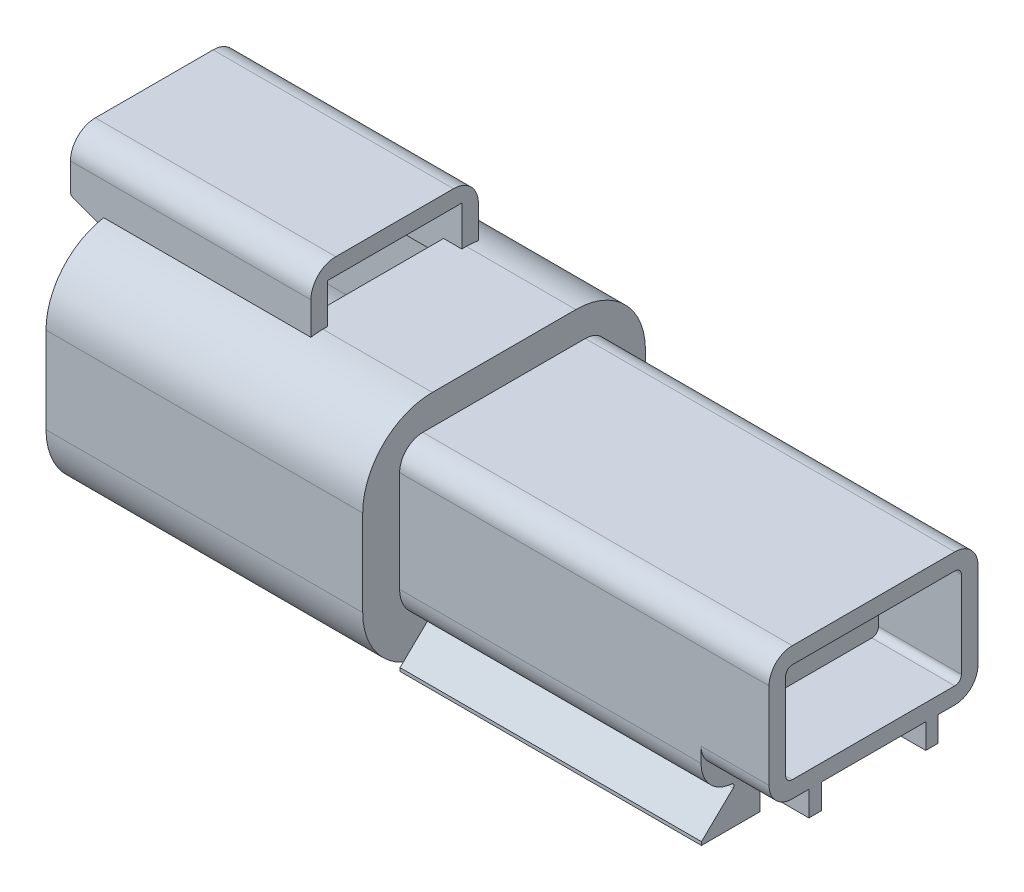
ISO-10303-21;
HEADER;
FILE_DESCRIPTION(('STEP AP214'),'2;1');
FILE_NAME('part.step','',(''),(''),'','','');
FILE_SCHEMA(('AUTOMOTIVE_DESIGN { 1 0 10303 214 1 1 1 1 }'));
ENDSEC;
DATA;
#1=APPLICATION_CONTEXT('core data for automotive mechanical design processes');
#2=APPLICATION_PROTOCOL_DEFINITION('international standard','automotive_design',2000,#1);
#3=PRODUCT_CONTEXT('',#1,'mechanical');
#4=PRODUCT('Part','Part','',(#3));
#5=PRODUCT_RELATED_PRODUCT_CATEGORY('part','',(#4));
#6=PRODUCT_DEFINITION_FORMATION('','',#4);
#7=PRODUCT_DEFINITION_CONTEXT('part definition',#1,'design');
#8=PRODUCT_DEFINITION('design','',#6,#7);
#9=PRODUCT_DEFINITION_SHAPE('','',#8);
#10=(LENGTH_UNIT() NAMED_UNIT(*) SI_UNIT(.MILLI.,.METRE.));
#11=(NAMED_UNIT(*) PLANE_ANGLE_UNIT() SI_UNIT($,.RADIAN.));
#12=(NAMED_UNIT(*) SI_UNIT($,.STERADIAN.) SOLID_ANGLE_UNIT());
#13=UNCERTAINTY_MEASURE_WITH_UNIT(LENGTH_MEASURE(1.E-05),#10,'distance_accuracy_value','');
#14=(GEOMETRIC_REPRESENTATION_CONTEXT(3) GLOBAL_UNCERTAINTY_ASSIGNED_CONTEXT((#13)) GLOBAL_UNIT_ASSIGNED_CONTEXT((#10,
#11,#12)) REPRESENTATION_CONTEXT('',''));
#15=CARTESIAN_POINT('',(0.,0.,0.));
#16=DIRECTION('',(0.,0.,1.));
#17=DIRECTION('',(1.,0.,0.));
#18=AXIS2_PLACEMENT_3D('',#15,#16,#17);
#19=CARTESIAN_POINT('',(50.,1.,-2.7));
#20=DIRECTION('',(-1.,0.,0.));
#21=DIRECTION('',(0.,1.,0.));
#22=AXIS2_PLACEMENT_3D('',#19,#20,#21);
#23=CYLINDRICAL_SURFACE('',#22,0.65);
#24=DIRECTION('',(-1.,0.,0.));
#25=VECTOR('',#24,1.);
#26=CARTESIAN_POINT('',(36.38,1.,-3.35));
#27=LINE('',#26,#25);
#28=CARTESIAN_POINT('',(36.38,1.,-3.35));
#29=VERTEX_POINT('',#28);
#30=CARTESIAN_POINT('',(17.9,1.,-3.35));
#31=VERTEX_POINT('',#30);
#32=EDGE_CURVE('E11',#29,#31,#27,.T.);
#33=ORIENTED_EDGE('',*,*,#32,.T.);
#34=CARTESIAN_POINT('',(17.9,1.,-2.7));
#35=DIRECTION('',(-1.,0.,0.));
#36=DIRECTION('',(0.,0.,-1.));
#37=AXIS2_PLACEMENT_3D('',#34,#35,#36);
#38=CIRCLE('',#37,0.65);
#39=CARTESIAN_POINT('',(17.9,1.,-2.05));
#40=VERTEX_POINT('',#39);
#41=EDGE_CURVE('E24',#31,#40,#38,.T.);
#42=ORIENTED_EDGE('',*,*,#41,.T.);
#43=DIRECTION('',(-1.,0.,0.));
#44=VECTOR('',#43,1.);
#45=CARTESIAN_POINT('',(36.38,1.,-2.05));
#46=LINE('',#45,#44);
#47=CARTESIAN_POINT('',(36.38,1.,-2.05));
#48=VERTEX_POINT('',#47);
#49=EDGE_CURVE('E1510',#48,#40,#46,.T.);
#50=ORIENTED_EDGE('',*,*,#49,.F.);
#51=CARTESIAN_POINT('',(36.38,1.,-2.7));
#52=DIRECTION('',(1.,0.,0.));
#53=DIRECTION('',(0.,0.,-1.));
#54=AXIS2_PLACEMENT_3D('',#51,#52,#53);
#55=CIRCLE('',#54,0.65);
#56=EDGE_CURVE('E1463',#48,#29,#55,.T.);
#57=ORIENTED_EDGE('',*,*,#56,.T.);
#58=EDGE_LOOP('',(#33,#42,#50,#57));
#59=FACE_BOUND('',#58,.T.);
#60=ADVANCED_FACE('F16',(#59),#23,.F.);
#61=CARTESIAN_POINT('',(36.38,3.59999999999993,4.89999999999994));
#62=DIRECTION('',(1.,0.,0.));
#63=DIRECTION('',(0.,0.,-1.));
#64=AXIS2_PLACEMENT_3D('',#61,#62,#63);
#65=PLANE('',#64);
#66=ORIENTED_EDGE('',*,*,#56,.F.);
#67=CARTESIAN_POINT('',(36.38,1.,-2.7));
#68=DIRECTION('',(1.,0.,0.));
#69=DIRECTION('',(0.,0.,-1.));
#70=AXIS2_PLACEMENT_3D('',#67,#68,#69);
#71=CIRCLE('',#70,0.65);
#72=EDGE_CURVE('E1502',#29,#48,#71,.T.);
#73=ORIENTED_EDGE('',*,*,#72,.F.);
#74=EDGE_LOOP('',(#66,#73));
#75=FACE_BOUND('',#74,.T.);
#76=CARTESIAN_POINT('',(36.38,1.,2.7));
#77=DIRECTION('',(1.,0.,0.));
#78=DIRECTION('',(0.,0.,-1.));
#79=AXIS2_PLACEMENT_3D('',#76,#77,#78);
#80=CIRCLE('',#79,0.65);
#81=CARTESIAN_POINT('',(36.38,1.,3.35));
#82=VERTEX_POINT('',#81);
#83=CARTESIAN_POINT('',(36.38,1.,2.05));
#84=VERTEX_POINT('',#83);
#85=EDGE_CURVE('E577',#82,#84,#80,.T.);
#86=ORIENTED_EDGE('',*,*,#85,.F.);
#87=CARTESIAN_POINT('',(36.38,1.,2.7));
#88=DIRECTION('',(1.,0.,0.));
#89=DIRECTION('',(0.,0.,-1.));
#90=AXIS2_PLACEMENT_3D('',#87,#88,#89);
#91=CIRCLE('',#90,0.65);
#92=EDGE_CURVE('E1475',#84,#82,#91,.T.);
#93=ORIENTED_EDGE('',*,*,#92,.F.);
#94=EDGE_LOOP('',(#86,#93));
#95=FACE_BOUND('',#94,.T.);
#96=CARTESIAN_POINT('',(36.38,3.59999999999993,4.89999999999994));
#97=DIRECTION('',(1.,0.,0.));
#98=DIRECTION('',(0.,0.,-1.));
#99=AXIS2_PLACEMENT_3D('',#96,#97,#98);
#100=CIRCLE('',#99,0.400000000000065);
#101=CARTESIAN_POINT('',(36.38,4.,4.9));
#102=VERTEX_POINT('',#101);
#103=CARTESIAN_POINT('',(36.38,3.6,5.3));
#104=VERTEX_POINT('',#103);
#105=EDGE_CURVE('E1466',#102,#104,#100,.T.);
#106=ORIENTED_EDGE('',*,*,#105,.T.);
#107=DIRECTION('',(0.,-1.,0.));
#108=VECTOR('',#107,1.);
#109=CARTESIAN_POINT('',(36.38,3.6,5.3));
#110=LINE('',#109,#108);
#111=CARTESIAN_POINT('',(36.38,-1.6,5.3));
#112=VERTEX_POINT('',#111);
#113=EDGE_CURVE('E1469',#104,#112,#110,.T.);
#114=ORIENTED_EDGE('',*,*,#113,.T.);
#115=CARTESIAN_POINT('',(36.38,-1.59999999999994,4.89999999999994));
#116=DIRECTION('',(1.,0.,0.));
#117=DIRECTION('',(0.,0.,-1.));
#118=AXIS2_PLACEMENT_3D('',#115,#116,#117);
#119=CIRCLE('',#118,0.400000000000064);
#120=CARTESIAN_POINT('',(36.38,-2.,4.9));
#121=VERTEX_POINT('',#120);
#122=EDGE_CURVE('E1487',#112,#121,#119,.T.);
#123=ORIENTED_EDGE('',*,*,#122,.T.);
#124=DIRECTION('',(0.,0.,-1.));
#125=VECTOR('',#124,1.);
#126=CARTESIAN_POINT('',(36.38,-2.,4.9));
#127=LINE('',#126,#125);
#128=CARTESIAN_POINT('',(36.38,-2.,-4.9));
#129=VERTEX_POINT('',#128);
#130=EDGE_CURVE('E1489',#121,#129,#127,.T.);
#131=ORIENTED_EDGE('',*,*,#130,.T.);
#132=CARTESIAN_POINT('',(36.38,-1.59999999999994,-4.89999999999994));
#133=DIRECTION('',(1.,0.,0.));
#134=DIRECTION('',(0.,0.,-1.));
#135=AXIS2_PLACEMENT_3D('',#132,#133,#134);
#136=CIRCLE('',#135,0.400000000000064);
#137=CARTESIAN_POINT('',(36.38,-1.6,-5.3));
#138=VERTEX_POINT('',#137);
#139=EDGE_CURVE('E2121',#129,#138,#136,.T.);
#140=ORIENTED_EDGE('',*,*,#139,.T.);
#141=DIRECTION('',(0.,1.,0.));
#142=VECTOR('',#141,1.);
#143=CARTESIAN_POINT('',(36.38,-1.6,-5.3));
#144=LINE('',#143,#142);
#145=CARTESIAN_POINT('',(36.38,3.6,-5.3));
#146=VERTEX_POINT('',#145);
#147=EDGE_CURVE('E2117',#138,#146,#144,.T.);
#148=ORIENTED_EDGE('',*,*,#147,.T.);
#149=CARTESIAN_POINT('',(36.38,3.59999999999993,-4.89999999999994));
#150=DIRECTION('',(1.,0.,0.));
#151=DIRECTION('',(0.,0.,-1.));
#152=AXIS2_PLACEMENT_3D('',#149,#150,#151);
#153=CIRCLE('',#152,0.400000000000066);
#154=CARTESIAN_POINT('',(36.38,4.,-4.9));
#155=VERTEX_POINT('',#154);
#156=EDGE_CURVE('E2113',#146,#155,#153,.T.);
#157=ORIENTED_EDGE('',*,*,#156,.T.);
#158=DIRECTION('',(0.,0.,1.));
#159=VECTOR('',#158,1.);
#160=CARTESIAN_POINT('',(36.38,4.,-4.9));
#161=LINE('',#160,#159);
#162=EDGE_CURVE('E1472',#155,#102,#161,.T.);
#163=ORIENTED_EDGE('',*,*,#162,.T.);
#164=EDGE_LOOP('',(#106,#114,#123,#131,#140,#148,#157,#163));
#165=FACE_BOUND('',#164,.T.);
#166=ADVANCED_FACE('F1452',(#75,#95,#165),#65,.T.);
#167=CARTESIAN_POINT('',(36.38,4.,-4.9));
#168=DIRECTION('',(0.,1.,0.));
#169=DIRECTION('',(0.,0.,1.));
#170=AXIS2_PLACEMENT_3D('',#167,#168,#169);
#171=PLANE('',#170);
#172=DIRECTION('',(0.,0.,1.));
#173=VECTOR('',#172,1.);
#174=CARTESIAN_POINT('',(41.38,4.,-4.9));
#175=LINE('',#174,#173);
#176=CARTESIAN_POINT('',(41.38,4.,-4.9));
#177=VERTEX_POINT('',#176);
#178=CARTESIAN_POINT('',(41.38,4.,4.9));
#179=VERTEX_POINT('',#178);
#180=EDGE_CURVE('E2106',#177,#179,#175,.T.);
#181=ORIENTED_EDGE('',*,*,#180,.T.);
#182=DIRECTION('',(1.,0.,0.));
#183=VECTOR('',#182,1.);
#184=CARTESIAN_POINT('',(36.38,4.,4.9));
#185=LINE('',#184,#183);
#186=EDGE_CURVE('E2102',#102,#179,#185,.T.);
#187=ORIENTED_EDGE('',*,*,#186,.F.);
#188=ORIENTED_EDGE('',*,*,#162,.F.);
#189=DIRECTION('',(1.,0.,0.));
#190=VECTOR('',#189,1.);
#191=CARTESIAN_POINT('',(36.38,4.,-4.9));
#192=LINE('',#191,#190);
#193=EDGE_CURVE('E2098',#155,#177,#192,.T.);
#194=ORIENTED_EDGE('',*,*,#193,.T.);
#195=EDGE_LOOP('',(#181,#187,#188,#194));
#196=FACE_BOUND('',#195,.T.);
#197=ADVANCED_FACE('F1449',(#196),#171,.F.);
#198=CARTESIAN_POINT('',(36.38,3.59999999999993,-4.89999999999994));
#199=DIRECTION('',(1.,0.,0.));
#200=DIRECTION('',(0.,-0.707106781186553,0.707106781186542));
#201=AXIS2_PLACEMENT_3D('',#198,#199,#200);
#202=CYLINDRICAL_SURFACE('',#201,0.400000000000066);
#203=CARTESIAN_POINT('',(41.38,3.59999999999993,-4.89999999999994));
#204=DIRECTION('',(1.,0.,0.));
#205=DIRECTION('',(0.,0.,-1.));
#206=AXIS2_PLACEMENT_3D('',#203,#204,#205);
#207=CIRCLE('',#206,0.400000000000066);
#208=CARTESIAN_POINT('',(41.38,3.6,-5.3));
#209=VERTEX_POINT('',#208);
#210=EDGE_CURVE('E2093',#209,#177,#207,.T.);
#211=ORIENTED_EDGE('',*,*,#210,.T.);
#212=ORIENTED_EDGE('',*,*,#193,.F.);
#213=ORIENTED_EDGE('',*,*,#156,.F.);
#214=DIRECTION('',(1.,0.,0.));
#215=VECTOR('',#214,1.);
#216=CARTESIAN_POINT('',(36.38,3.6,-5.3));
#217=LINE('',#216,#215);
#218=EDGE_CURVE('E2089',#146,#209,#217,.T.);
#219=ORIENTED_EDGE('',*,*,#218,.T.);
#220=EDGE_LOOP('',(#211,#212,#213,#219));
#221=FACE_BOUND('',#220,.T.);
#222=ADVANCED_FACE('F1445',(#221),#202,.F.);
#223=CARTESIAN_POINT('',(36.38,-1.6,-5.3));
#224=DIRECTION('',(0.,0.,-1.));
#225=DIRECTION('',(-1.,0.,0.));
#226=AXIS2_PLACEMENT_3D('',#223,#224,#225);
#227=PLANE('',#226);
#228=DIRECTION('',(0.,1.,0.));
#229=VECTOR('',#228,1.);
#230=CARTESIAN_POINT('',(41.38,-1.6,-5.3));
#231=LINE('',#230,#229);
#232=CARTESIAN_POINT('',(41.38,-1.6,-5.3));
#233=VERTEX_POINT('',#232);
#234=EDGE_CURVE('E2084',#233,#209,#231,.T.);
#235=ORIENTED_EDGE('',*,*,#234,.T.);
#236=ORIENTED_EDGE('',*,*,#218,.F.);
#237=ORIENTED_EDGE('',*,*,#147,.F.);
#238=DIRECTION('',(1.,0.,0.));
#239=VECTOR('',#238,1.);
#240=CARTESIAN_POINT('',(36.38,-1.6,-5.3));
#241=LINE('',#240,#239);
#242=EDGE_CURVE('E2080',#138,#233,#241,.T.);
#243=ORIENTED_EDGE('',*,*,#242,.T.);
#244=EDGE_LOOP('',(#235,#236,#237,#243));
#245=FACE_BOUND('',#244,.T.);
#246=ADVANCED_FACE('F1441',(#245),#227,.F.);
#247=CARTESIAN_POINT('',(36.38,-1.59999999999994,-4.89999999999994));
#248=DIRECTION('',(1.,0.,0.));
#249=DIRECTION('',(0.,0.707106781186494,0.707106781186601));
#250=AXIS2_PLACEMENT_3D('',#247,#248,#249);
#251=CYLINDRICAL_SURFACE('',#250,0.400000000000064);
#252=CARTESIAN_POINT('',(41.38,-1.59999999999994,-4.89999999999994));
#253=DIRECTION('',(1.,0.,0.));
#254=DIRECTION('',(0.,0.,-1.));
#255=AXIS2_PLACEMENT_3D('',#252,#253,#254);
#256=CIRCLE('',#255,0.400000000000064);
#257=CARTESIAN_POINT('',(41.38,-2.,-4.9));
#258=VERTEX_POINT('',#257);
#259=EDGE_CURVE('E2075',#258,#233,#256,.T.);
#260=ORIENTED_EDGE('',*,*,#259,.T.);
#261=ORIENTED_EDGE('',*,*,#242,.F.);
#262=ORIENTED_EDGE('',*,*,#139,.F.);
#263=DIRECTION('',(1.,0.,0.));
#264=VECTOR('',#263,1.);
#265=CARTESIAN_POINT('',(36.38,-2.,-4.9));
#266=LINE('',#265,#264);
#267=EDGE_CURVE('E2071',#129,#258,#266,.T.);
#268=ORIENTED_EDGE('',*,*,#267,.T.);
#269=EDGE_LOOP('',(#260,#261,#262,#268));
#270=FACE_BOUND('',#269,.T.);
#271=ADVANCED_FACE('F1437',(#270),#251,.F.);
#272=CARTESIAN_POINT('',(36.38,-2.,4.9));
#273=DIRECTION('',(0.,-1.,0.));
#274=DIRECTION('',(0.,0.,-1.));
#275=AXIS2_PLACEMENT_3D('',#272,#273,#274);
#276=PLANE('',#275);
#277=DIRECTION('',(0.,0.,-1.));
#278=VECTOR('',#277,1.);
#279=CARTESIAN_POINT('',(41.38,-2.,4.9));
#280=LINE('',#279,#278);
#281=CARTESIAN_POINT('',(41.38,-2.,4.9));
#282=VERTEX_POINT('',#281);
#283=EDGE_CURVE('E2066',#282,#258,#280,.T.);
#284=ORIENTED_EDGE('',*,*,#283,.T.);
#285=ORIENTED_EDGE('',*,*,#267,.F.);
#286=ORIENTED_EDGE('',*,*,#130,.F.);
#287=DIRECTION('',(1.,0.,0.));
#288=VECTOR('',#287,1.);
#289=CARTESIAN_POINT('',(36.38,-2.,4.9));
#290=LINE('',#289,#288);
#291=EDGE_CURVE('E2062',#121,#282,#290,.T.);
#292=ORIENTED_EDGE('',*,*,#291,.T.);
#293=EDGE_LOOP('',(#284,#285,#286,#292));
#294=FACE_BOUND('',#293,.T.);
#295=ADVANCED_FACE('F1433',(#294),#276,.F.);
#296=CARTESIAN_POINT('',(36.38,-1.59999999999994,4.89999999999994));
#297=DIRECTION('',(1.,0.,0.));
#298=DIRECTION('',(0.,0.707106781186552,-0.707106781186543));
#299=AXIS2_PLACEMENT_3D('',#296,#297,#298);
#300=CYLINDRICAL_SURFACE('',#299,0.400000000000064);
#301=CARTESIAN_POINT('',(41.38,-1.59999999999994,4.89999999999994));
#302=DIRECTION('',(1.,0.,0.));
#303=DIRECTION('',(0.,0.,-1.));
#304=AXIS2_PLACEMENT_3D('',#301,#302,#303);
#305=CIRCLE('',#304,0.400000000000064);
#306=CARTESIAN_POINT('',(41.38,-1.6,5.3));
#307=VERTEX_POINT('',#306);
#308=EDGE_CURVE('E2057',#307,#282,#305,.T.);
#309=ORIENTED_EDGE('',*,*,#308,.T.);
#310=ORIENTED_EDGE('',*,*,#291,.F.);
#311=ORIENTED_EDGE('',*,*,#122,.F.);
#312=DIRECTION('',(1.,0.,0.));
#313=VECTOR('',#312,1.);
#314=CARTESIAN_POINT('',(36.38,-1.6,5.3));
#315=LINE('',#314,#313);
#316=EDGE_CURVE('E1485',#112,#307,#315,.T.);
#317=ORIENTED_EDGE('',*,*,#316,.T.);
#318=EDGE_LOOP('',(#309,#310,#311,#317));
#319=FACE_BOUND('',#318,.T.);
#320=ADVANCED_FACE('F1429',(#319),#300,.F.);
#321=CARTESIAN_POINT('',(36.38,3.6,5.3));
#322=DIRECTION('',(0.,0.,1.));
#323=DIRECTION('',(1.,0.,0.));
#324=AXIS2_PLACEMENT_3D('',#321,#322,#323);
#325=PLANE('',#324);
#326=DIRECTION('',(0.,-1.,0.));
#327=VECTOR('',#326,1.);
#328=CARTESIAN_POINT('',(41.38,3.6,5.3));
#329=LINE('',#328,#327);
#330=CARTESIAN_POINT('',(41.38,3.6,5.3));
#331=VERTEX_POINT('',#330);
#332=EDGE_CURVE('E1483',#331,#307,#329,.T.);
#333=ORIENTED_EDGE('',*,*,#332,.T.);
#334=ORIENTED_EDGE('',*,*,#316,.F.);
#335=ORIENTED_EDGE('',*,*,#113,.F.);
#336=DIRECTION('',(1.,0.,0.));
#337=VECTOR('',#336,1.);
#338=CARTESIAN_POINT('',(36.38,3.6,5.3));
#339=LINE('',#338,#337);
#340=EDGE_CURVE('E1478',#104,#331,#339,.T.);
#341=ORIENTED_EDGE('',*,*,#340,.T.);
#342=EDGE_LOOP('',(#333,#334,#335,#341));
#343=FACE_BOUND('',#342,.T.);
#344=ADVANCED_FACE('F1425',(#343),#325,.F.);
#345=CARTESIAN_POINT('',(36.38,3.59999999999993,4.89999999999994));
#346=DIRECTION('',(1.,0.,0.));
#347=DIRECTION('',(0.,-0.707106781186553,-0.707106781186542));
#348=AXIS2_PLACEMENT_3D('',#345,#346,#347);
#349=CYLINDRICAL_SURFACE('',#348,0.400000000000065);
#350=CARTESIAN_POINT('',(41.38,3.59999999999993,4.89999999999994));
#351=DIRECTION('',(1.,0.,0.));
#352=DIRECTION('',(0.,0.,-1.));
#353=AXIS2_PLACEMENT_3D('',#350,#351,#352);
#354=CIRCLE('',#353,0.400000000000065);
#355=EDGE_CURVE('E1480',#179,#331,#354,.T.);
#356=ORIENTED_EDGE('',*,*,#355,.T.);
#357=ORIENTED_EDGE('',*,*,#340,.F.);
#358=ORIENTED_EDGE('',*,*,#105,.F.);
#359=ORIENTED_EDGE('',*,*,#186,.T.);
#360=EDGE_LOOP('',(#356,#357,#358,#359));
#361=FACE_BOUND('',#360,.T.);
#362=ADVANCED_FACE('F1421',(#361),#349,.F.);
#363=CARTESIAN_POINT('',(41.38,3.60000000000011,4.90000000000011));
#364=DIRECTION('',(1.,0.,0.));
#365=DIRECTION('',(0.,0.,-1.));
#366=AXIS2_PLACEMENT_3D('',#363,#364,#365);
#367=PLANE('',#366);
#368=ORIENTED_EDGE('',*,*,#355,.F.);
#369=ORIENTED_EDGE('',*,*,#180,.F.);
#370=ORIENTED_EDGE('',*,*,#210,.F.);
#371=ORIENTED_EDGE('',*,*,#234,.F.);
#372=ORIENTED_EDGE('',*,*,#259,.F.);
#373=ORIENTED_EDGE('',*,*,#283,.F.);
#374=ORIENTED_EDGE('',*,*,#308,.F.);
#375=ORIENTED_EDGE('',*,*,#332,.F.);
#376=EDGE_LOOP('',(#368,#369,#370,#371,#372,#373,#374,#375));
#377=FACE_BOUND('',#376,.T.);
#378=CARTESIAN_POINT('',(41.38,3.60000000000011,4.90000000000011));
#379=DIRECTION('',(1.,0.,0.));
#380=DIRECTION('',(0.,0.,-1.));
#381=AXIS2_PLACEMENT_3D('',#378,#379,#380);
#382=CIRCLE('',#381,1.39999999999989);
#383=CARTESIAN_POINT('',(41.38,5.,4.9));
#384=VERTEX_POINT('',#383);
#385=CARTESIAN_POINT('',(41.38,3.6,6.3));
#386=VERTEX_POINT('',#385);
#387=EDGE_CURVE('E2042',#384,#386,#382,.T.);
#388=ORIENTED_EDGE('',*,*,#387,.T.);
#389=DIRECTION('',(0.,-1.,0.));
#390=VECTOR('',#389,1.);
#391=CARTESIAN_POINT('',(41.38,3.6,6.3));
#392=LINE('',#391,#390);
#393=CARTESIAN_POINT('',(41.38,-1.6,6.3));
#394=VERTEX_POINT('',#393);
#395=EDGE_CURVE('E2038',#386,#394,#392,.T.);
#396=ORIENTED_EDGE('',*,*,#395,.T.);
#397=CARTESIAN_POINT('',(41.38,-1.60000000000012,4.90000000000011));
#398=DIRECTION('',(1.,0.,0.));
#399=DIRECTION('',(0.,0.,-1.));
#400=AXIS2_PLACEMENT_3D('',#397,#398,#399);
#401=CIRCLE('',#400,1.39999999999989);
#402=CARTESIAN_POINT('',(41.38,-3.,4.9));
#403=VERTEX_POINT('',#402);
#404=EDGE_CURVE('E2034',#394,#403,#401,.T.);
#405=ORIENTED_EDGE('',*,*,#404,.T.);
#406=DIRECTION('',(0.,0.,-1.));
#407=VECTOR('',#406,1.);
#408=CARTESIAN_POINT('',(41.38,-3.,4.9));
#409=LINE('',#408,#407);
#410=CARTESIAN_POINT('',(41.38,-3.,3.9));
#411=VERTEX_POINT('',#410);
#412=EDGE_CURVE('E2030',#403,#411,#409,.T.);
#413=ORIENTED_EDGE('',*,*,#412,.T.);
#414=DIRECTION('',(0.,-1.,0.));
#415=VECTOR('',#414,1.);
#416=CARTESIAN_POINT('',(41.38,-3.,3.9));
#417=LINE('',#416,#415);
#418=CARTESIAN_POINT('',(41.38,-4.5,3.9));
#419=VERTEX_POINT('',#418);
#420=EDGE_CURVE('E2026',#411,#419,#417,.T.);
#421=ORIENTED_EDGE('',*,*,#420,.T.);
#422=DIRECTION('',(0.,0.,-1.));
#423=VECTOR('',#422,1.);
#424=CARTESIAN_POINT('',(41.38,-4.5,3.9));
#425=LINE('',#424,#423);
#426=CARTESIAN_POINT('',(41.38,-4.5,3.15));
#427=VERTEX_POINT('',#426);
#428=EDGE_CURVE('E2022',#419,#427,#425,.T.);
#429=ORIENTED_EDGE('',*,*,#428,.T.);
#430=DIRECTION('',(0.,1.,0.));
#431=VECTOR('',#430,1.);
#432=CARTESIAN_POINT('',(41.38,-4.5,3.15));
#433=LINE('',#432,#431);
#434=CARTESIAN_POINT('',(41.38,-3.,3.15));
#435=VERTEX_POINT('',#434);
#436=EDGE_CURVE('E2018',#427,#435,#433,.T.);
#437=ORIENTED_EDGE('',*,*,#436,.T.);
#438=DIRECTION('',(0.,0.,-1.));
#439=VECTOR('',#438,1.);
#440=CARTESIAN_POINT('',(41.38,-3.,3.15));
#441=LINE('',#440,#439);
#442=CARTESIAN_POINT('',(41.38,-3.,-3.15));
#443=VERTEX_POINT('',#442);
#444=EDGE_CURVE('E2014',#435,#443,#441,.T.);
#445=ORIENTED_EDGE('',*,*,#444,.T.);
#446=DIRECTION('',(0.,-1.,0.));
#447=VECTOR('',#446,1.);
#448=CARTESIAN_POINT('',(41.38,-3.,-3.15));
#449=LINE('',#448,#447);
#450=CARTESIAN_POINT('',(41.38,-4.5,-3.15));
#451=VERTEX_POINT('',#450);
#452=EDGE_CURVE('E2010',#443,#451,#449,.T.);
#453=ORIENTED_EDGE('',*,*,#452,.T.);
#454=DIRECTION('',(0.,0.,-1.));
#455=VECTOR('',#454,1.);
#456=CARTESIAN_POINT('',(41.38,-4.5,-3.15));
#457=LINE('',#456,#455);
#458=CARTESIAN_POINT('',(41.38,-4.5,-3.9));
#459=VERTEX_POINT('',#458);
#460=EDGE_CURVE('E2006',#451,#459,#457,.T.);
#461=ORIENTED_EDGE('',*,*,#460,.T.);
#462=DIRECTION('',(0.,1.,0.));
#463=VECTOR('',#462,1.);
#464=CARTESIAN_POINT('',(41.38,-4.5,-3.9));
#465=LINE('',#464,#463);
#466=CARTESIAN_POINT('',(41.38,-3.,-3.9));
#467=VERTEX_POINT('',#466);
#468=EDGE_CURVE('E2002',#459,#467,#465,.T.);
#469=ORIENTED_EDGE('',*,*,#468,.T.);
#470=DIRECTION('',(0.,0.,-1.));
#471=VECTOR('',#470,1.);
#472=CARTESIAN_POINT('',(41.38,-3.,-3.9));
#473=LINE('',#472,#471);
#474=CARTESIAN_POINT('',(41.38,-3.,-4.9));
#475=VERTEX_POINT('',#474);
#476=EDGE_CURVE('E1998',#467,#475,#473,.T.);
#477=ORIENTED_EDGE('',*,*,#476,.T.);
#478=CARTESIAN_POINT('',(41.38,-1.60000000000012,-4.90000000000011));
#479=DIRECTION('',(1.,0.,0.));
#480=DIRECTION('',(0.,0.,-1.));
#481=AXIS2_PLACEMENT_3D('',#478,#479,#480);
#482=CIRCLE('',#481,1.39999999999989);
#483=CARTESIAN_POINT('',(41.38,-1.6,-6.3));
#484=VERTEX_POINT('',#483);
#485=EDGE_CURVE('E1994',#475,#484,#482,.T.);
#486=ORIENTED_EDGE('',*,*,#485,.T.);
#487=DIRECTION('',(0.,1.,0.));
#488=VECTOR('',#487,1.);
#489=CARTESIAN_POINT('',(41.38,-1.6,-6.3));
#490=LINE('',#489,#488);
#491=CARTESIAN_POINT('',(41.38,3.6,-6.3));
#492=VERTEX_POINT('',#491);
#493=EDGE_CURVE('E1990',#484,#492,#490,.T.);
#494=ORIENTED_EDGE('',*,*,#493,.T.);
#495=CARTESIAN_POINT('',(41.38,3.60000000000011,-4.90000000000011));
#496=DIRECTION('',(1.,0.,0.));
#497=DIRECTION('',(0.,0.,-1.));
#498=AXIS2_PLACEMENT_3D('',#495,#496,#497);
#499=CIRCLE('',#498,1.39999999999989);
#500=CARTESIAN_POINT('',(41.38,5.,-4.9));
#501=VERTEX_POINT('',#500);
#502=EDGE_CURVE('E1986',#492,#501,#499,.T.);
#503=ORIENTED_EDGE('',*,*,#502,.T.);
#504=DIRECTION('',(0.,0.,1.));
#505=VECTOR('',#504,1.);
#506=CARTESIAN_POINT('',(41.38,5.,-4.9));
#507=LINE('',#506,#505);
#508=EDGE_CURVE('E1982',#501,#384,#507,.T.);
#509=ORIENTED_EDGE('',*,*,#508,.T.);
#510=EDGE_LOOP('',(#388,#396,#405,#413,#421,#429,#437,#445,#453,#461,#469,#477,#486,#494,#503,#509));
#511=FACE_BOUND('',#510,.T.);
#512=ADVANCED_FACE('F1417',(#377,#511),#367,.T.);
#513=CARTESIAN_POINT('',(37.28,5.,-4.9));
#514=DIRECTION('',(0.,-1.,0.));
#515=DIRECTION('',(0.,0.,-1.));
#516=AXIS2_PLACEMENT_3D('',#513,#514,#515);
#517=PLANE('',#516);
#518=DIRECTION('',(0.,0.,1.));
#519=VECTOR('',#518,1.);
#520=CARTESIAN_POINT('',(19.1,5.,-4.9));
#521=LINE('',#520,#519);
#522=CARTESIAN_POINT('',(19.1,5.,-4.9));
#523=VERTEX_POINT('',#522);
#524=CARTESIAN_POINT('',(19.1,5.,4.9));
#525=VERTEX_POINT('',#524);
#526=EDGE_CURVE('E1978',#523,#525,#521,.T.);
#527=ORIENTED_EDGE('',*,*,#526,.T.);
#528=DIRECTION('',(-1.,0.,0.));
#529=VECTOR('',#528,1.);
#530=CARTESIAN_POINT('',(37.28,5.,4.9));
#531=LINE('',#530,#529);
#532=EDGE_CURVE('E1973',#384,#525,#531,.T.);
#533=ORIENTED_EDGE('',*,*,#532,.F.);
#534=ORIENTED_EDGE('',*,*,#508,.F.);
#535=DIRECTION('',(-1.,0.,0.));
#536=VECTOR('',#535,1.);
#537=CARTESIAN_POINT('',(37.28,5.,-4.9));
#538=LINE('',#537,#536);
#539=EDGE_CURVE('E1969',#501,#523,#538,.T.);
#540=ORIENTED_EDGE('',*,*,#539,.T.);
#541=EDGE_LOOP('',(#527,#533,#534,#540));
#542=FACE_BOUND('',#541,.T.);
#543=ADVANCED_FACE('F1413',(#542),#517,.F.);
#544=CARTESIAN_POINT('',(37.28,3.60000000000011,-4.90000000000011));
#545=DIRECTION('',(-1.,0.,0.));
#546=DIRECTION('',(0.,-0.707106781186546,0.707106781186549));
#547=AXIS2_PLACEMENT_3D('',#544,#545,#546);
#548=CYLINDRICAL_SURFACE('',#547,1.39999999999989);
#549=CARTESIAN_POINT('',(19.1,3.60000000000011,-4.90000000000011));
#550=DIRECTION('',(1.,0.,0.));
#551=DIRECTION('',(0.,0.,-1.));
#552=AXIS2_PLACEMENT_3D('',#549,#550,#551);
#553=CIRCLE('',#552,1.39999999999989);
#554=CARTESIAN_POINT('',(19.1,3.6,-6.3));
#555=VERTEX_POINT('',#554);
#556=EDGE_CURVE('E1964',#555,#523,#553,.T.);
#557=ORIENTED_EDGE('',*,*,#556,.T.);
#558=ORIENTED_EDGE('',*,*,#539,.F.);
#559=ORIENTED_EDGE('',*,*,#502,.F.);
#560=DIRECTION('',(-1.,0.,0.));
#561=VECTOR('',#560,1.);
#562=CARTESIAN_POINT('',(37.28,3.6,-6.3));
#563=LINE('',#562,#561);
#564=EDGE_CURVE('E1960',#492,#555,#563,.T.);
#565=ORIENTED_EDGE('',*,*,#564,.T.);
#566=EDGE_LOOP('',(#557,#558,#559,#565));
#567=FACE_BOUND('',#566,.T.);
#568=ADVANCED_FACE('F1409',(#567),#548,.T.);
#569=CARTESIAN_POINT('',(37.28,-2.5,-6.3));
#570=DIRECTION('',(0.,0.,1.));
#571=DIRECTION('',(1.,0.,0.));
#572=AXIS2_PLACEMENT_3D('',#569,#570,#571);
#573=PLANE('',#572);
#574=DIRECTION('',(0.,1.,0.));
#575=VECTOR('',#574,1.);
#576=CARTESIAN_POINT('',(19.1,-2.5,-6.3));
#577=LINE('',#576,#575);
#578=CARTESIAN_POINT('',(19.1,-2.5,-6.3));
#579=VERTEX_POINT('',#578);
#580=EDGE_CURVE('E1955',#579,#555,#577,.T.);
#581=ORIENTED_EDGE('',*,*,#580,.T.);
#582=ORIENTED_EDGE('',*,*,#564,.F.);
#583=ORIENTED_EDGE('',*,*,#493,.F.);
#584=DIRECTION('',(-1.,0.,0.));
#585=VECTOR('',#584,1.);
#586=CARTESIAN_POINT('',(41.38,-1.6,-6.3));
#587=LINE('',#586,#585);
#588=CARTESIAN_POINT('',(37.28,-1.60000000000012,-6.3));
#589=VERTEX_POINT('',#588);
#590=EDGE_CURVE('E1951',#484,#589,#587,.T.);
#591=ORIENTED_EDGE('',*,*,#590,.T.);
#592=DIRECTION('',(0.,1.,0.));
#593=VECTOR('',#592,1.);
#594=CARTESIAN_POINT('',(37.28,-2.5,-6.3));
#595=LINE('',#594,#593);
#596=CARTESIAN_POINT('',(37.28,-2.5,-6.3));
#597=VERTEX_POINT('',#596);
#598=EDGE_CURVE('E1946',#597,#589,#595,.T.);
#599=ORIENTED_EDGE('',*,*,#598,.F.);
#600=DIRECTION('',(-1.,0.,0.));
#601=VECTOR('',#600,1.);
#602=CARTESIAN_POINT('',(37.28,-2.5,-6.3));
#603=LINE('',#602,#601);
#604=EDGE_CURVE('E1942',#597,#579,#603,.T.);
#605=ORIENTED_EDGE('',*,*,#604,.T.);
#606=EDGE_LOOP('',(#581,#582,#583,#591,#599,#605));
#607=FACE_BOUND('',#606,.T.);
#608=ADVANCED_FACE('F1405',(#607),#573,.F.);
#609=CARTESIAN_POINT('',(37.28,-2.50000000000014,-4.3000000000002));
#610=DIRECTION('',(-1.,0.,0.));
#611=DIRECTION('',(0.,0.679418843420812,0.73375066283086));
#612=AXIS2_PLACEMENT_3D('',#609,#610,#611);
#613=CYLINDRICAL_SURFACE('',#612,1.9999999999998);
#614=CARTESIAN_POINT('',(19.1,-2.50000000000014,-4.3000000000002));
#615=DIRECTION('',(1.,0.,0.));
#616=DIRECTION('',(0.,0.,-1.));
#617=AXIS2_PLACEMENT_3D('',#614,#615,#616);
#618=CIRCLE('',#617,1.9999999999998);
#619=CARTESIAN_POINT('',(19.1,-4.4940961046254,-4.4535601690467));
#620=VERTEX_POINT('',#619);
#621=EDGE_CURVE('E1937',#620,#579,#618,.T.);
#622=ORIENTED_EDGE('',*,*,#621,.T.);
#623=ORIENTED_EDGE('',*,*,#604,.F.);
#624=CARTESIAN_POINT('',(37.28,-2.50000000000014,-4.3000000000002));
#625=DIRECTION('',(1.,0.,0.));
#626=DIRECTION('',(0.,0.,-1.));
#627=AXIS2_PLACEMENT_3D('',#624,#625,#626);
#628=CIRCLE('',#627,1.9999999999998);
#629=CARTESIAN_POINT('',(37.28,-4.4940961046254,-4.4535601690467));
#630=VERTEX_POINT('',#629);
#631=EDGE_CURVE('E1932',#630,#597,#628,.T.);
#632=ORIENTED_EDGE('',*,*,#631,.F.);
#633=DIRECTION('',(-1.,0.,0.));
#634=VECTOR('',#633,1.);
#635=CARTESIAN_POINT('',(37.28,-4.4940961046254,-4.4535601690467));
#636=LINE('',#635,#634);
#637=EDGE_CURVE('E1928',#630,#620,#636,.T.);
#638=ORIENTED_EDGE('',*,*,#637,.T.);
#639=EDGE_LOOP('',(#622,#623,#632,#638));
#640=FACE_BOUND('',#639,.T.);
#641=ADVANCED_FACE('F1401',(#640),#613,.T.);
#642=CARTESIAN_POINT('',(37.28,-4.64365331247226,-4.46507718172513));
#643=DIRECTION('',(-1.,0.,0.));
#644=DIRECTION('',(0.,-0.338709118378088,-0.9408911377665));
#645=AXIS2_PLACEMENT_3D('',#642,#643,#644);
#646=CYLINDRICAL_SURFACE('',#645,0.149999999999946);
#647=CARTESIAN_POINT('',(19.1,-4.64365331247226,-4.46507718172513));
#648=DIRECTION('',(1.,0.,0.));
#649=DIRECTION('',(0.,0.,-1.));
#650=AXIS2_PLACEMENT_3D('',#647,#648,#649);
#651=CIRCLE('',#650,0.149999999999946);
#652=CARTESIAN_POINT('',(19.1,-4.7515542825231,-4.3608784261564));
#653=VERTEX_POINT('',#652);
#654=EDGE_CURVE('E1904',#620,#653,#651,.T.);
#655=ORIENTED_EDGE('',*,*,#654,.F.);
#656=ORIENTED_EDGE('',*,*,#637,.F.);
#657=CARTESIAN_POINT('',(37.28,-4.64365331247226,-4.46507718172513));
#658=DIRECTION('',(1.,0.,0.));
#659=DIRECTION('',(0.,0.,-1.));
#660=AXIS2_PLACEMENT_3D('',#657,#658,#659);
#661=CIRCLE('',#660,0.149999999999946);
#662=CARTESIAN_POINT('',(37.28,-4.7515542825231,-4.3608784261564));
#663=VERTEX_POINT('',#662);
#664=EDGE_CURVE('E1921',#630,#663,#661,.T.);
#665=ORIENTED_EDGE('',*,*,#664,.T.);
#666=DIRECTION('',(-1.,0.,0.));
#667=VECTOR('',#666,1.);
#668=CARTESIAN_POINT('',(37.28,-4.7515542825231,-4.3608784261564));
#669=LINE('',#668,#667);
#670=EDGE_CURVE('E1908',#663,#653,#669,.T.);
#671=ORIENTED_EDGE('',*,*,#670,.T.);
#672=EDGE_LOOP('',(#655,#656,#665,#671));
#673=FACE_BOUND('',#672,.T.);
#674=ADVANCED_FACE('F1397',(#673),#646,.F.);
#675=CARTESIAN_POINT('',(37.28,-6.6,-6.275));
#676=DIRECTION('',(0.,-0.719339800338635,0.694658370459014));
#677=DIRECTION('',(0.,-0.694658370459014,-0.719339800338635));
#678=AXIS2_PLACEMENT_3D('',#675,#676,#677);
#679=PLANE('',#678);
#680=DIRECTION('',(0.,0.694658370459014,0.719339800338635));
#681=VECTOR('',#680,1.);
#682=CARTESIAN_POINT('',(19.1,-6.6,-6.275));
#683=LINE('',#682,#681);
#684=CARTESIAN_POINT('',(19.1,-6.6,-6.275));
#685=VERTEX_POINT('',#684);
#686=CARTESIAN_POINT('',(19.1,-6.41444190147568,-6.08284896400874));
#687=VERTEX_POINT('',#686);
#688=EDGE_CURVE('E1898',#685,#687,#683,.T.);
#689=ORIENTED_EDGE('',*,*,#688,.T.);
#690=DIRECTION('',(0.,0.694658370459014,0.719339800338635));
#691=VECTOR('',#690,1.);
#692=CARTESIAN_POINT('',(19.1,-6.6,-6.275));
#693=LINE('',#692,#691);
#694=EDGE_CURVE('E1901',#687,#653,#693,.T.);
#695=ORIENTED_EDGE('',*,*,#694,.T.);
#696=ORIENTED_EDGE('',*,*,#670,.F.);
#697=DIRECTION('',(0.,0.694658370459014,0.719339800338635));
#698=VECTOR('',#697,1.);
#699=CARTESIAN_POINT('',(37.28,-6.6,-6.275));
#700=LINE('',#699,#698);
#701=CARTESIAN_POINT('',(37.28,-6.6,-6.275));
#702=VERTEX_POINT('',#701);
#703=EDGE_CURVE('E1906',#702,#663,#700,.T.);
#704=ORIENTED_EDGE('',*,*,#703,.F.);
#705=DIRECTION('',(-1.,0.,0.));
#706=VECTOR('',#705,1.);
#707=CARTESIAN_POINT('',(37.28,-6.6,-6.275));
#708=LINE('',#707,#706);
#709=EDGE_CURVE('E1911',#702,#685,#708,.T.);
#710=ORIENTED_EDGE('',*,*,#709,.T.);
#711=EDGE_LOOP('',(#689,#695,#696,#704,#710));
#712=FACE_BOUND('',#711,.T.);
#713=ADVANCED_FACE('F1393',(#712),#679,.F.);
#714=CARTESIAN_POINT('',(37.28,-6.8,-6.275));
#715=DIRECTION('',(0.,0.,1.));
#716=DIRECTION('',(1.,0.,0.));
#717=AXIS2_PLACEMENT_3D('',#714,#715,#716);
#718=PLANE('',#717);
#719=DIRECTION('',(0.,1.,0.));
#720=VECTOR('',#719,1.);
#721=CARTESIAN_POINT('',(19.1,-6.8,-6.275));
#722=LINE('',#721,#720);
#723=CARTESIAN_POINT('',(19.1,-6.8,-6.275));
#724=VERTEX_POINT('',#723);
#725=EDGE_CURVE('E2216',#724,#685,#722,.T.);
#726=ORIENTED_EDGE('',*,*,#725,.T.);
#727=ORIENTED_EDGE('',*,*,#709,.F.);
#728=DIRECTION('',(0.,1.,0.));
#729=VECTOR('',#728,1.);
#730=CARTESIAN_POINT('',(37.28,-6.8,-6.275));
#731=LINE('',#730,#729);
#732=CARTESIAN_POINT('',(37.28,-6.8,-6.275));
#733=VERTEX_POINT('',#732);
#734=EDGE_CURVE('E2215',#733,#702,#731,.T.);
#735=ORIENTED_EDGE('',*,*,#734,.F.);
#736=DIRECTION('',(-1.,0.,0.));
#737=VECTOR('',#736,1.);
#738=CARTESIAN_POINT('',(37.28,-6.8,-6.275));
#739=LINE('',#738,#737);
#740=EDGE_CURVE('E2217',#733,#724,#739,.T.);
#741=ORIENTED_EDGE('',*,*,#740,.T.);
#742=EDGE_LOOP('',(#726,#727,#735,#741));
#743=FACE_BOUND('',#742,.T.);
#744=ADVANCED_FACE('F1388',(#743),#718,.F.);
#745=CARTESIAN_POINT('',(19.1,-6.8,4.325));
#746=DIRECTION('',(0.,1.,0.));
#747=DIRECTION('',(0.,0.,1.));
#748=AXIS2_PLACEMENT_3D('',#745,#746,#747);
#749=PLANE('',#748);
#750=DIRECTION('',(-1.,0.,0.));
#751=VECTOR('',#750,1.);
#752=CARTESIAN_POINT('',(21.75,-6.8,-2.39791576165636));
#753=LINE('',#752,#751);
#754=CARTESIAN_POINT('',(22.7500000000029,-6.8,-2.39791576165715));
#755=VERTEX_POINT('',#754);
#756=CARTESIAN_POINT('',(21.75,-6.8,-2.39791576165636));
#757=VERTEX_POINT('',#756);
#758=EDGE_CURVE('E2231',#755,#757,#753,.T.);
#759=ORIENTED_EDGE('',*,*,#758,.T.);
#760=DIRECTION('',(0.,0.,1.));
#761=VECTOR('',#760,1.);
#762=CARTESIAN_POINT('',(21.75,-6.8,4.325));
#763=LINE('',#762,#761);
#764=CARTESIAN_POINT('',(21.75,-6.8,2.39791576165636));
#765=VERTEX_POINT('',#764);
#766=EDGE_CURVE('E2235',#757,#765,#763,.T.);
#767=ORIENTED_EDGE('',*,*,#766,.T.);
#768=DIRECTION('',(1.,0.,0.));
#769=VECTOR('',#768,1.);
#770=CARTESIAN_POINT('',(21.75,-6.8,2.39791576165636));
#771=LINE('',#770,#769);
#772=CARTESIAN_POINT('',(22.75,-6.8,2.39791576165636));
#773=VERTEX_POINT('',#772);
#774=EDGE_CURVE('E2239',#765,#773,#771,.T.);
#775=ORIENTED_EDGE('',*,*,#774,.T.);
#776=CARTESIAN_POINT('',(22.75,-6.8,2.39791576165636));
#777=CARTESIAN_POINT('',(23.2692237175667,-6.8,2.2679970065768));
#778=CARTESIAN_POINT('',(23.7890294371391,-6.8,2.1293981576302));
#779=CARTESIAN_POINT('',(24.8155994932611,-6.8,1.82601304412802));
#780=CARTESIAN_POINT('',(25.3282603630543,-6.8,1.66059044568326));
#781=CARTESIAN_POINT('',(26.0775227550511,-6.8,1.36985469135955));
#782=CARTESIAN_POINT('',(26.3268054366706,-6.8,1.26457283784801));
#783=CARTESIAN_POINT('',(26.8089455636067,-6.8,1.02829535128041));
#784=CARTESIAN_POINT('',(27.0476051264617,-6.8,0.896269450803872));
#785=CARTESIAN_POINT('',(27.3861495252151,-6.8,0.640492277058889));
#786=CARTESIAN_POINT('',(27.5049625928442,-6.8,0.534522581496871));
#787=CARTESIAN_POINT('',(27.6488753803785,-6.8,0.340644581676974));
#788=CARTESIAN_POINT('',(27.692459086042,-6.8,0.264421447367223));
#789=CARTESIAN_POINT('',(27.7412386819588,-6.8,0.117890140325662));
#790=CARTESIAN_POINT('',(27.7522322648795,-6.8,0.0476941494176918));
#791=CARTESIAN_POINT('',(27.7465699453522,-6.8,-0.100024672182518));
#792=CARTESIAN_POINT('',(27.7254747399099,-6.8,-0.179273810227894));
#793=CARTESIAN_POINT('',(27.6602412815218,-6.8,-0.322279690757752));
#794=CARTESIAN_POINT('',(27.6162783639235,-6.8,-0.388490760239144));
#795=CARTESIAN_POINT('',(27.4523481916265,-6.8,-0.589907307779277));
#796=CARTESIAN_POINT('',(27.3078284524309,-6.8,-0.706178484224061));
#797=CARTESIAN_POINT('',(26.972083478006,-6.8,-0.936897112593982));
#798=CARTESIAN_POINT('',(26.7720052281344,-6.8,-1.04634389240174));
#799=CARTESIAN_POINT('',(26.3664123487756,-6.8,-1.24521729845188));
#800=CARTESIAN_POINT('',(26.1579533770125,-6.8,-1.33536533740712));
#801=CARTESIAN_POINT('',(25.5299546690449,-6.8,-1.58669866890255));
#802=CARTESIAN_POINT('',(25.1020157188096,-6.8,-1.73175778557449));
#803=CARTESIAN_POINT('',(24.241616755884,-6.8,-1.99959826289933));
#804=CARTESIAN_POINT('',(23.8072691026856,-6.8,-2.12224210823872));
#805=CARTESIAN_POINT('',(23.1652567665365,-6.8,-2.29259517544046));
#806=CARTESIAN_POINT('',(22.957276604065,-6.8,-2.34605157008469));
#807=CARTESIAN_POINT('',(22.7500000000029,-6.8,-2.39791576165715));
#808=B_SPLINE_CURVE_WITH_KNOTS('',3,(#776,#777,#778,#779,#780,#781,#782,#783,#784,#785,#786,
#787,#788,#789,#790,#791,#792,#793,#794,#795,#796,#797,#798,#799,#800,#801,#802,#803,#804,#805,
#806,#807),.UNSPECIFIED.,.F.,.F.,(4,2,2,2,2,2,2,2,2,2,2,2,2,2,2,4),(0.,0.140007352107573,
0.280014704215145,0.350239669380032,0.420464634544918,0.4612305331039,0.483624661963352,
0.501628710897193,0.52229378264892,0.542744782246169,0.590225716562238,0.649307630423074,
0.70838954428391,0.826248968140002,0.944108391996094,1.),.UNSPECIFIED.);
#809=EDGE_CURVE('E1369',#773,#755,#808,.T.);
#810=ORIENTED_EDGE('',*,*,#809,.T.);
#811=EDGE_LOOP('',(#759,#767,#775,#810));
#812=FACE_BOUND('',#811,.T.);
#813=DIRECTION('',(0.,0.,-1.));
#814=VECTOR('',#813,1.);
#815=CARTESIAN_POINT('',(28.63,-6.8,2.74));
#816=LINE('',#815,#814);
#817=CARTESIAN_POINT('',(28.63,-6.8,2.74));
#818=VERTEX_POINT('',#817);
#819=CARTESIAN_POINT('',(28.63,-6.8,-2.74));
#820=VERTEX_POINT('',#819);
#821=EDGE_CURVE('E1364',#818,#820,#816,.T.);
#822=ORIENTED_EDGE('',*,*,#821,.F.);
#823=DIRECTION('',(-1.,0.,0.));
#824=VECTOR('',#823,1.);
#825=CARTESIAN_POINT('',(37.28,-6.8,2.74));
#826=LINE('',#825,#824);
#827=CARTESIAN_POINT('',(37.28,-6.8,2.74));
#828=VERTEX_POINT('',#827);
#829=EDGE_CURVE('E1359',#828,#818,#826,.T.);
#830=ORIENTED_EDGE('',*,*,#829,.F.);
#831=DIRECTION('',(0.,0.,-1.));
#832=VECTOR('',#831,1.);
#833=CARTESIAN_POINT('',(37.28,-6.8,6.275));
#834=LINE('',#833,#832);
#835=CARTESIAN_POINT('',(37.28,-6.8,6.275));
#836=VERTEX_POINT('',#835);
#837=EDGE_CURVE('E1354',#836,#828,#834,.T.);
#838=ORIENTED_EDGE('',*,*,#837,.F.);
#839=DIRECTION('',(-1.,0.,0.));
#840=VECTOR('',#839,1.);
#841=CARTESIAN_POINT('',(37.28,-6.8,6.275));
#842=LINE('',#841,#840);
#843=CARTESIAN_POINT('',(19.1,-6.8,6.275));
#844=VERTEX_POINT('',#843);
#845=EDGE_CURVE('E1350',#836,#844,#842,.T.);
#846=ORIENTED_EDGE('',*,*,#845,.T.);
#847=DIRECTION('',(0.,0.,-1.));
#848=VECTOR('',#847,1.);
#849=CARTESIAN_POINT('',(19.1,-6.8,6.275));
#850=LINE('',#849,#848);
#851=CARTESIAN_POINT('',(19.1,-6.8,4.325));
#852=VERTEX_POINT('',#851);
#853=EDGE_CURVE('E1346',#844,#852,#850,.T.);
#854=ORIENTED_EDGE('',*,*,#853,.T.);
#855=DIRECTION('',(-1.,0.,0.));
#856=VECTOR('',#855,1.);
#857=CARTESIAN_POINT('',(19.1,-6.8,4.325));
#858=LINE('',#857,#856);
#859=CARTESIAN_POINT('',(0.,-6.8,4.325));
#860=VERTEX_POINT('',#859);
#861=EDGE_CURVE('E1342',#852,#860,#858,.T.);
#862=ORIENTED_EDGE('',*,*,#861,.T.);
#863=DIRECTION('',(0.,0.,-1.));
#864=VECTOR('',#863,1.);
#865=CARTESIAN_POINT('',(0.,-6.8,4.325));
#866=LINE('',#865,#864);
#867=CARTESIAN_POINT('',(0.,-6.8,-4.325));
#868=VERTEX_POINT('',#867);
#869=EDGE_CURVE('E1338',#860,#868,#866,.T.);
#870=ORIENTED_EDGE('',*,*,#869,.T.);
#871=DIRECTION('',(-1.,0.,0.));
#872=VECTOR('',#871,1.);
#873=CARTESIAN_POINT('',(19.1,-6.8,-4.325));
#874=LINE('',#873,#872);
#875=CARTESIAN_POINT('',(19.1,-6.8,-4.325));
#876=VERTEX_POINT('',#875);
#877=EDGE_CURVE('E1333',#876,#868,#874,.T.);
#878=ORIENTED_EDGE('',*,*,#877,.F.);
#879=DIRECTION('',(0.,0.,-1.));
#880=VECTOR('',#879,1.);
#881=CARTESIAN_POINT('',(19.1,-6.8,-2.74));
#882=LINE('',#881,#880);
#883=EDGE_CURVE('E1328',#876,#724,#882,.T.);
#884=ORIENTED_EDGE('',*,*,#883,.T.);
#885=ORIENTED_EDGE('',*,*,#740,.F.);
#886=DIRECTION('',(0.,0.,-1.));
#887=VECTOR('',#886,1.);
#888=CARTESIAN_POINT('',(37.28,-6.8,-2.74));
#889=LINE('',#888,#887);
#890=CARTESIAN_POINT('',(37.28,-6.8,-2.74));
#891=VERTEX_POINT('',#890);
#892=EDGE_CURVE('E1323',#891,#733,#889,.T.);
#893=ORIENTED_EDGE('',*,*,#892,.F.);
#894=DIRECTION('',(-1.,0.,0.));
#895=VECTOR('',#894,1.);
#896=CARTESIAN_POINT('',(37.28,-6.8,-2.74));
#897=LINE('',#896,#895);
#898=EDGE_CURVE('E1319',#891,#820,#897,.T.);
#899=ORIENTED_EDGE('',*,*,#898,.T.);
#900=EDGE_LOOP('',(#822,#830,#838,#846,#854,#862,#870,#878,#884,#885,#893,#899));
#901=FACE_BOUND('',#900,.T.);
#902=ADVANCED_FACE('F1377',(#812,#901),#749,.F.);
#903=CARTESIAN_POINT('',(37.28,-4.5,-2.74));
#904=DIRECTION('',(0.,0.,-1.));
#905=DIRECTION('',(-1.,0.,0.));
#906=AXIS2_PLACEMENT_3D('',#903,#904,#905);
#907=PLANE('',#906);
#908=DIRECTION('',(0.,-1.,0.));
#909=VECTOR('',#908,1.);
#910=CARTESIAN_POINT('',(19.1,-4.5,-2.74));
#911=LINE('',#910,#909);
#912=CARTESIAN_POINT('',(19.1,-4.5,-2.74));
#913=VERTEX_POINT('',#912);
#914=CARTESIAN_POINT('',(19.1,-5.8,-2.74));
#915=VERTEX_POINT('',#914);
#916=EDGE_CURVE('E1315',#913,#915,#911,.T.);
#917=ORIENTED_EDGE('',*,*,#916,.T.);
#918=DIRECTION('',(1.,0.,0.));
#919=VECTOR('',#918,1.);
#920=CARTESIAN_POINT('',(37.28,-5.8,-2.74));
#921=LINE('',#920,#919);
#922=CARTESIAN_POINT('',(28.63,-5.8,-2.74));
#923=VERTEX_POINT('',#922);
#924=EDGE_CURVE('E1311',#915,#923,#921,.T.);
#925=ORIENTED_EDGE('',*,*,#924,.T.);
#926=DIRECTION('',(0.,1.,0.));
#927=VECTOR('',#926,1.);
#928=CARTESIAN_POINT('',(28.63,-6.8,-2.74));
#929=LINE('',#928,#927);
#930=EDGE_CURVE('E1306',#820,#923,#929,.T.);
#931=ORIENTED_EDGE('',*,*,#930,.F.);
#932=ORIENTED_EDGE('',*,*,#898,.F.);
#933=DIRECTION('',(0.,-1.,0.));
#934=VECTOR('',#933,1.);
#935=CARTESIAN_POINT('',(37.28,-4.5,-2.74));
#936=LINE('',#935,#934);
#937=CARTESIAN_POINT('',(37.28,-4.5,-2.74));
#938=VERTEX_POINT('',#937);
#939=EDGE_CURVE('E1301',#938,#891,#936,.T.);
#940=ORIENTED_EDGE('',*,*,#939,.F.);
#941=DIRECTION('',(-1.,0.,0.));
#942=VECTOR('',#941,1.);
#943=CARTESIAN_POINT('',(37.28,-4.5,-2.74));
#944=LINE('',#943,#942);
#945=EDGE_CURVE('E1297',#938,#913,#944,.T.);
#946=ORIENTED_EDGE('',*,*,#945,.T.);
#947=EDGE_LOOP('',(#917,#925,#931,#932,#940,#946));
#948=FACE_BOUND('',#947,.T.);
#949=ADVANCED_FACE('F1387',(#948),#907,.F.);
#950=CARTESIAN_POINT('',(37.28,-4.5,2.74));
#951=DIRECTION('',(0.,1.,0.));
#952=DIRECTION('',(0.,0.,1.));
#953=AXIS2_PLACEMENT_3D('',#950,#951,#952);
#954=PLANE('',#953);
#955=DIRECTION('',(0.,0.,-1.));
#956=VECTOR('',#955,1.);
#957=CARTESIAN_POINT('',(19.1,-4.5,2.74));
#958=LINE('',#957,#956);
#959=CARTESIAN_POINT('',(19.1,-4.5,2.74));
#960=VERTEX_POINT('',#959);
#961=EDGE_CURVE('E1292',#960,#913,#958,.T.);
#962=ORIENTED_EDGE('',*,*,#961,.T.);
#963=ORIENTED_EDGE('',*,*,#945,.F.);
#964=DIRECTION('',(0.,0.,-1.));
#965=VECTOR('',#964,1.);
#966=CARTESIAN_POINT('',(37.28,-4.5,2.74));
#967=LINE('',#966,#965);
#968=CARTESIAN_POINT('',(37.28,-4.5,2.74));
#969=VERTEX_POINT('',#968);
#970=EDGE_CURVE('E1287',#969,#938,#967,.T.);
#971=ORIENTED_EDGE('',*,*,#970,.F.);
#972=DIRECTION('',(-1.,0.,0.));
#973=VECTOR('',#972,1.);
#974=CARTESIAN_POINT('',(37.28,-4.5,2.74));
#975=LINE('',#974,#973);
#976=EDGE_CURVE('E1283',#969,#960,#975,.T.);
#977=ORIENTED_EDGE('',*,*,#976,.T.);
#978=EDGE_LOOP('',(#962,#963,#971,#977));
#979=FACE_BOUND('',#978,.T.);
#980=ADVANCED_FACE('F1784',(#979),#954,.F.);
#981=CARTESIAN_POINT('',(37.28,-6.8,2.74));
#982=DIRECTION('',(0.,0.,1.));
#983=DIRECTION('',(1.,0.,0.));
#984=AXIS2_PLACEMENT_3D('',#981,#982,#983);
#985=PLANE('',#984);
#986=DIRECTION('',(0.,-1.,0.));
#987=VECTOR('',#986,1.);
#988=CARTESIAN_POINT('',(28.63,-5.8,2.74));
#989=LINE('',#988,#987);
#990=CARTESIAN_POINT('',(28.63,-5.8,2.74));
#991=VERTEX_POINT('',#990);
#992=EDGE_CURVE('E1278',#991,#818,#989,.T.);
#993=ORIENTED_EDGE('',*,*,#992,.F.);
#994=DIRECTION('',(1.,0.,0.));
#995=VECTOR('',#994,1.);
#996=CARTESIAN_POINT('',(10.63,-5.8,2.74));
#997=LINE('',#996,#995);
#998=CARTESIAN_POINT('',(19.1,-5.8,2.74));
#999=VERTEX_POINT('',#998);
#1000=EDGE_CURVE('E1273',#999,#991,#997,.T.);
#1001=ORIENTED_EDGE('',*,*,#1000,.F.);
#1002=DIRECTION('',(0.,1.,0.));
#1003=VECTOR('',#1002,1.);
#1004=CARTESIAN_POINT('',(19.1,-6.8,2.74));
#1005=LINE('',#1004,#1003);
#1006=EDGE_CURVE('E1268',#999,#960,#1005,.T.);
#1007=ORIENTED_EDGE('',*,*,#1006,.T.);
#1008=ORIENTED_EDGE('',*,*,#976,.F.);
#1009=DIRECTION('',(0.,1.,0.));
#1010=VECTOR('',#1009,1.);
#1011=CARTESIAN_POINT('',(37.28,-6.8,2.74));
#1012=LINE('',#1011,#1010);
#1013=EDGE_CURVE('E1263',#828,#969,#1012,.T.);
#1014=ORIENTED_EDGE('',*,*,#1013,.F.);
#1015=ORIENTED_EDGE('',*,*,#829,.T.);
#1016=EDGE_LOOP('',(#993,#1001,#1007,#1008,#1014,#1015));
#1017=FACE_BOUND('',#1016,.T.);
#1018=ADVANCED_FACE('F1781',(#1017),#985,.F.);
#1019=CARTESIAN_POINT('',(37.28,3.60000000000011,4.90000000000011));
#1020=DIRECTION('',(1.,0.,0.));
#1021=DIRECTION('',(0.,0.,-1.));
#1022=AXIS2_PLACEMENT_3D('',#1019,#1020,#1021);
#1023=PLANE('',#1022);
#1024=CARTESIAN_POINT('',(37.28,-1.60000000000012,-4.90000000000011));
#1025=DIRECTION('',(1.,0.,0.));
#1026=DIRECTION('',(0.,0.,-1.));
#1027=AXIS2_PLACEMENT_3D('',#1024,#1025,#1026);
#1028=CIRCLE('',#1027,1.39999999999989);
#1029=CARTESIAN_POINT('',(37.28,-3.,-4.9));
#1030=VERTEX_POINT('',#1029);
#1031=EDGE_CURVE('E1258',#1030,#589,#1028,.T.);
#1032=ORIENTED_EDGE('',*,*,#1031,.F.);
#1033=DIRECTION('',(0.,0.,-1.));
#1034=VECTOR('',#1033,1.);
#1035=CARTESIAN_POINT('',(37.28,-3.,-3.9));
#1036=LINE('',#1035,#1034);
#1037=CARTESIAN_POINT('',(37.28,-3.,-3.9));
#1038=VERTEX_POINT('',#1037);
#1039=EDGE_CURVE('E1253',#1038,#1030,#1036,.T.);
#1040=ORIENTED_EDGE('',*,*,#1039,.F.);
#1041=DIRECTION('',(0.,1.,0.));
#1042=VECTOR('',#1041,1.);
#1043=CARTESIAN_POINT('',(37.28,-4.5,-3.9));
#1044=LINE('',#1043,#1042);
#1045=CARTESIAN_POINT('',(37.28,-4.5,-3.9));
#1046=VERTEX_POINT('',#1045);
#1047=EDGE_CURVE('E1248',#1046,#1038,#1044,.T.);
#1048=ORIENTED_EDGE('',*,*,#1047,.F.);
#1049=DIRECTION('',(0.,0.,-1.));
#1050=VECTOR('',#1049,1.);
#1051=CARTESIAN_POINT('',(37.28,-4.5,-3.15));
#1052=LINE('',#1051,#1050);
#1053=CARTESIAN_POINT('',(37.28,-4.5,-3.15));
#1054=VERTEX_POINT('',#1053);
#1055=EDGE_CURVE('E1243',#1054,#1046,#1052,.T.);
#1056=ORIENTED_EDGE('',*,*,#1055,.F.);
#1057=DIRECTION('',(0.,-1.,0.));
#1058=VECTOR('',#1057,1.);
#1059=CARTESIAN_POINT('',(37.28,-3.,-3.15));
#1060=LINE('',#1059,#1058);
#1061=CARTESIAN_POINT('',(37.28,-3.,-3.15));
#1062=VERTEX_POINT('',#1061);
#1063=EDGE_CURVE('E1238',#1062,#1054,#1060,.T.);
#1064=ORIENTED_EDGE('',*,*,#1063,.F.);
#1065=DIRECTION('',(0.,0.,-1.));
#1066=VECTOR('',#1065,1.);
#1067=CARTESIAN_POINT('',(37.28,-3.,3.15));
#1068=LINE('',#1067,#1066);
#1069=CARTESIAN_POINT('',(37.28,-3.,3.15));
#1070=VERTEX_POINT('',#1069);
#1071=EDGE_CURVE('E1233',#1070,#1062,#1068,.T.);
#1072=ORIENTED_EDGE('',*,*,#1071,.F.);
#1073=DIRECTION('',(0.,1.,0.));
#1074=VECTOR('',#1073,1.);
#1075=CARTESIAN_POINT('',(37.28,-4.5,3.15));
#1076=LINE('',#1075,#1074);
#1077=CARTESIAN_POINT('',(37.28,-4.5,3.15));
#1078=VERTEX_POINT('',#1077);
#1079=EDGE_CURVE('E1228',#1078,#1070,#1076,.T.);
#1080=ORIENTED_EDGE('',*,*,#1079,.F.);
#1081=DIRECTION('',(0.,0.,-1.));
#1082=VECTOR('',#1081,1.);
#1083=CARTESIAN_POINT('',(37.28,-4.5,3.9));
#1084=LINE('',#1083,#1082);
#1085=CARTESIAN_POINT('',(37.28,-4.5,3.9));
#1086=VERTEX_POINT('',#1085);
#1087=EDGE_CURVE('E1223',#1086,#1078,#1084,.T.);
#1088=ORIENTED_EDGE('',*,*,#1087,.F.);
#1089=DIRECTION('',(0.,-1.,0.));
#1090=VECTOR('',#1089,1.);
#1091=CARTESIAN_POINT('',(37.28,-3.,3.9));
#1092=LINE('',#1091,#1090);
#1093=CARTESIAN_POINT('',(37.28,-3.,3.9));
#1094=VERTEX_POINT('',#1093);
#1095=EDGE_CURVE('E1218',#1094,#1086,#1092,.T.);
#1096=ORIENTED_EDGE('',*,*,#1095,.F.);
#1097=DIRECTION('',(0.,0.,-1.));
#1098=VECTOR('',#1097,1.);
#1099=CARTESIAN_POINT('',(37.28,-3.,4.9));
#1100=LINE('',#1099,#1098);
#1101=CARTESIAN_POINT('',(37.28,-3.,4.9));
#1102=VERTEX_POINT('',#1101);
#1103=EDGE_CURVE('E1213',#1102,#1094,#1100,.T.);
#1104=ORIENTED_EDGE('',*,*,#1103,.F.);
#1105=CARTESIAN_POINT('',(37.28,-1.60000000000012,4.90000000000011));
#1106=DIRECTION('',(1.,0.,0.));
#1107=DIRECTION('',(0.,0.,-1.));
#1108=AXIS2_PLACEMENT_3D('',#1105,#1106,#1107);
#1109=CIRCLE('',#1108,1.39999999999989);
#1110=CARTESIAN_POINT('',(37.28,-1.60000000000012,6.3));
#1111=VERTEX_POINT('',#1110);
#1112=EDGE_CURVE('E1208',#1111,#1102,#1109,.T.);
#1113=ORIENTED_EDGE('',*,*,#1112,.F.);
#1114=DIRECTION('',(0.,-1.,0.));
#1115=VECTOR('',#1114,1.);
#1116=CARTESIAN_POINT('',(37.28,3.6,6.3));
#1117=LINE('',#1116,#1115);
#1118=CARTESIAN_POINT('',(37.28,-2.5,6.3));
#1119=VERTEX_POINT('',#1118);
#1120=EDGE_CURVE('E1204',#1111,#1119,#1117,.T.);
#1121=ORIENTED_EDGE('',*,*,#1120,.T.);
#1122=CARTESIAN_POINT('',(37.28,-2.50000000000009,4.30000000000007));
#1123=DIRECTION('',(1.,0.,0.));
#1124=DIRECTION('',(0.,0.,-1.));
#1125=AXIS2_PLACEMENT_3D('',#1122,#1123,#1124);
#1126=CIRCLE('',#1125,1.99999999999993);
#1127=CARTESIAN_POINT('',(37.28,-4.4940961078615,4.4535601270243));
#1128=VERTEX_POINT('',#1127);
#1129=EDGE_CURVE('E1200',#1119,#1128,#1126,.T.);
#1130=ORIENTED_EDGE('',*,*,#1129,.T.);
#1131=CARTESIAN_POINT('',(37.28,-4.64365331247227,4.46507718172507));
#1132=DIRECTION('',(1.,0.,0.));
#1133=DIRECTION('',(0.,0.,-1.));
#1134=AXIS2_PLACEMENT_3D('',#1131,#1132,#1133);
#1135=CIRCLE('',#1134,0.149999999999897);
#1136=CARTESIAN_POINT('',(37.28,-4.7515542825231,4.3608784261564));
#1137=VERTEX_POINT('',#1136);
#1138=EDGE_CURVE('E1195',#1137,#1128,#1135,.T.);
#1139=ORIENTED_EDGE('',*,*,#1138,.F.);
#1140=DIRECTION('',(0.,-0.694658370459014,0.719339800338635));
#1141=VECTOR('',#1140,1.);
#1142=CARTESIAN_POINT('',(37.28,-4.7515542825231,4.3608784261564));
#1143=LINE('',#1142,#1141);
#1144=CARTESIAN_POINT('',(37.28,-6.6,6.275));
#1145=VERTEX_POINT('',#1144);
#1146=EDGE_CURVE('E1191',#1137,#1145,#1143,.T.);
#1147=ORIENTED_EDGE('',*,*,#1146,.T.);
#1148=DIRECTION('',(0.,-1.,0.));
#1149=VECTOR('',#1148,1.);
#1150=CARTESIAN_POINT('',(37.28,-6.6,6.275));
#1151=LINE('',#1150,#1149);
#1152=EDGE_CURVE('E1186',#1145,#836,#1151,.T.);
#1153=ORIENTED_EDGE('',*,*,#1152,.T.);
#1154=ORIENTED_EDGE('',*,*,#837,.T.);
#1155=ORIENTED_EDGE('',*,*,#1013,.T.);
#1156=ORIENTED_EDGE('',*,*,#970,.T.);
#1157=ORIENTED_EDGE('',*,*,#939,.T.);
#1158=ORIENTED_EDGE('',*,*,#892,.T.);
#1159=ORIENTED_EDGE('',*,*,#734,.T.);
#1160=ORIENTED_EDGE('',*,*,#703,.T.);
#1161=ORIENTED_EDGE('',*,*,#664,.F.);
#1162=ORIENTED_EDGE('',*,*,#631,.T.);
#1163=ORIENTED_EDGE('',*,*,#598,.T.);
#1164=EDGE_LOOP('',(#1032,#1040,#1048,#1056,#1064,#1072,#1080,#1088,#1096,#1104,#1113,#1121,
#1130,#1139,#1147,#1153,#1154,#1155,#1156,#1157,#1158,#1159,#1160,#1161,#1162,#1163));
#1165=FACE_BOUND('',#1164,.T.);
#1166=ADVANCED_FACE('F1777',(#1165),#1023,.T.);
#1167=CARTESIAN_POINT('',(37.28,-6.6,6.275));
#1168=DIRECTION('',(0.,0.,-1.));
#1169=DIRECTION('',(-1.,0.,0.));
#1170=AXIS2_PLACEMENT_3D('',#1167,#1168,#1169);
#1171=PLANE('',#1170);
#1172=DIRECTION('',(0.,-1.,0.));
#1173=VECTOR('',#1172,1.);
#1174=CARTESIAN_POINT('',(19.1,-6.6,6.275));
#1175=LINE('',#1174,#1173);
#1176=CARTESIAN_POINT('',(19.1,-6.6,6.275));
#1177=VERTEX_POINT('',#1176);
#1178=EDGE_CURVE('E1181',#1177,#844,#1175,.T.);
#1179=ORIENTED_EDGE('',*,*,#1178,.T.);
#1180=ORIENTED_EDGE('',*,*,#845,.F.);
#1181=ORIENTED_EDGE('',*,*,#1152,.F.);
#1182=DIRECTION('',(-1.,0.,0.));
#1183=VECTOR('',#1182,1.);
#1184=CARTESIAN_POINT('',(37.28,-6.6,6.275));
#1185=LINE('',#1184,#1183);
#1186=EDGE_CURVE('E1177',#1145,#1177,#1185,.T.);
#1187=ORIENTED_EDGE('',*,*,#1186,.T.);
#1188=EDGE_LOOP('',(#1179,#1180,#1181,#1187));
#1189=FACE_BOUND('',#1188,.T.);
#1190=ADVANCED_FACE('F1773',(#1189),#1171,.F.);
#1191=CARTESIAN_POINT('',(37.28,-4.7515542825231,4.3608784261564));
#1192=DIRECTION('',(0.,-0.719339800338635,-0.694658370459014));
#1193=DIRECTION('',(0.,0.694658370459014,-0.719339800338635));
#1194=AXIS2_PLACEMENT_3D('',#1191,#1192,#1193);
#1195=PLANE('',#1194);
#1196=DIRECTION('',(0.,-0.694658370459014,0.719339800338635));
#1197=VECTOR('',#1196,1.);
#1198=CARTESIAN_POINT('',(19.1,-4.7515542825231,4.3608784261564));
#1199=LINE('',#1198,#1197);
#1200=CARTESIAN_POINT('',(19.1,-4.7515542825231,4.3608784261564));
#1201=VERTEX_POINT('',#1200);
#1202=CARTESIAN_POINT('',(19.1,-6.41444190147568,6.08284896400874));
#1203=VERTEX_POINT('',#1202);
#1204=EDGE_CURVE('E1173',#1201,#1203,#1199,.T.);
#1205=ORIENTED_EDGE('',*,*,#1204,.T.);
#1206=DIRECTION('',(0.,-0.694658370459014,0.719339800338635));
#1207=VECTOR('',#1206,1.);
#1208=CARTESIAN_POINT('',(19.1,-4.7515542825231,4.3608784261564));
#1209=LINE('',#1208,#1207);
#1210=EDGE_CURVE('E1168',#1203,#1177,#1209,.T.);
#1211=ORIENTED_EDGE('',*,*,#1210,.T.);
#1212=ORIENTED_EDGE('',*,*,#1186,.F.);
#1213=ORIENTED_EDGE('',*,*,#1146,.F.);
#1214=DIRECTION('',(-1.,0.,0.));
#1215=VECTOR('',#1214,1.);
#1216=CARTESIAN_POINT('',(37.28,-4.7515542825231,4.3608784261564));
#1217=LINE('',#1216,#1215);
#1218=EDGE_CURVE('E1164',#1137,#1201,#1217,.T.);
#1219=ORIENTED_EDGE('',*,*,#1218,.T.);
#1220=EDGE_LOOP('',(#1205,#1211,#1212,#1213,#1219));
#1221=FACE_BOUND('',#1220,.T.);
#1222=ADVANCED_FACE('F1769',(#1221),#1195,.F.);
#1223=CARTESIAN_POINT('',(37.28,-4.64365331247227,4.46507718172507));
#1224=DIRECTION('',(-1.,0.,0.));
#1225=DIRECTION('',(0.,-0.338708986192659,0.940891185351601));
#1226=AXIS2_PLACEMENT_3D('',#1223,#1224,#1225);
#1227=CYLINDRICAL_SURFACE('',#1226,0.149999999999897);
#1228=CARTESIAN_POINT('',(19.1,-4.64365331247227,4.46507718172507));
#1229=DIRECTION('',(1.,0.,0.));
#1230=DIRECTION('',(0.,0.,-1.));
#1231=AXIS2_PLACEMENT_3D('',#1228,#1229,#1230);
#1232=CIRCLE('',#1231,0.149999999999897);
#1233=CARTESIAN_POINT('',(19.1,-4.4940961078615,4.4535601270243));
#1234=VERTEX_POINT('',#1233);
#1235=EDGE_CURVE('E1159',#1201,#1234,#1232,.T.);
#1236=ORIENTED_EDGE('',*,*,#1235,.F.);
#1237=ORIENTED_EDGE('',*,*,#1218,.F.);
#1238=ORIENTED_EDGE('',*,*,#1138,.T.);
#1239=DIRECTION('',(-1.,0.,0.));
#1240=VECTOR('',#1239,1.);
#1241=CARTESIAN_POINT('',(37.28,-4.4940961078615,4.4535601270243));
#1242=LINE('',#1241,#1240);
#1243=EDGE_CURVE('E1155',#1128,#1234,#1242,.T.);
#1244=ORIENTED_EDGE('',*,*,#1243,.T.);
#1245=EDGE_LOOP('',(#1236,#1237,#1238,#1244));
#1246=FACE_BOUND('',#1245,.T.);
#1247=ADVANCED_FACE('F1765',(#1246),#1227,.F.);
#1248=CARTESIAN_POINT('',(37.28,-2.50000000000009,4.30000000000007));
#1249=DIRECTION('',(-1.,0.,0.));
#1250=DIRECTION('',(0.,0.679418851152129,-0.733750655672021));
#1251=AXIS2_PLACEMENT_3D('',#1248,#1249,#1250);
#1252=CYLINDRICAL_SURFACE('',#1251,1.99999999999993);
#1253=CARTESIAN_POINT('',(19.1,-2.50000000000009,4.30000000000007));
#1254=DIRECTION('',(1.,0.,0.));
#1255=DIRECTION('',(0.,0.,-1.));
#1256=AXIS2_PLACEMENT_3D('',#1253,#1254,#1255);
#1257=CIRCLE('',#1256,1.99999999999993);
#1258=CARTESIAN_POINT('',(19.1,-2.5,6.3));
#1259=VERTEX_POINT('',#1258);
#1260=EDGE_CURVE('E1150',#1259,#1234,#1257,.T.);
#1261=ORIENTED_EDGE('',*,*,#1260,.T.);
#1262=ORIENTED_EDGE('',*,*,#1243,.F.);
#1263=ORIENTED_EDGE('',*,*,#1129,.F.);
#1264=DIRECTION('',(-1.,0.,0.));
#1265=VECTOR('',#1264,1.);
#1266=CARTESIAN_POINT('',(37.28,-2.5,6.3));
#1267=LINE('',#1266,#1265);
#1268=EDGE_CURVE('E1146',#1119,#1259,#1267,.T.);
#1269=ORIENTED_EDGE('',*,*,#1268,.T.);
#1270=EDGE_LOOP('',(#1261,#1262,#1263,#1269));
#1271=FACE_BOUND('',#1270,.T.);
#1272=ADVANCED_FACE('F1761',(#1271),#1252,.T.);
#1273=CARTESIAN_POINT('',(37.28,3.6,6.3));
#1274=DIRECTION('',(0.,0.,-1.));
#1275=DIRECTION('',(-1.,0.,0.));
#1276=AXIS2_PLACEMENT_3D('',#1273,#1274,#1275);
#1277=PLANE('',#1276);
#1278=DIRECTION('',(0.,-1.,0.));
#1279=VECTOR('',#1278,1.);
#1280=CARTESIAN_POINT('',(19.1,3.6,6.3));
#1281=LINE('',#1280,#1279);
#1282=CARTESIAN_POINT('',(19.1,3.6,6.3));
#1283=VERTEX_POINT('',#1282);
#1284=EDGE_CURVE('E1141',#1283,#1259,#1281,.T.);
#1285=ORIENTED_EDGE('',*,*,#1284,.T.);
#1286=ORIENTED_EDGE('',*,*,#1268,.F.);
#1287=ORIENTED_EDGE('',*,*,#1120,.F.);
#1288=DIRECTION('',(-1.,0.,0.));
#1289=VECTOR('',#1288,1.);
#1290=CARTESIAN_POINT('',(41.38,-1.6,6.3));
#1291=LINE('',#1290,#1289);
#1292=EDGE_CURVE('E1136',#394,#1111,#1291,.T.);
#1293=ORIENTED_EDGE('',*,*,#1292,.F.);
#1294=ORIENTED_EDGE('',*,*,#395,.F.);
#1295=DIRECTION('',(-1.,0.,0.));
#1296=VECTOR('',#1295,1.);
#1297=CARTESIAN_POINT('',(37.28,3.6,6.3));
#1298=LINE('',#1297,#1296);
#1299=EDGE_CURVE('E1132',#386,#1283,#1298,.T.);
#1300=ORIENTED_EDGE('',*,*,#1299,.T.);
#1301=EDGE_LOOP('',(#1285,#1286,#1287,#1293,#1294,#1300));
#1302=FACE_BOUND('',#1301,.T.);
#1303=ADVANCED_FACE('F1757',(#1302),#1277,.F.);
#1304=CARTESIAN_POINT('',(37.28,3.60000000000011,4.90000000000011));
#1305=DIRECTION('',(-1.,0.,0.));
#1306=DIRECTION('',(0.,-0.707106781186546,-0.707106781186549));
#1307=AXIS2_PLACEMENT_3D('',#1304,#1305,#1306);
#1308=CYLINDRICAL_SURFACE('',#1307,1.39999999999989);
#1309=CARTESIAN_POINT('',(19.1,3.60000000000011,4.90000000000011));
#1310=DIRECTION('',(1.,0.,0.));
#1311=DIRECTION('',(0.,0.,-1.));
#1312=AXIS2_PLACEMENT_3D('',#1309,#1310,#1311);
#1313=CIRCLE('',#1312,1.39999999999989);
#1314=EDGE_CURVE('E1127',#525,#1283,#1313,.T.);
#1315=ORIENTED_EDGE('',*,*,#1314,.T.);
#1316=ORIENTED_EDGE('',*,*,#1299,.F.);
#1317=ORIENTED_EDGE('',*,*,#387,.F.);
#1318=ORIENTED_EDGE('',*,*,#532,.T.);
#1319=EDGE_LOOP('',(#1315,#1316,#1317,#1318));
#1320=FACE_BOUND('',#1319,.T.);
#1321=ADVANCED_FACE('F1753',(#1320),#1308,.T.);
#1322=CARTESIAN_POINT('',(19.1,2.6,4.325));
#1323=DIRECTION('',(1.,0.,0.));
#1324=DIRECTION('',(0.,0.,-1.));
#1325=AXIS2_PLACEMENT_3D('',#1322,#1323,#1324);
#1326=PLANE('',#1325);
#1327=ORIENTED_EDGE('',*,*,#694,.F.);
#1328=CARTESIAN_POINT('',(19.1,-2.6,-4.325));
#1329=DIRECTION('',(1.,0.,0.));
#1330=DIRECTION('',(0.,0.,-1.));
#1331=AXIS2_PLACEMENT_3D('',#1328,#1329,#1330);
#1332=CIRCLE('',#1331,4.2);
#1333=CARTESIAN_POINT('',(19.1,-2.6,-8.525));
#1334=VERTEX_POINT('',#1333);
#1335=EDGE_CURVE('E1123',#687,#1334,#1332,.T.);
#1336=ORIENTED_EDGE('',*,*,#1335,.T.);
#1337=DIRECTION('',(0.,1.,0.));
#1338=VECTOR('',#1337,1.);
#1339=CARTESIAN_POINT('',(19.1,-2.6,-8.525));
#1340=LINE('',#1339,#1338);
#1341=CARTESIAN_POINT('',(19.1,2.6,-8.525));
#1342=VERTEX_POINT('',#1341);
#1343=EDGE_CURVE('E1119',#1334,#1342,#1340,.T.);
#1344=ORIENTED_EDGE('',*,*,#1343,.T.);
#1345=CARTESIAN_POINT('',(19.1,2.6,-4.325));
#1346=DIRECTION('',(1.,0.,0.));
#1347=DIRECTION('',(0.,0.,-1.));
#1348=AXIS2_PLACEMENT_3D('',#1345,#1346,#1347);
#1349=CIRCLE('',#1348,4.2);
#1350=CARTESIAN_POINT('',(19.1,6.8,-4.325));
#1351=VERTEX_POINT('',#1350);
#1352=EDGE_CURVE('E1115',#1342,#1351,#1349,.T.);
#1353=ORIENTED_EDGE('',*,*,#1352,.T.);
#1354=DIRECTION('',(0.,0.,1.));
#1355=VECTOR('',#1354,1.);
#1356=CARTESIAN_POINT('',(19.1,6.8,-4.325));
#1357=LINE('',#1356,#1355);
#1358=CARTESIAN_POINT('',(19.1,6.8,4.325));
#1359=VERTEX_POINT('',#1358);
#1360=EDGE_CURVE('E1111',#1351,#1359,#1357,.T.);
#1361=ORIENTED_EDGE('',*,*,#1360,.T.);
#1362=CARTESIAN_POINT('',(19.1,2.6,4.325));
#1363=DIRECTION('',(1.,0.,0.));
#1364=DIRECTION('',(0.,0.,-1.));
#1365=AXIS2_PLACEMENT_3D('',#1362,#1363,#1364);
#1366=CIRCLE('',#1365,4.2);
#1367=CARTESIAN_POINT('',(19.1,2.6,8.525));
#1368=VERTEX_POINT('',#1367);
#1369=EDGE_CURVE('E1107',#1359,#1368,#1366,.T.);
#1370=ORIENTED_EDGE('',*,*,#1369,.T.);
#1371=DIRECTION('',(0.,-1.,0.));
#1372=VECTOR('',#1371,1.);
#1373=CARTESIAN_POINT('',(19.1,2.6,8.525));
#1374=LINE('',#1373,#1372);
#1375=CARTESIAN_POINT('',(19.1,-2.6,8.525));
#1376=VERTEX_POINT('',#1375);
#1377=EDGE_CURVE('E1103',#1368,#1376,#1374,.T.);
#1378=ORIENTED_EDGE('',*,*,#1377,.T.);
#1379=CARTESIAN_POINT('',(19.1,-2.6,4.325));
#1380=DIRECTION('',(1.,0.,0.));
#1381=DIRECTION('',(0.,0.,-1.));
#1382=AXIS2_PLACEMENT_3D('',#1379,#1380,#1381);
#1383=CIRCLE('',#1382,4.2);
#1384=EDGE_CURVE('E1098',#1376,#1203,#1383,.T.);
#1385=ORIENTED_EDGE('',*,*,#1384,.T.);
#1386=ORIENTED_EDGE('',*,*,#1204,.F.);
#1387=ORIENTED_EDGE('',*,*,#1235,.T.);
#1388=ORIENTED_EDGE('',*,*,#1260,.F.);
#1389=ORIENTED_EDGE('',*,*,#1284,.F.);
#1390=ORIENTED_EDGE('',*,*,#1314,.F.);
#1391=ORIENTED_EDGE('',*,*,#526,.F.);
#1392=ORIENTED_EDGE('',*,*,#556,.F.);
#1393=ORIENTED_EDGE('',*,*,#580,.F.);
#1394=ORIENTED_EDGE('',*,*,#621,.F.);
#1395=ORIENTED_EDGE('',*,*,#654,.T.);
#1396=EDGE_LOOP('',(#1327,#1336,#1344,#1353,#1361,#1370,#1378,#1385,#1386,#1387,#1388,#1389,
#1390,#1391,#1392,#1393,#1394,#1395));
#1397=FACE_BOUND('',#1396,.T.);
#1398=ADVANCED_FACE('F1750',(#1397),#1326,.T.);
#1399=CARTESIAN_POINT('',(19.1,-2.6,4.325));
#1400=DIRECTION('',(-1.,0.,0.));
#1401=DIRECTION('',(0.,0.707106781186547,-0.707106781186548));
#1402=AXIS2_PLACEMENT_3D('',#1399,#1400,#1401);
#1403=CYLINDRICAL_SURFACE('',#1402,4.2);
#1404=CARTESIAN_POINT('',(0.,-2.6,4.325));
#1405=DIRECTION('',(1.,0.,0.));
#1406=DIRECTION('',(0.,0.,-1.));
#1407=AXIS2_PLACEMENT_3D('',#1404,#1405,#1406);
#1408=CIRCLE('',#1407,4.2);
#1409=CARTESIAN_POINT('',(0.,-2.6,8.525));
#1410=VERTEX_POINT('',#1409);
#1411=EDGE_CURVE('E1093',#1410,#860,#1408,.T.);
#1412=ORIENTED_EDGE('',*,*,#1411,.T.);
#1413=ORIENTED_EDGE('',*,*,#861,.F.);
#1414=CARTESIAN_POINT('',(19.1,-2.6,4.325));
#1415=DIRECTION('',(1.,0.,0.));
#1416=DIRECTION('',(0.,0.,-1.));
#1417=AXIS2_PLACEMENT_3D('',#1414,#1415,#1416);
#1418=CIRCLE('',#1417,4.2);
#1419=EDGE_CURVE('E1088',#1203,#852,#1418,.T.);
#1420=ORIENTED_EDGE('',*,*,#1419,.F.);
#1421=ORIENTED_EDGE('',*,*,#1384,.F.);
#1422=DIRECTION('',(-1.,0.,0.));
#1423=VECTOR('',#1422,1.);
#1424=CARTESIAN_POINT('',(19.1,-2.6,8.525));
#1425=LINE('',#1424,#1423);
#1426=EDGE_CURVE('E1084',#1376,#1410,#1425,.T.);
#1427=ORIENTED_EDGE('',*,*,#1426,.T.);
#1428=EDGE_LOOP('',(#1412,#1413,#1420,#1421,#1427));
#1429=FACE_BOUND('',#1428,.T.);
#1430=ADVANCED_FACE('F1638',(#1429),#1403,.T.);
#1431=CARTESIAN_POINT('',(19.1,2.6,8.525));
#1432=DIRECTION('',(0.,0.,-1.));
#1433=DIRECTION('',(-1.,0.,0.));
#1434=AXIS2_PLACEMENT_3D('',#1431,#1432,#1433);
#1435=PLANE('',#1434);
#1436=DIRECTION('',(0.,-1.,0.));
#1437=VECTOR('',#1436,1.);
#1438=CARTESIAN_POINT('',(0.,2.6,8.525));
#1439=LINE('',#1438,#1437);
#1440=CARTESIAN_POINT('',(0.,2.6,8.525));
#1441=VERTEX_POINT('',#1440);
#1442=EDGE_CURVE('E1079',#1441,#1410,#1439,.T.);
#1443=ORIENTED_EDGE('',*,*,#1442,.T.);
#1444=ORIENTED_EDGE('',*,*,#1426,.F.);
#1445=ORIENTED_EDGE('',*,*,#1377,.F.);
#1446=DIRECTION('',(-1.,0.,0.));
#1447=VECTOR('',#1446,1.);
#1448=CARTESIAN_POINT('',(19.1,2.6,8.525));
#1449=LINE('',#1448,#1447);
#1450=EDGE_CURVE('E1075',#1368,#1441,#1449,.T.);
#1451=ORIENTED_EDGE('',*,*,#1450,.T.);
#1452=EDGE_LOOP('',(#1443,#1444,#1445,#1451));
#1453=FACE_BOUND('',#1452,.T.);
#1454=ADVANCED_FACE('F1644',(#1453),#1435,.F.);
#1455=CARTESIAN_POINT('',(19.1,2.6,4.325));
#1456=DIRECTION('',(-1.,0.,0.));
#1457=DIRECTION('',(0.,-0.707106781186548,-0.707106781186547));
#1458=AXIS2_PLACEMENT_3D('',#1455,#1456,#1457);
#1459=CYLINDRICAL_SURFACE('',#1458,4.2);
#1460=CARTESIAN_POINT('',(12.5,2.6,4.325));
#1461=DIRECTION('',(-1.,0.,0.));
#1462=DIRECTION('',(0.,0.,1.));
#1463=AXIS2_PLACEMENT_3D('',#1460,#1461,#1462);
#1464=CIRCLE('',#1463,4.2);
#1465=CARTESIAN_POINT('',(12.5,6.73695238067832,5.05));
#1466=VERTEX_POINT('',#1465);
#1467=CARTESIAN_POINT('',(12.5,6.8,4.325));
#1468=VERTEX_POINT('',#1467);
#1469=EDGE_CURVE('E1070',#1466,#1468,#1464,.T.);
#1470=ORIENTED_EDGE('',*,*,#1469,.F.);
#1471=DIRECTION('',(-1.,0.,0.));
#1472=VECTOR('',#1471,1.);
#1473=CARTESIAN_POINT('',(19.1,6.73695238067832,5.05));
#1474=LINE('',#1473,#1472);
#1475=CARTESIAN_POINT('',(0.,6.73695238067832,5.05));
#1476=VERTEX_POINT('',#1475);
#1477=EDGE_CURVE('E1066',#1466,#1476,#1474,.T.);
#1478=ORIENTED_EDGE('',*,*,#1477,.T.);
#1479=CARTESIAN_POINT('',(0.,2.6,4.325));
#1480=DIRECTION('',(1.,0.,0.));
#1481=DIRECTION('',(0.,0.,-1.));
#1482=AXIS2_PLACEMENT_3D('',#1479,#1480,#1481);
#1483=CIRCLE('',#1482,4.2);
#1484=EDGE_CURVE('E1061',#1476,#1441,#1483,.T.);
#1485=ORIENTED_EDGE('',*,*,#1484,.T.);
#1486=ORIENTED_EDGE('',*,*,#1450,.F.);
#1487=ORIENTED_EDGE('',*,*,#1369,.F.);
#1488=DIRECTION('',(-1.,0.,0.));
#1489=VECTOR('',#1488,1.);
#1490=CARTESIAN_POINT('',(19.1,6.8,4.325));
#1491=LINE('',#1490,#1489);
#1492=EDGE_CURVE('E1057',#1359,#1468,#1491,.T.);
#1493=ORIENTED_EDGE('',*,*,#1492,.T.);
#1494=EDGE_LOOP('',(#1470,#1478,#1485,#1486,#1487,#1493));
#1495=FACE_BOUND('',#1494,.T.);
#1496=ADVANCED_FACE('F1648',(#1495),#1459,.T.);
#1497=CARTESIAN_POINT('',(19.1,6.8,-4.325));
#1498=DIRECTION('',(0.,-1.,0.));
#1499=DIRECTION('',(0.,0.,-1.));
#1500=AXIS2_PLACEMENT_3D('',#1497,#1498,#1499);
#1501=PLANE('',#1500);
#1502=DIRECTION('',(1.,0.,0.));
#1503=VECTOR('',#1502,1.);
#1504=CARTESIAN_POINT('',(-2.5,6.8,-4.05));
#1505=LINE('',#1504,#1503);
#1506=CARTESIAN_POINT('',(11.4,6.8,-4.05));
#1507=VERTEX_POINT('',#1506);
#1508=CARTESIAN_POINT('',(12.5,6.8,-4.05));
#1509=VERTEX_POINT('',#1508);
#1510=EDGE_CURVE('E1052',#1507,#1509,#1505,.T.);
#1511=ORIENTED_EDGE('',*,*,#1510,.F.);
#1512=DIRECTION('',(0.,0.,1.));
#1513=VECTOR('',#1512,1.);
#1514=CARTESIAN_POINT('',(11.4,6.8,-4.325));
#1515=LINE('',#1514,#1513);
#1516=CARTESIAN_POINT('',(11.4,6.8,4.05));
#1517=VERTEX_POINT('',#1516);
#1518=EDGE_CURVE('E1048',#1507,#1517,#1515,.T.);
#1519=ORIENTED_EDGE('',*,*,#1518,.T.);
#1520=DIRECTION('',(1.,0.,0.));
#1521=VECTOR('',#1520,1.);
#1522=CARTESIAN_POINT('',(-2.5,6.8,4.05));
#1523=LINE('',#1522,#1521);
#1524=CARTESIAN_POINT('',(12.5,6.8,4.05));
#1525=VERTEX_POINT('',#1524);
#1526=EDGE_CURVE('E1044',#1517,#1525,#1523,.T.);
#1527=ORIENTED_EDGE('',*,*,#1526,.T.);
#1528=DIRECTION('',(0.,0.,-1.));
#1529=VECTOR('',#1528,1.);
#1530=CARTESIAN_POINT('',(12.5,6.8,-4.325));
#1531=LINE('',#1530,#1529);
#1532=EDGE_CURVE('E1039',#1468,#1525,#1531,.T.);
#1533=ORIENTED_EDGE('',*,*,#1532,.F.);
#1534=ORIENTED_EDGE('',*,*,#1492,.F.);
#1535=ORIENTED_EDGE('',*,*,#1360,.F.);
#1536=DIRECTION('',(-1.,0.,0.));
#1537=VECTOR('',#1536,1.);
#1538=CARTESIAN_POINT('',(19.1,6.8,-4.325));
#1539=LINE('',#1538,#1537);
#1540=CARTESIAN_POINT('',(12.5,6.8,-4.325));
#1541=VERTEX_POINT('',#1540);
#1542=EDGE_CURVE('E1035',#1351,#1541,#1539,.T.);
#1543=ORIENTED_EDGE('',*,*,#1542,.T.);
#1544=DIRECTION('',(0.,0.,-1.));
#1545=VECTOR('',#1544,1.);
#1546=CARTESIAN_POINT('',(12.5,6.8,-4.325));
#1547=LINE('',#1546,#1545);
#1548=EDGE_CURVE('E1030',#1509,#1541,#1547,.T.);
#1549=ORIENTED_EDGE('',*,*,#1548,.F.);
#1550=EDGE_LOOP('',(#1511,#1519,#1527,#1533,#1534,#1535,#1543,#1549));
#1551=FACE_BOUND('',#1550,.T.);
#1552=ADVANCED_FACE('F1685',(#1551),#1501,.F.);
#1553=CARTESIAN_POINT('',(12.5,6.15,5.05));
#1554=DIRECTION('',(-1.,0.,0.));
#1555=DIRECTION('',(0.,0.,1.));
#1556=AXIS2_PLACEMENT_3D('',#1553,#1554,#1555);
#1557=PLANE('',#1556);
#1558=ORIENTED_EDGE('',*,*,#1532,.T.);
#1559=DIRECTION('',(0.,-1.,0.));
#1560=VECTOR('',#1559,1.);
#1561=CARTESIAN_POINT('',(12.5,9.2,4.05));
#1562=LINE('',#1561,#1560);
#1563=CARTESIAN_POINT('',(12.5,9.2,4.05));
#1564=VERTEX_POINT('',#1563);
#1565=EDGE_CURVE('E1025',#1564,#1525,#1562,.T.);
#1566=ORIENTED_EDGE('',*,*,#1565,.F.);
#1567=DIRECTION('',(0.,0.,1.));
#1568=VECTOR('',#1567,1.);
#1569=CARTESIAN_POINT('',(12.5,9.2,-4.05));
#1570=LINE('',#1569,#1568);
#1571=CARTESIAN_POINT('',(12.5,9.2,-4.05));
#1572=VERTEX_POINT('',#1571);
#1573=EDGE_CURVE('E1020',#1572,#1564,#1570,.T.);
#1574=ORIENTED_EDGE('',*,*,#1573,.F.);
#1575=DIRECTION('',(0.,1.,0.));
#1576=VECTOR('',#1575,1.);
#1577=CARTESIAN_POINT('',(12.5,6.8,-4.05));
#1578=LINE('',#1577,#1576);
#1579=EDGE_CURVE('E1015',#1509,#1572,#1578,.T.);
#1580=ORIENTED_EDGE('',*,*,#1579,.F.);
#1581=ORIENTED_EDGE('',*,*,#1548,.T.);
#1582=CARTESIAN_POINT('',(12.5,2.6,-4.325));
#1583=DIRECTION('',(-1.,0.,0.));
#1584=DIRECTION('',(0.,0.,1.));
#1585=AXIS2_PLACEMENT_3D('',#1582,#1583,#1584);
#1586=CIRCLE('',#1585,4.2);
#1587=CARTESIAN_POINT('',(12.5,6.73695238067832,-5.05));
#1588=VERTEX_POINT('',#1587);
#1589=EDGE_CURVE('E1011',#1541,#1588,#1586,.T.);
#1590=ORIENTED_EDGE('',*,*,#1589,.T.);
#1591=DIRECTION('',(0.,1.,0.));
#1592=VECTOR('',#1591,1.);
#1593=CARTESIAN_POINT('',(12.5,6.15,-5.05));
#1594=LINE('',#1593,#1592);
#1595=CARTESIAN_POINT('',(12.5,8.7,-5.05));
#1596=VERTEX_POINT('',#1595);
#1597=EDGE_CURVE('E1007',#1588,#1596,#1594,.T.);
#1598=ORIENTED_EDGE('',*,*,#1597,.T.);
#1599=CARTESIAN_POINT('',(12.5,8.7,-3.54999999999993));
#1600=DIRECTION('',(1.,0.,0.));
#1601=DIRECTION('',(0.,0.,1.));
#1602=AXIS2_PLACEMENT_3D('',#1599,#1600,#1601);
#1603=CIRCLE('',#1602,1.50000000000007);
#1604=CARTESIAN_POINT('',(12.5,10.2,-3.55));
#1605=VERTEX_POINT('',#1604);
#1606=EDGE_CURVE('E1003',#1596,#1605,#1603,.T.);
#1607=ORIENTED_EDGE('',*,*,#1606,.T.);
#1608=DIRECTION('',(0.,0.,-1.));
#1609=VECTOR('',#1608,1.);
#1610=CARTESIAN_POINT('',(12.5,10.2,5.05));
#1611=LINE('',#1610,#1609);
#1612=CARTESIAN_POINT('',(12.5,10.2,3.54999999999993));
#1613=VERTEX_POINT('',#1612);
#1614=EDGE_CURVE('E998',#1613,#1605,#1611,.T.);
#1615=ORIENTED_EDGE('',*,*,#1614,.F.);
#1616=CARTESIAN_POINT('',(12.5,8.7,3.54999999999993));
#1617=DIRECTION('',(1.,0.,0.));
#1618=DIRECTION('',(0.,0.,1.));
#1619=AXIS2_PLACEMENT_3D('',#1616,#1617,#1618);
#1620=CIRCLE('',#1619,1.50000000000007);
#1621=CARTESIAN_POINT('',(12.5,8.7,5.05));
#1622=VERTEX_POINT('',#1621);
#1623=EDGE_CURVE('E994',#1613,#1622,#1620,.T.);
#1624=ORIENTED_EDGE('',*,*,#1623,.T.);
#1625=DIRECTION('',(0.,1.,0.));
#1626=VECTOR('',#1625,1.);
#1627=CARTESIAN_POINT('',(12.5,6.15,5.05));
#1628=LINE('',#1627,#1626);
#1629=EDGE_CURVE('E989',#1466,#1622,#1628,.T.);
#1630=ORIENTED_EDGE('',*,*,#1629,.F.);
#1631=ORIENTED_EDGE('',*,*,#1469,.T.);
#1632=EDGE_LOOP('',(#1558,#1566,#1574,#1580,#1581,#1590,#1598,#1607,#1615,#1624,#1630,#1631));
#1633=FACE_BOUND('',#1632,.T.);
#1634=ADVANCED_FACE('F1603',(#1633),#1557,.F.);
#1635=CARTESIAN_POINT('',(-1.79999999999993,7.05903090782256,5.05));
#1636=DIRECTION('',(0.,0.,1.));
#1637=DIRECTION('',(1.,0.,0.));
#1638=AXIS2_PLACEMENT_3D('',#1635,#1636,#1637);
#1639=PLANE('',#1638);
#1640=DIRECTION('',(-1.,0.,0.));
#1641=VECTOR('',#1640,1.);
#1642=CARTESIAN_POINT('',(15.,8.7,5.05));
#1643=LINE('',#1642,#1641);
#1644=CARTESIAN_POINT('',(-2.,8.7,5.05));
#1645=VERTEX_POINT('',#1644);
#1646=EDGE_CURVE('E985',#1622,#1645,#1643,.T.);
#1647=ORIENTED_EDGE('',*,*,#1646,.T.);
#1648=DIRECTION('',(0.,-1.,0.));
#1649=VECTOR('',#1648,1.);
#1650=CARTESIAN_POINT('',(-2.,10.2,5.05));
#1651=LINE('',#1650,#1649);
#1652=CARTESIAN_POINT('',(-2.,7.0590309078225,5.05));
#1653=VERTEX_POINT('',#1652);
#1654=EDGE_CURVE('E981',#1645,#1653,#1651,.T.);
#1655=ORIENTED_EDGE('',*,*,#1654,.T.);
#1656=CARTESIAN_POINT('',(-1.79999999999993,7.05903090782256,5.05));
#1657=DIRECTION('',(0.,0.,1.));
#1658=DIRECTION('',(1.,0.,0.));
#1659=AXIS2_PLACEMENT_3D('',#1656,#1657,#1658);
#1660=CIRCLE('',#1659,0.200000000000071);
#1661=CARTESIAN_POINT('',(-1.8703683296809,6.8718190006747,5.05));
#1662=VERTEX_POINT('',#1661);
#1663=EDGE_CURVE('E977',#1653,#1662,#1660,.T.);
#1664=ORIENTED_EDGE('',*,*,#1663,.T.);
#1665=DIRECTION('',(0.93605953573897,-0.35184164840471,0.));
#1666=VECTOR('',#1665,1.);
#1667=CARTESIAN_POINT('',(-1.8703683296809,6.8718190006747,5.05));
#1668=LINE('',#1667,#1666);
#1669=CARTESIAN_POINT('',(0.,6.168793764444,5.05));
#1670=VERTEX_POINT('',#1669);
#1671=EDGE_CURVE('E973',#1662,#1670,#1668,.T.);
#1672=ORIENTED_EDGE('',*,*,#1671,.T.);
#1673=DIRECTION('',(0.,-1.,0.));
#1674=VECTOR('',#1673,1.);
#1675=CARTESIAN_POINT('',(0.,2.6,5.05));
#1676=LINE('',#1675,#1674);
#1677=EDGE_CURVE('E968',#1476,#1670,#1676,.T.);
#1678=ORIENTED_EDGE('',*,*,#1677,.F.);
#1679=ORIENTED_EDGE('',*,*,#1477,.F.);
#1680=ORIENTED_EDGE('',*,*,#1629,.T.);
#1681=EDGE_LOOP('',(#1647,#1655,#1664,#1672,#1678,#1679,#1680));
#1682=FACE_BOUND('',#1681,.T.);
#1683=ADVANCED_FACE('F1652',(#1682),#1639,.T.);
#1684=CARTESIAN_POINT('',(0.,2.6,4.325));
#1685=DIRECTION('',(1.,0.,0.));
#1686=DIRECTION('',(0.,0.,-1.));
#1687=AXIS2_PLACEMENT_3D('',#1684,#1685,#1686);
#1688=PLANE('',#1687);
#1689=DIRECTION('',(0.,0.,1.));
#1690=VECTOR('',#1689,1.);
#1691=CARTESIAN_POINT('',(0.,5.85,-4.325));
#1692=LINE('',#1691,#1690);
#1693=CARTESIAN_POINT('',(0.,5.85,4.05));
#1694=VERTEX_POINT('',#1693);
#1695=CARTESIAN_POINT('',(0.,5.85,4.325));
#1696=VERTEX_POINT('',#1695);
#1697=EDGE_CURVE('E964',#1694,#1696,#1692,.T.);
#1698=ORIENTED_EDGE('',*,*,#1697,.T.);
#1699=CARTESIAN_POINT('',(0.,2.60000000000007,4.32500000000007));
#1700=DIRECTION('',(1.,0.,0.));
#1701=DIRECTION('',(0.,0.,-1.));
#1702=AXIS2_PLACEMENT_3D('',#1699,#1700,#1701);
#1703=CIRCLE('',#1702,3.24999999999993);
#1704=CARTESIAN_POINT('',(0.,2.6,7.575));
#1705=VERTEX_POINT('',#1704);
#1706=EDGE_CURVE('E960',#1696,#1705,#1703,.T.);
#1707=ORIENTED_EDGE('',*,*,#1706,.T.);
#1708=DIRECTION('',(0.,-1.,0.));
#1709=VECTOR('',#1708,1.);
#1710=CARTESIAN_POINT('',(0.,2.6,7.575));
#1711=LINE('',#1710,#1709);
#1712=CARTESIAN_POINT('',(0.,-2.6,7.575));
#1713=VERTEX_POINT('',#1712);
#1714=EDGE_CURVE('E956',#1705,#1713,#1711,.T.);
#1715=ORIENTED_EDGE('',*,*,#1714,.T.);
#1716=CARTESIAN_POINT('',(0.,-2.60000000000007,4.32500000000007));
#1717=DIRECTION('',(1.,0.,0.));
#1718=DIRECTION('',(0.,0.,-1.));
#1719=AXIS2_PLACEMENT_3D('',#1716,#1717,#1718);
#1720=CIRCLE('',#1719,3.24999999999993);
#1721=CARTESIAN_POINT('',(0.,-5.85,4.325));
#1722=VERTEX_POINT('',#1721);
#1723=EDGE_CURVE('E952',#1713,#1722,#1720,.T.);
#1724=ORIENTED_EDGE('',*,*,#1723,.T.);
#1725=DIRECTION('',(0.,0.,-1.));
#1726=VECTOR('',#1725,1.);
#1727=CARTESIAN_POINT('',(0.,-5.85,4.325));
#1728=LINE('',#1727,#1726);
#1729=CARTESIAN_POINT('',(0.,-5.85,-4.325));
#1730=VERTEX_POINT('',#1729);
#1731=EDGE_CURVE('E948',#1722,#1730,#1728,.T.);
#1732=ORIENTED_EDGE('',*,*,#1731,.T.);
#1733=CARTESIAN_POINT('',(0.,-2.60000000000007,-4.32500000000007));
#1734=DIRECTION('',(1.,0.,0.));
#1735=DIRECTION('',(0.,0.,-1.));
#1736=AXIS2_PLACEMENT_3D('',#1733,#1734,#1735);
#1737=CIRCLE('',#1736,3.24999999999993);
#1738=CARTESIAN_POINT('',(0.,-2.6,-7.575));
#1739=VERTEX_POINT('',#1738);
#1740=EDGE_CURVE('E944',#1730,#1739,#1737,.T.);
#1741=ORIENTED_EDGE('',*,*,#1740,.T.);
#1742=DIRECTION('',(0.,1.,0.));
#1743=VECTOR('',#1742,1.);
#1744=CARTESIAN_POINT('',(0.,-2.6,-7.575));
#1745=LINE('',#1744,#1743);
#1746=CARTESIAN_POINT('',(0.,2.6,-7.575));
#1747=VERTEX_POINT('',#1746);
#1748=EDGE_CURVE('E940',#1739,#1747,#1745,.T.);
#1749=ORIENTED_EDGE('',*,*,#1748,.T.);
#1750=CARTESIAN_POINT('',(0.,2.60000000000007,-4.32500000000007));
#1751=DIRECTION('',(1.,0.,0.));
#1752=DIRECTION('',(0.,0.,-1.));
#1753=AXIS2_PLACEMENT_3D('',#1750,#1751,#1752);
#1754=CIRCLE('',#1753,3.24999999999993);
#1755=CARTESIAN_POINT('',(0.,5.85,-4.325));
#1756=VERTEX_POINT('',#1755);
#1757=EDGE_CURVE('E936',#1747,#1756,#1754,.T.);
#1758=ORIENTED_EDGE('',*,*,#1757,.T.);
#1759=DIRECTION('',(0.,0.,1.));
#1760=VECTOR('',#1759,1.);
#1761=CARTESIAN_POINT('',(0.,5.85,-4.325));
#1762=LINE('',#1761,#1760);
#1763=CARTESIAN_POINT('',(0.,5.85,-4.05));
#1764=VERTEX_POINT('',#1763);
#1765=EDGE_CURVE('E932',#1756,#1764,#1762,.T.);
#1766=ORIENTED_EDGE('',*,*,#1765,.T.);
#1767=DIRECTION('',(0.,-1.,0.));
#1768=VECTOR('',#1767,1.);
#1769=CARTESIAN_POINT('',(0.,2.6,-4.05));
#1770=LINE('',#1769,#1768);
#1771=CARTESIAN_POINT('',(0.,6.168793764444,-4.05));
#1772=VERTEX_POINT('',#1771);
#1773=EDGE_CURVE('E927',#1772,#1764,#1770,.T.);
#1774=ORIENTED_EDGE('',*,*,#1773,.F.);
#1775=DIRECTION('',(0.,0.,1.));
#1776=VECTOR('',#1775,1.);
#1777=CARTESIAN_POINT('',(0.,6.168793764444,4.325));
#1778=LINE('',#1777,#1776);
#1779=CARTESIAN_POINT('',(0.,6.168793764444,-5.05));
#1780=VERTEX_POINT('',#1779);
#1781=EDGE_CURVE('E922',#1780,#1772,#1778,.T.);
#1782=ORIENTED_EDGE('',*,*,#1781,.F.);
#1783=DIRECTION('',(0.,-1.,0.));
#1784=VECTOR('',#1783,1.);
#1785=CARTESIAN_POINT('',(0.,2.6,-5.05));
#1786=LINE('',#1785,#1784);
#1787=CARTESIAN_POINT('',(0.,6.73695238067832,-5.05));
#1788=VERTEX_POINT('',#1787);
#1789=EDGE_CURVE('E917',#1788,#1780,#1786,.T.);
#1790=ORIENTED_EDGE('',*,*,#1789,.F.);
#1791=CARTESIAN_POINT('',(0.,2.6,-4.325));
#1792=DIRECTION('',(1.,0.,0.));
#1793=DIRECTION('',(0.,0.,-1.));
#1794=AXIS2_PLACEMENT_3D('',#1791,#1792,#1793);
#1795=CIRCLE('',#1794,4.2);
#1796=CARTESIAN_POINT('',(0.,2.6,-8.525));
#1797=VERTEX_POINT('',#1796);
#1798=EDGE_CURVE('E912',#1797,#1788,#1795,.T.);
#1799=ORIENTED_EDGE('',*,*,#1798,.F.);
#1800=DIRECTION('',(0.,1.,0.));
#1801=VECTOR('',#1800,1.);
#1802=CARTESIAN_POINT('',(0.,-2.6,-8.525));
#1803=LINE('',#1802,#1801);
#1804=CARTESIAN_POINT('',(0.,-2.6,-8.525));
#1805=VERTEX_POINT('',#1804);
#1806=EDGE_CURVE('E907',#1805,#1797,#1803,.T.);
#1807=ORIENTED_EDGE('',*,*,#1806,.F.);
#1808=CARTESIAN_POINT('',(0.,-2.6,-4.325));
#1809=DIRECTION('',(1.,0.,0.));
#1810=DIRECTION('',(0.,0.,-1.));
#1811=AXIS2_PLACEMENT_3D('',#1808,#1809,#1810);
#1812=CIRCLE('',#1811,4.2);
#1813=EDGE_CURVE('E902',#868,#1805,#1812,.T.);
#1814=ORIENTED_EDGE('',*,*,#1813,.F.);
#1815=ORIENTED_EDGE('',*,*,#869,.F.);
#1816=ORIENTED_EDGE('',*,*,#1411,.F.);
#1817=ORIENTED_EDGE('',*,*,#1442,.F.);
#1818=ORIENTED_EDGE('',*,*,#1484,.F.);
#1819=ORIENTED_EDGE('',*,*,#1677,.T.);
#1820=DIRECTION('',(0.,0.,1.));
#1821=VECTOR('',#1820,1.);
#1822=CARTESIAN_POINT('',(0.,6.168793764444,4.325));
#1823=LINE('',#1822,#1821);
#1824=CARTESIAN_POINT('',(0.,6.168793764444,4.05));
#1825=VERTEX_POINT('',#1824);
#1826=EDGE_CURVE('E897',#1825,#1670,#1823,.T.);
#1827=ORIENTED_EDGE('',*,*,#1826,.F.);
#1828=DIRECTION('',(0.,1.,0.));
#1829=VECTOR('',#1828,1.);
#1830=CARTESIAN_POINT('',(0.,2.6,4.05));
#1831=LINE('',#1830,#1829);
#1832=EDGE_CURVE('E892',#1694,#1825,#1831,.T.);
#1833=ORIENTED_EDGE('',*,*,#1832,.F.);
#1834=EDGE_LOOP('',(#1698,#1707,#1715,#1724,#1732,#1741,#1749,#1758,#1766,#1774,#1782,#1790,
#1799,#1807,#1814,#1815,#1816,#1817,#1818,#1819,#1827,#1833));
#1835=FACE_BOUND('',#1834,.T.);
#1836=ADVANCED_FACE('F1566',(#1835),#1688,.F.);
#1837=CARTESIAN_POINT('',(-2.5,9.2,4.05));
#1838=DIRECTION('',(0.,0.,1.));
#1839=DIRECTION('',(1.,0.,0.));
#1840=AXIS2_PLACEMENT_3D('',#1837,#1838,#1839);
#1841=PLANE('',#1840);
#1842=DIRECTION('',(-0.923076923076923,0.384615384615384,0.));
#1843=VECTOR('',#1842,1.);
#1844=CARTESIAN_POINT('',(-2.69230769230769,8.73846153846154,4.05));
#1845=LINE('',#1844,#1843);
#1846=CARTESIAN_POINT('',(-0.8,7.95,4.05));
#1847=VERTEX_POINT('',#1846);
#1848=CARTESIAN_POINT('',(-2.,8.45,4.05));
#1849=VERTEX_POINT('',#1848);
#1850=EDGE_CURVE('E887',#1847,#1849,#1845,.T.);
#1851=ORIENTED_EDGE('',*,*,#1850,.F.);
#1852=DIRECTION('',(-1.,0.,0.));
#1853=VECTOR('',#1852,1.);
#1854=CARTESIAN_POINT('',(-2.5,7.95,4.05));
#1855=LINE('',#1854,#1853);
#1856=CARTESIAN_POINT('',(0.1,7.95,4.05));
#1857=VERTEX_POINT('',#1856);
#1858=EDGE_CURVE('E882',#1857,#1847,#1855,.T.);
#1859=ORIENTED_EDGE('',*,*,#1858,.F.);
#1860=DIRECTION('',(0.,-1.,0.));
#1861=VECTOR('',#1860,1.);
#1862=CARTESIAN_POINT('',(0.1,9.2,4.05));
#1863=LINE('',#1862,#1861);
#1864=CARTESIAN_POINT('',(0.1,9.2,4.05));
#1865=VERTEX_POINT('',#1864);
#1866=EDGE_CURVE('E877',#1865,#1857,#1863,.T.);
#1867=ORIENTED_EDGE('',*,*,#1866,.F.);
#1868=DIRECTION('',(1.,0.,0.));
#1869=VECTOR('',#1868,1.);
#1870=CARTESIAN_POINT('',(-2.5,9.2,4.05));
#1871=LINE('',#1870,#1869);
#1872=EDGE_CURVE('E872',#1865,#1564,#1871,.T.);
#1873=ORIENTED_EDGE('',*,*,#1872,.T.);
#1874=ORIENTED_EDGE('',*,*,#1565,.T.);
#1875=ORIENTED_EDGE('',*,*,#1526,.F.);
#1876=DIRECTION('',(0.,-1.,0.));
#1877=VECTOR('',#1876,1.);
#1878=CARTESIAN_POINT('',(11.4,9.2,4.05));
#1879=LINE('',#1878,#1877);
#1880=CARTESIAN_POINT('',(11.4,5.85,4.05));
#1881=VERTEX_POINT('',#1880);
#1882=EDGE_CURVE('E868',#1517,#1881,#1879,.T.);
#1883=ORIENTED_EDGE('',*,*,#1882,.T.);
#1884=DIRECTION('',(1.,0.,0.));
#1885=VECTOR('',#1884,1.);
#1886=CARTESIAN_POINT('',(-2.5,5.85,4.05));
#1887=LINE('',#1886,#1885);
#1888=EDGE_CURVE('E863',#1694,#1881,#1887,.T.);
#1889=ORIENTED_EDGE('',*,*,#1888,.F.);
#1890=ORIENTED_EDGE('',*,*,#1832,.T.);
#1891=DIRECTION('',(0.93605953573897,-0.35184164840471,0.));
#1892=VECTOR('',#1891,1.);
#1893=CARTESIAN_POINT('',(-1.8703683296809,6.8718190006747,4.05));
#1894=LINE('',#1893,#1892);
#1895=CARTESIAN_POINT('',(-1.8703683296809,6.8718190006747,4.05));
#1896=VERTEX_POINT('',#1895);
#1897=EDGE_CURVE('E858',#1896,#1825,#1894,.T.);
#1898=ORIENTED_EDGE('',*,*,#1897,.F.);
#1899=CARTESIAN_POINT('',(-1.79999999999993,7.05903090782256,4.05));
#1900=DIRECTION('',(0.,0.,1.));
#1901=DIRECTION('',(1.,0.,0.));
#1902=AXIS2_PLACEMENT_3D('',#1899,#1900,#1901);
#1903=CIRCLE('',#1902,0.200000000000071);
#1904=CARTESIAN_POINT('',(-2.,7.0590309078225,4.05));
#1905=VERTEX_POINT('',#1904);
#1906=EDGE_CURVE('E853',#1905,#1896,#1903,.T.);
#1907=ORIENTED_EDGE('',*,*,#1906,.F.);
#1908=DIRECTION('',(0.,-1.,0.));
#1909=VECTOR('',#1908,1.);
#1910=CARTESIAN_POINT('',(-2.,10.2,4.05));
#1911=LINE('',#1910,#1909);
#1912=EDGE_CURVE('E848',#1849,#1905,#1911,.T.);
#1913=ORIENTED_EDGE('',*,*,#1912,.F.);
#1914=EDGE_LOOP('',(#1851,#1859,#1867,#1873,#1874,#1875,#1883,#1889,#1890,#1898,#1907,#1913));
#1915=FACE_BOUND('',#1914,.T.);
#1916=ADVANCED_FACE('F1569',(#1915),#1841,.F.);
#1917=CARTESIAN_POINT('',(-2.,10.2,5.05));
#1918=DIRECTION('',(1.,0.,0.));
#1919=DIRECTION('',(0.,0.,-1.));
#1920=AXIS2_PLACEMENT_3D('',#1917,#1918,#1919);
#1921=PLANE('',#1920);
#1922=DIRECTION('',(0.,1.,0.));
#1923=VECTOR('',#1922,1.);
#1924=CARTESIAN_POINT('',(-2.,10.2,-4.05));
#1925=LINE('',#1924,#1923);
#1926=CARTESIAN_POINT('',(-2.,7.0590309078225,-4.05));
#1927=VERTEX_POINT('',#1926);
#1928=CARTESIAN_POINT('',(-2.,8.45,-4.05));
#1929=VERTEX_POINT('',#1928);
#1930=EDGE_CURVE('E844',#1927,#1929,#1925,.T.);
#1931=ORIENTED_EDGE('',*,*,#1930,.T.);
#1932=DIRECTION('',(0.,0.,1.));
#1933=VECTOR('',#1932,1.);
#1934=CARTESIAN_POINT('',(-2.,8.45,-4.65));
#1935=LINE('',#1934,#1933);
#1936=CARTESIAN_POINT('',(-2.,8.45,-2.65));
#1937=VERTEX_POINT('',#1936);
#1938=EDGE_CURVE('E840',#1929,#1937,#1935,.T.);
#1939=ORIENTED_EDGE('',*,*,#1938,.T.);
#1940=DIRECTION('',(0.,-1.,0.));
#1941=VECTOR('',#1940,1.);
#1942=CARTESIAN_POINT('',(-2.,9.2,-2.65));
#1943=LINE('',#1942,#1941);
#1944=CARTESIAN_POINT('',(-2.,9.2,-2.65));
#1945=VERTEX_POINT('',#1944);
#1946=EDGE_CURVE('E835',#1945,#1937,#1943,.T.);
#1947=ORIENTED_EDGE('',*,*,#1946,.F.);
#1948=DIRECTION('',(0.,0.,1.));
#1949=VECTOR('',#1948,1.);
#1950=CARTESIAN_POINT('',(-2.,9.2,5.05));
#1951=LINE('',#1950,#1949);
#1952=CARTESIAN_POINT('',(-2.,9.2,2.65));
#1953=VERTEX_POINT('',#1952);
#1954=EDGE_CURVE('E831',#1945,#1953,#1951,.T.);
#1955=ORIENTED_EDGE('',*,*,#1954,.T.);
#1956=DIRECTION('',(0.,-1.,0.));
#1957=VECTOR('',#1956,1.);
#1958=CARTESIAN_POINT('',(-2.,9.2,2.65));
#1959=LINE('',#1958,#1957);
#1960=CARTESIAN_POINT('',(-2.,8.45,2.65));
#1961=VERTEX_POINT('',#1960);
#1962=EDGE_CURVE('E827',#1953,#1961,#1959,.T.);
#1963=ORIENTED_EDGE('',*,*,#1962,.T.);
#1964=DIRECTION('',(0.,0.,-1.));
#1965=VECTOR('',#1964,1.);
#1966=CARTESIAN_POINT('',(-2.,8.45,4.65));
#1967=LINE('',#1966,#1965);
#1968=EDGE_CURVE('E822',#1849,#1961,#1967,.T.);
#1969=ORIENTED_EDGE('',*,*,#1968,.F.);
#1970=ORIENTED_EDGE('',*,*,#1912,.T.);
#1971=DIRECTION('',(0.,0.,-1.));
#1972=VECTOR('',#1971,1.);
#1973=CARTESIAN_POINT('',(-2.,7.0590309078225,5.05));
#1974=LINE('',#1973,#1972);
#1975=EDGE_CURVE('E817',#1653,#1905,#1974,.T.);
#1976=ORIENTED_EDGE('',*,*,#1975,.F.);
#1977=ORIENTED_EDGE('',*,*,#1654,.F.);
#1978=CARTESIAN_POINT('',(-2.,8.7,3.54999999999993));
#1979=DIRECTION('',(-1.,0.,0.));
#1980=DIRECTION('',(0.,0.,-1.));
#1981=AXIS2_PLACEMENT_3D('',#1978,#1979,#1980);
#1982=CIRCLE('',#1981,1.50000000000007);
#1983=CARTESIAN_POINT('',(-2.,10.2,3.55));
#1984=VERTEX_POINT('',#1983);
#1985=EDGE_CURVE('E813',#1645,#1984,#1982,.T.);
#1986=ORIENTED_EDGE('',*,*,#1985,.T.);
#1987=DIRECTION('',(0.,0.,-1.));
#1988=VECTOR('',#1987,1.);
#1989=CARTESIAN_POINT('',(-2.,10.2,5.05));
#1990=LINE('',#1989,#1988);
#1991=CARTESIAN_POINT('',(-2.,10.2,-3.54999999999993));
#1992=VERTEX_POINT('',#1991);
#1993=EDGE_CURVE('E809',#1984,#1992,#1990,.T.);
#1994=ORIENTED_EDGE('',*,*,#1993,.T.);
#1995=CARTESIAN_POINT('',(-2.,8.7,-3.54999999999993));
#1996=DIRECTION('',(-1.,0.,0.));
#1997=DIRECTION('',(0.,0.,-1.));
#1998=AXIS2_PLACEMENT_3D('',#1995,#1996,#1997);
#1999=CIRCLE('',#1998,1.50000000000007);
#2000=CARTESIAN_POINT('',(-2.,8.7,-5.05));
#2001=VERTEX_POINT('',#2000);
#2002=EDGE_CURVE('E805',#1992,#2001,#1999,.T.);
#2003=ORIENTED_EDGE('',*,*,#2002,.T.);
#2004=DIRECTION('',(0.,-1.,0.));
#2005=VECTOR('',#2004,1.);
#2006=CARTESIAN_POINT('',(-2.,10.2,-5.05));
#2007=LINE('',#2006,#2005);
#2008=CARTESIAN_POINT('',(-2.,7.0590309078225,-5.05));
#2009=VERTEX_POINT('',#2008);
#2010=EDGE_CURVE('E801',#2001,#2009,#2007,.T.);
#2011=ORIENTED_EDGE('',*,*,#2010,.T.);
#2012=DIRECTION('',(0.,0.,-1.));
#2013=VECTOR('',#2012,1.);
#2014=CARTESIAN_POINT('',(-2.,7.0590309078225,5.05));
#2015=LINE('',#2014,#2013);
#2016=EDGE_CURVE('E796',#1927,#2009,#2015,.T.);
#2017=ORIENTED_EDGE('',*,*,#2016,.F.);
#2018=EDGE_LOOP('',(#1931,#1939,#1947,#1955,#1963,#1969,#1970,#1976,#1977,#1986,#1994,#2003,
#2011,#2017));
#2019=FACE_BOUND('',#2018,.T.);
#2020=ADVANCED_FACE('F1665',(#2019),#1921,.F.);
#2021=CARTESIAN_POINT('',(-1.79999999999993,7.05903090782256,5.05));
#2022=DIRECTION('',(0.,0.,-1.));
#2023=DIRECTION('',(0.822144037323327,0.569279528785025,0.));
#2024=AXIS2_PLACEMENT_3D('',#2021,#2022,#2023);
#2025=CYLINDRICAL_SURFACE('',#2024,0.200000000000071);
#2026=DIRECTION('',(0.,0.,-1.));
#2027=VECTOR('',#2026,1.);
#2028=CARTESIAN_POINT('',(-1.8703683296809,6.8718190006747,5.05));
#2029=LINE('',#2028,#2027);
#2030=CARTESIAN_POINT('',(-1.8703683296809,6.8718190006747,-4.05));
#2031=VERTEX_POINT('',#2030);
#2032=CARTESIAN_POINT('',(-1.8703683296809,6.8718190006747,-5.05));
#2033=VERTEX_POINT('',#2032);
#2034=EDGE_CURVE('E791',#2031,#2033,#2029,.T.);
#2035=ORIENTED_EDGE('',*,*,#2034,.F.);
#2036=CARTESIAN_POINT('',(-1.79999999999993,7.05903090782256,-4.05));
#2037=DIRECTION('',(0.,0.,-1.));
#2038=DIRECTION('',(-1.,0.,0.));
#2039=AXIS2_PLACEMENT_3D('',#2036,#2037,#2038);
#2040=CIRCLE('',#2039,0.200000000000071);
#2041=EDGE_CURVE('E786',#2031,#1927,#2040,.T.);
#2042=ORIENTED_EDGE('',*,*,#2041,.T.);
#2043=ORIENTED_EDGE('',*,*,#2016,.T.);
#2044=CARTESIAN_POINT('',(-1.79999999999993,7.05903090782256,-5.05));
#2045=DIRECTION('',(0.,0.,1.));
#2046=DIRECTION('',(1.,0.,0.));
#2047=AXIS2_PLACEMENT_3D('',#2044,#2045,#2046);
#2048=CIRCLE('',#2047,0.200000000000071);
#2049=EDGE_CURVE('E782',#2009,#2033,#2048,.T.);
#2050=ORIENTED_EDGE('',*,*,#2049,.T.);
#2051=EDGE_LOOP('',(#2035,#2042,#2043,#2050));
#2052=FACE_BOUND('',#2051,.T.);
#2053=ADVANCED_FACE('F1591',(#2052),#2025,.T.);
#2054=CARTESIAN_POINT('',(-1.79999999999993,7.05903090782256,-5.05));
#2055=DIRECTION('',(0.,0.,1.));
#2056=DIRECTION('',(1.,0.,0.));
#2057=AXIS2_PLACEMENT_3D('',#2054,#2055,#2056);
#2058=PLANE('',#2057);
#2059=ORIENTED_EDGE('',*,*,#2010,.F.);
#2060=DIRECTION('',(-1.,0.,0.));
#2061=VECTOR('',#2060,1.);
#2062=CARTESIAN_POINT('',(15.,8.7,-5.05));
#2063=LINE('',#2062,#2061);
#2064=EDGE_CURVE('E777',#1596,#2001,#2063,.T.);
#2065=ORIENTED_EDGE('',*,*,#2064,.F.);
#2066=ORIENTED_EDGE('',*,*,#1597,.F.);
#2067=DIRECTION('',(-1.,0.,0.));
#2068=VECTOR('',#2067,1.);
#2069=CARTESIAN_POINT('',(19.1,6.73695238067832,-5.05));
#2070=LINE('',#2069,#2068);
#2071=EDGE_CURVE('E772',#1588,#1788,#2070,.T.);
#2072=ORIENTED_EDGE('',*,*,#2071,.T.);
#2073=ORIENTED_EDGE('',*,*,#1789,.T.);
#2074=DIRECTION('',(0.93605953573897,-0.35184164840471,0.));
#2075=VECTOR('',#2074,1.);
#2076=CARTESIAN_POINT('',(-1.8703683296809,6.8718190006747,-5.05));
#2077=LINE('',#2076,#2075);
#2078=EDGE_CURVE('E767',#2033,#1780,#2077,.T.);
#2079=ORIENTED_EDGE('',*,*,#2078,.F.);
#2080=ORIENTED_EDGE('',*,*,#2049,.F.);
#2081=EDGE_LOOP('',(#2059,#2065,#2066,#2072,#2073,#2079,#2080));
#2082=FACE_BOUND('',#2081,.T.);
#2083=ADVANCED_FACE('F1585',(#2082),#2058,.F.);
#2084=CARTESIAN_POINT('',(-1.8703683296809,6.8718190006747,5.05));
#2085=DIRECTION('',(0.35184164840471,0.93605953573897,0.));
#2086=DIRECTION('',(-0.93605953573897,0.35184164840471,0.));
#2087=AXIS2_PLACEMENT_3D('',#2084,#2085,#2086);
#2088=PLANE('',#2087);
#2089=ORIENTED_EDGE('',*,*,#1781,.T.);
#2090=DIRECTION('',(-0.93605953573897,0.35184164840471,0.));
#2091=VECTOR('',#2090,1.);
#2092=CARTESIAN_POINT('',(-1.8703683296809,6.8718190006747,-4.05));
#2093=LINE('',#2092,#2091);
#2094=EDGE_CURVE('E762',#1772,#2031,#2093,.T.);
#2095=ORIENTED_EDGE('',*,*,#2094,.T.);
#2096=ORIENTED_EDGE('',*,*,#2034,.T.);
#2097=ORIENTED_EDGE('',*,*,#2078,.T.);
#2098=EDGE_LOOP('',(#2089,#2095,#2096,#2097));
#2099=FACE_BOUND('',#2098,.T.);
#2100=ADVANCED_FACE('F1589',(#2099),#2088,.F.);
#2101=CARTESIAN_POINT('',(-2.5,6.8,-4.05));
#2102=DIRECTION('',(0.,0.,-1.));
#2103=DIRECTION('',(-1.,0.,0.));
#2104=AXIS2_PLACEMENT_3D('',#2101,#2102,#2103);
#2105=PLANE('',#2104);
#2106=DIRECTION('',(-1.,0.,0.));
#2107=VECTOR('',#2106,1.);
#2108=CARTESIAN_POINT('',(-2.5,7.95,-4.05));
#2109=LINE('',#2108,#2107);
#2110=CARTESIAN_POINT('',(0.1,7.95,-4.05));
#2111=VERTEX_POINT('',#2110);
#2112=CARTESIAN_POINT('',(-0.8,7.95,-4.05));
#2113=VERTEX_POINT('',#2112);
#2114=EDGE_CURVE('E758',#2111,#2113,#2109,.T.);
#2115=ORIENTED_EDGE('',*,*,#2114,.T.);
#2116=DIRECTION('',(-0.923076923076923,0.384615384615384,0.));
#2117=VECTOR('',#2116,1.);
#2118=CARTESIAN_POINT('',(-1.84023668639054,8.38343195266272,-4.05));
#2119=LINE('',#2118,#2117);
#2120=EDGE_CURVE('E753',#2113,#1929,#2119,.T.);
#2121=ORIENTED_EDGE('',*,*,#2120,.T.);
#2122=ORIENTED_EDGE('',*,*,#1930,.F.);
#2123=ORIENTED_EDGE('',*,*,#2041,.F.);
#2124=ORIENTED_EDGE('',*,*,#2094,.F.);
#2125=ORIENTED_EDGE('',*,*,#1773,.T.);
#2126=DIRECTION('',(-1.,0.,0.));
#2127=VECTOR('',#2126,1.);
#2128=CARTESIAN_POINT('',(-2.5,5.85,-4.05));
#2129=LINE('',#2128,#2127);
#2130=CARTESIAN_POINT('',(11.4,5.85,-4.05));
#2131=VERTEX_POINT('',#2130);
#2132=EDGE_CURVE('E748',#2131,#1764,#2129,.T.);
#2133=ORIENTED_EDGE('',*,*,#2132,.F.);
#2134=DIRECTION('',(0.,1.,0.));
#2135=VECTOR('',#2134,1.);
#2136=CARTESIAN_POINT('',(11.4,4.8,-4.05));
#2137=LINE('',#2136,#2135);
#2138=EDGE_CURVE('E743',#2131,#1507,#2137,.T.);
#2139=ORIENTED_EDGE('',*,*,#2138,.T.);
#2140=ORIENTED_EDGE('',*,*,#1510,.T.);
#2141=ORIENTED_EDGE('',*,*,#1579,.T.);
#2142=DIRECTION('',(1.,0.,0.));
#2143=VECTOR('',#2142,1.);
#2144=CARTESIAN_POINT('',(-2.5,9.2,-4.05));
#2145=LINE('',#2144,#2143);
#2146=CARTESIAN_POINT('',(0.1,9.2,-4.05));
#2147=VERTEX_POINT('',#2146);
#2148=EDGE_CURVE('E738',#2147,#1572,#2145,.T.);
#2149=ORIENTED_EDGE('',*,*,#2148,.F.);
#2150=DIRECTION('',(0.,-1.,0.));
#2151=VECTOR('',#2150,1.);
#2152=CARTESIAN_POINT('',(0.1,6.8,-4.05));
#2153=LINE('',#2152,#2151);
#2154=EDGE_CURVE('E734',#2147,#2111,#2153,.T.);
#2155=ORIENTED_EDGE('',*,*,#2154,.T.);
#2156=EDGE_LOOP('',(#2115,#2121,#2122,#2123,#2124,#2125,#2133,#2139,#2140,#2141,#2149,#2155));
#2157=FACE_BOUND('',#2156,.T.);
#2158=ADVANCED_FACE('F1578',(#2157),#2105,.F.);
#2159=CARTESIAN_POINT('',(0.1,7.95,-4.65));
#2160=DIRECTION('',(1.,0.,0.));
#2161=DIRECTION('',(0.,0.,-1.));
#2162=AXIS2_PLACEMENT_3D('',#2159,#2160,#2161);
#2163=PLANE('',#2162);
#2164=ORIENTED_EDGE('',*,*,#2154,.F.);
#2165=DIRECTION('',(0.,0.,1.));
#2166=VECTOR('',#2165,1.);
#2167=CARTESIAN_POINT('',(0.1,9.2,-4.65));
#2168=LINE('',#2167,#2166);
#2169=CARTESIAN_POINT('',(0.1,9.2,-2.65));
#2170=VERTEX_POINT('',#2169);
#2171=EDGE_CURVE('E730',#2147,#2170,#2168,.T.);
#2172=ORIENTED_EDGE('',*,*,#2171,.T.);
#2173=DIRECTION('',(0.,1.,0.));
#2174=VECTOR('',#2173,1.);
#2175=CARTESIAN_POINT('',(0.1,7.95,-2.65));
#2176=LINE('',#2175,#2174);
#2177=CARTESIAN_POINT('',(0.1,7.95,-2.65));
#2178=VERTEX_POINT('',#2177);
#2179=EDGE_CURVE('E725',#2178,#2170,#2176,.T.);
#2180=ORIENTED_EDGE('',*,*,#2179,.F.);
#2181=DIRECTION('',(0.,0.,1.));
#2182=VECTOR('',#2181,1.);
#2183=CARTESIAN_POINT('',(0.1,7.95,-4.65));
#2184=LINE('',#2183,#2182);
#2185=EDGE_CURVE('E720',#2111,#2178,#2184,.T.);
#2186=ORIENTED_EDGE('',*,*,#2185,.F.);
#2187=EDGE_LOOP('',(#2164,#2172,#2180,#2186));
#2188=FACE_BOUND('',#2187,.T.);
#2189=ADVANCED_FACE('F1692',(#2188),#2163,.T.);
#2190=CARTESIAN_POINT('',(-0.8,7.95,-4.65));
#2191=DIRECTION('',(0.,-1.,0.));
#2192=DIRECTION('',(0.,0.,-1.));
#2193=AXIS2_PLACEMENT_3D('',#2190,#2191,#2192);
#2194=PLANE('',#2193);
#2195=ORIENTED_EDGE('',*,*,#2114,.F.);
#2196=ORIENTED_EDGE('',*,*,#2185,.T.);
#2197=DIRECTION('',(1.,0.,0.));
#2198=VECTOR('',#2197,1.);
#2199=CARTESIAN_POINT('',(-0.8,7.95,-2.65));
#2200=LINE('',#2199,#2198);
#2201=CARTESIAN_POINT('',(-0.8,7.95,-2.65));
#2202=VERTEX_POINT('',#2201);
#2203=EDGE_CURVE('E715',#2202,#2178,#2200,.T.);
#2204=ORIENTED_EDGE('',*,*,#2203,.F.);
#2205=DIRECTION('',(0.,0.,1.));
#2206=VECTOR('',#2205,1.);
#2207=CARTESIAN_POINT('',(-0.8,7.95,-4.65));
#2208=LINE('',#2207,#2206);
#2209=EDGE_CURVE('E710',#2113,#2202,#2208,.T.);
#2210=ORIENTED_EDGE('',*,*,#2209,.F.);
#2211=EDGE_LOOP('',(#2195,#2196,#2204,#2210));
#2212=FACE_BOUND('',#2211,.T.);
#2213=ADVANCED_FACE('F1698',(#2212),#2194,.T.);
#2214=CARTESIAN_POINT('',(-2.,8.45,-4.65));
#2215=DIRECTION('',(-0.384615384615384,-0.923076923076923,0.));
#2216=DIRECTION('',(0.923076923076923,-0.384615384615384,0.));
#2217=AXIS2_PLACEMENT_3D('',#2214,#2215,#2216);
#2218=PLANE('',#2217);
#2219=ORIENTED_EDGE('',*,*,#2120,.F.);
#2220=ORIENTED_EDGE('',*,*,#2209,.T.);
#2221=DIRECTION('',(0.923076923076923,-0.384615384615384,0.));
#2222=VECTOR('',#2221,1.);
#2223=CARTESIAN_POINT('',(-2.,8.45,-2.65));
#2224=LINE('',#2223,#2222);
#2225=EDGE_CURVE('E705',#1937,#2202,#2224,.T.);
#2226=ORIENTED_EDGE('',*,*,#2225,.F.);
#2227=ORIENTED_EDGE('',*,*,#1938,.F.);
#2228=EDGE_LOOP('',(#2219,#2220,#2226,#2227));
#2229=FACE_BOUND('',#2228,.T.);
#2230=ADVANCED_FACE('F1701',(#2229),#2218,.T.);
#2231=CARTESIAN_POINT('',(0.,0.,-2.65));
#2232=DIRECTION('',(0.,0.,1.));
#2233=DIRECTION('',(1.,0.,0.));
#2234=AXIS2_PLACEMENT_3D('',#2231,#2232,#2233);
#2235=PLANE('',#2234);
#2236=DIRECTION('',(-1.,0.,0.));
#2237=VECTOR('',#2236,1.);
#2238=CARTESIAN_POINT('',(0.1,9.2,-2.65));
#2239=LINE('',#2238,#2237);
#2240=EDGE_CURVE('E700',#2170,#1945,#2239,.T.);
#2241=ORIENTED_EDGE('',*,*,#2240,.T.);
#2242=ORIENTED_EDGE('',*,*,#1946,.T.);
#2243=ORIENTED_EDGE('',*,*,#2225,.T.);
#2244=ORIENTED_EDGE('',*,*,#2203,.T.);
#2245=ORIENTED_EDGE('',*,*,#2179,.T.);
#2246=EDGE_LOOP('',(#2241,#2242,#2243,#2244,#2245));
#2247=FACE_BOUND('',#2246,.T.);
#2248=ADVANCED_FACE('F1703',(#2247),#2235,.T.);
#2249=CARTESIAN_POINT('',(-2.5,9.2,-4.05));
#2250=DIRECTION('',(0.,1.,0.));
#2251=DIRECTION('',(0.,0.,1.));
#2252=AXIS2_PLACEMENT_3D('',#2249,#2250,#2251);
#2253=PLANE('',#2252);
#2254=ORIENTED_EDGE('',*,*,#2240,.F.);
#2255=ORIENTED_EDGE('',*,*,#2171,.F.);
#2256=ORIENTED_EDGE('',*,*,#2148,.T.);
#2257=ORIENTED_EDGE('',*,*,#1573,.T.);
#2258=ORIENTED_EDGE('',*,*,#1872,.F.);
#2259=DIRECTION('',(0.,0.,1.));
#2260=VECTOR('',#2259,1.);
#2261=CARTESIAN_POINT('',(0.1,9.2,-4.05));
#2262=LINE('',#2261,#2260);
#2263=CARTESIAN_POINT('',(0.1,9.2,2.65));
#2264=VERTEX_POINT('',#2263);
#2265=EDGE_CURVE('E695',#2264,#1865,#2262,.T.);
#2266=ORIENTED_EDGE('',*,*,#2265,.F.);
#2267=DIRECTION('',(-1.,0.,0.));
#2268=VECTOR('',#2267,1.);
#2269=CARTESIAN_POINT('',(0.1,9.2,2.65));
#2270=LINE('',#2269,#2268);
#2271=EDGE_CURVE('E690',#2264,#1953,#2270,.T.);
#2272=ORIENTED_EDGE('',*,*,#2271,.T.);
#2273=ORIENTED_EDGE('',*,*,#1954,.F.);
#2274=EDGE_LOOP('',(#2254,#2255,#2256,#2257,#2258,#2266,#2272,#2273));
#2275=FACE_BOUND('',#2274,.T.);
#2276=ADVANCED_FACE('F1680',(#2275),#2253,.F.);
#2277=CARTESIAN_POINT('',(0.,0.,2.65));
#2278=DIRECTION('',(0.,0.,1.));
#2279=DIRECTION('',(1.,0.,0.));
#2280=AXIS2_PLACEMENT_3D('',#2277,#2278,#2279);
#2281=PLANE('',#2280);
#2282=ORIENTED_EDGE('',*,*,#2271,.F.);
#2283=DIRECTION('',(0.,1.,0.));
#2284=VECTOR('',#2283,1.);
#2285=CARTESIAN_POINT('',(0.1,7.95,2.65));
#2286=LINE('',#2285,#2284);
#2287=CARTESIAN_POINT('',(0.1,7.95,2.65));
#2288=VERTEX_POINT('',#2287);
#2289=EDGE_CURVE('E685',#2288,#2264,#2286,.T.);
#2290=ORIENTED_EDGE('',*,*,#2289,.F.);
#2291=DIRECTION('',(1.,0.,0.));
#2292=VECTOR('',#2291,1.);
#2293=CARTESIAN_POINT('',(-0.8,7.95,2.65));
#2294=LINE('',#2293,#2292);
#2295=CARTESIAN_POINT('',(-0.8,7.95,2.65));
#2296=VERTEX_POINT('',#2295);
#2297=EDGE_CURVE('E680',#2296,#2288,#2294,.T.);
#2298=ORIENTED_EDGE('',*,*,#2297,.F.);
#2299=DIRECTION('',(0.923076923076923,-0.384615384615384,0.));
#2300=VECTOR('',#2299,1.);
#2301=CARTESIAN_POINT('',(-2.,8.45,2.65));
#2302=LINE('',#2301,#2300);
#2303=EDGE_CURVE('E675',#1961,#2296,#2302,.T.);
#2304=ORIENTED_EDGE('',*,*,#2303,.F.);
#2305=ORIENTED_EDGE('',*,*,#1962,.F.);
#2306=EDGE_LOOP('',(#2282,#2290,#2298,#2304,#2305));
#2307=FACE_BOUND('',#2306,.T.);
#2308=ADVANCED_FACE('F1705',(#2307),#2281,.F.);
#2309=CARTESIAN_POINT('',(-2.,8.45,4.65));
#2310=DIRECTION('',(0.384615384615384,0.923076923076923,0.));
#2311=DIRECTION('',(-0.923076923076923,0.384615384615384,0.));
#2312=AXIS2_PLACEMENT_3D('',#2309,#2310,#2311);
#2313=PLANE('',#2312);
#2314=DIRECTION('',(0.,0.,-1.));
#2315=VECTOR('',#2314,1.);
#2316=CARTESIAN_POINT('',(-0.8,7.95,4.65));
#2317=LINE('',#2316,#2315);
#2318=EDGE_CURVE('E670',#1847,#2296,#2317,.T.);
#2319=ORIENTED_EDGE('',*,*,#2318,.F.);
#2320=ORIENTED_EDGE('',*,*,#1850,.T.);
#2321=ORIENTED_EDGE('',*,*,#1968,.T.);
#2322=ORIENTED_EDGE('',*,*,#2303,.T.);
#2323=EDGE_LOOP('',(#2319,#2320,#2321,#2322));
#2324=FACE_BOUND('',#2323,.T.);
#2325=ADVANCED_FACE('F1670',(#2324),#2313,.F.);
#2326=CARTESIAN_POINT('',(-0.8,7.95,4.65));
#2327=DIRECTION('',(0.,1.,0.));
#2328=DIRECTION('',(0.,0.,1.));
#2329=AXIS2_PLACEMENT_3D('',#2326,#2327,#2328);
#2330=PLANE('',#2329);
#2331=DIRECTION('',(0.,0.,-1.));
#2332=VECTOR('',#2331,1.);
#2333=CARTESIAN_POINT('',(0.1,7.95,4.65));
#2334=LINE('',#2333,#2332);
#2335=EDGE_CURVE('E665',#1857,#2288,#2334,.T.);
#2336=ORIENTED_EDGE('',*,*,#2335,.F.);
#2337=ORIENTED_EDGE('',*,*,#1858,.T.);
#2338=ORIENTED_EDGE('',*,*,#2318,.T.);
#2339=ORIENTED_EDGE('',*,*,#2297,.T.);
#2340=EDGE_LOOP('',(#2336,#2337,#2338,#2339));
#2341=FACE_BOUND('',#2340,.T.);
#2342=ADVANCED_FACE('F1673',(#2341),#2330,.F.);
#2343=CARTESIAN_POINT('',(0.1,7.95,4.65));
#2344=DIRECTION('',(-1.,0.,0.));
#2345=DIRECTION('',(0.,0.,1.));
#2346=AXIS2_PLACEMENT_3D('',#2343,#2344,#2345);
#2347=PLANE('',#2346);
#2348=ORIENTED_EDGE('',*,*,#2265,.T.);
#2349=ORIENTED_EDGE('',*,*,#1866,.T.);
#2350=ORIENTED_EDGE('',*,*,#2335,.T.);
#2351=ORIENTED_EDGE('',*,*,#2289,.T.);
#2352=EDGE_LOOP('',(#2348,#2349,#2350,#2351));
#2353=FACE_BOUND('',#2352,.T.);
#2354=ADVANCED_FACE('F1675',(#2353),#2347,.F.);
#2355=CARTESIAN_POINT('',(11.4,0.,0.));
#2356=DIRECTION('',(1.,0.,0.));
#2357=DIRECTION('',(0.,0.,-1.));
#2358=AXIS2_PLACEMENT_3D('',#2355,#2356,#2357);
#2359=PLANE('',#2358);
#2360=DIRECTION('',(0.,0.,-1.));
#2361=VECTOR('',#2360,1.);
#2362=CARTESIAN_POINT('',(11.4,5.85,0.));
#2363=LINE('',#2362,#2361);
#2364=EDGE_CURVE('E660',#1881,#2131,#2363,.T.);
#2365=ORIENTED_EDGE('',*,*,#2364,.F.);
#2366=ORIENTED_EDGE('',*,*,#1882,.F.);
#2367=ORIENTED_EDGE('',*,*,#1518,.F.);
#2368=ORIENTED_EDGE('',*,*,#2138,.F.);
#2369=EDGE_LOOP('',(#2365,#2366,#2367,#2368));
#2370=FACE_BOUND('',#2369,.T.);
#2371=ADVANCED_FACE('F1575',(#2370),#2359,.F.);
#2372=CARTESIAN_POINT('',(17.9,5.85,-4.325));
#2373=DIRECTION('',(0.,-1.,0.));
#2374=DIRECTION('',(0.,0.,-1.));
#2375=AXIS2_PLACEMENT_3D('',#2372,#2373,#2374);
#2376=PLANE('',#2375);
#2377=ORIENTED_EDGE('',*,*,#1888,.T.);
#2378=ORIENTED_EDGE('',*,*,#2364,.T.);
#2379=ORIENTED_EDGE('',*,*,#2132,.T.);
#2380=ORIENTED_EDGE('',*,*,#1765,.F.);
#2381=DIRECTION('',(-1.,0.,0.));
#2382=VECTOR('',#2381,1.);
#2383=CARTESIAN_POINT('',(17.9,5.85,-4.325));
#2384=LINE('',#2383,#2382);
#2385=CARTESIAN_POINT('',(17.9,5.85,-4.325));
#2386=VERTEX_POINT('',#2385);
#2387=EDGE_CURVE('E655',#2386,#1756,#2384,.T.);
#2388=ORIENTED_EDGE('',*,*,#2387,.F.);
#2389=DIRECTION('',(0.,0.,1.));
#2390=VECTOR('',#2389,1.);
#2391=CARTESIAN_POINT('',(17.9,5.85,-4.325));
#2392=LINE('',#2391,#2390);
#2393=CARTESIAN_POINT('',(17.9,5.85,4.325));
#2394=VERTEX_POINT('',#2393);
#2395=EDGE_CURVE('E651',#2386,#2394,#2392,.T.);
#2396=ORIENTED_EDGE('',*,*,#2395,.T.);
#2397=DIRECTION('',(-1.,0.,0.));
#2398=VECTOR('',#2397,1.);
#2399=CARTESIAN_POINT('',(17.9,5.85,4.325));
#2400=LINE('',#2399,#2398);
#2401=EDGE_CURVE('E646',#2394,#1696,#2400,.T.);
#2402=ORIENTED_EDGE('',*,*,#2401,.T.);
#2403=ORIENTED_EDGE('',*,*,#1697,.F.);
#2404=EDGE_LOOP('',(#2377,#2378,#2379,#2380,#2388,#2396,#2402,#2403));
#2405=FACE_BOUND('',#2404,.T.);
#2406=ADVANCED_FACE('F1538',(#2405),#2376,.T.);
#2407=CARTESIAN_POINT('',(17.9,2.60000000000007,4.32500000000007));
#2408=DIRECTION('',(-1.,0.,0.));
#2409=DIRECTION('',(0.,-0.707106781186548,-0.707106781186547));
#2410=AXIS2_PLACEMENT_3D('',#2407,#2408,#2409);
#2411=CYLINDRICAL_SURFACE('',#2410,3.24999999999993);
#2412=ORIENTED_EDGE('',*,*,#1706,.F.);
#2413=ORIENTED_EDGE('',*,*,#2401,.F.);
#2414=CARTESIAN_POINT('',(17.9,2.60000000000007,4.32500000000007));
#2415=DIRECTION('',(1.,0.,0.));
#2416=DIRECTION('',(0.,0.,-1.));
#2417=AXIS2_PLACEMENT_3D('',#2414,#2415,#2416);
#2418=CIRCLE('',#2417,3.24999999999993);
#2419=CARTESIAN_POINT('',(17.9,2.6,7.575));
#2420=VERTEX_POINT('',#2419);
#2421=EDGE_CURVE('E642',#2394,#2420,#2418,.T.);
#2422=ORIENTED_EDGE('',*,*,#2421,.T.);
#2423=DIRECTION('',(-1.,0.,0.));
#2424=VECTOR('',#2423,1.);
#2425=CARTESIAN_POINT('',(17.9,2.6,7.575));
#2426=LINE('',#2425,#2424);
#2427=EDGE_CURVE('E637',#2420,#1705,#2426,.T.);
#2428=ORIENTED_EDGE('',*,*,#2427,.T.);
#2429=EDGE_LOOP('',(#2412,#2413,#2422,#2428));
#2430=FACE_BOUND('',#2429,.T.);
#2431=ADVANCED_FACE('F1535',(#2430),#2411,.F.);
#2432=CARTESIAN_POINT('',(17.9,2.6,7.575));
#2433=DIRECTION('',(0.,0.,-1.));
#2434=DIRECTION('',(-1.,0.,0.));
#2435=AXIS2_PLACEMENT_3D('',#2432,#2433,#2434);
#2436=PLANE('',#2435);
#2437=ORIENTED_EDGE('',*,*,#1714,.F.);
#2438=ORIENTED_EDGE('',*,*,#2427,.F.);
#2439=DIRECTION('',(0.,-1.,0.));
#2440=VECTOR('',#2439,1.);
#2441=CARTESIAN_POINT('',(17.9,2.6,7.575));
#2442=LINE('',#2441,#2440);
#2443=CARTESIAN_POINT('',(17.9,-2.6,7.575));
#2444=VERTEX_POINT('',#2443);
#2445=EDGE_CURVE('E633',#2420,#2444,#2442,.T.);
#2446=ORIENTED_EDGE('',*,*,#2445,.T.);
#2447=DIRECTION('',(-1.,0.,0.));
#2448=VECTOR('',#2447,1.);
#2449=CARTESIAN_POINT('',(17.9,-2.6,7.575));
#2450=LINE('',#2449,#2448);
#2451=EDGE_CURVE('E628',#2444,#1713,#2450,.T.);
#2452=ORIENTED_EDGE('',*,*,#2451,.T.);
#2453=EDGE_LOOP('',(#2437,#2438,#2446,#2452));
#2454=FACE_BOUND('',#2453,.T.);
#2455=ADVANCED_FACE('F1564',(#2454),#2436,.T.);
#2456=CARTESIAN_POINT('',(17.9,-2.60000000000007,4.32500000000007));
#2457=DIRECTION('',(-1.,0.,0.));
#2458=DIRECTION('',(0.,0.707106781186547,-0.707106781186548));
#2459=AXIS2_PLACEMENT_3D('',#2456,#2457,#2458);
#2460=CYLINDRICAL_SURFACE('',#2459,3.24999999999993);
#2461=ORIENTED_EDGE('',*,*,#1723,.F.);
#2462=ORIENTED_EDGE('',*,*,#2451,.F.);
#2463=CARTESIAN_POINT('',(17.9,-2.60000000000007,4.32500000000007));
#2464=DIRECTION('',(1.,0.,0.));
#2465=DIRECTION('',(0.,0.,-1.));
#2466=AXIS2_PLACEMENT_3D('',#2463,#2464,#2465);
#2467=CIRCLE('',#2466,3.24999999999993);
#2468=CARTESIAN_POINT('',(17.9,-5.85,4.325));
#2469=VERTEX_POINT('',#2468);
#2470=EDGE_CURVE('E624',#2444,#2469,#2467,.T.);
#2471=ORIENTED_EDGE('',*,*,#2470,.T.);
#2472=DIRECTION('',(-1.,0.,0.));
#2473=VECTOR('',#2472,1.);
#2474=CARTESIAN_POINT('',(17.9,-5.85,4.325));
#2475=LINE('',#2474,#2473);
#2476=EDGE_CURVE('E619',#2469,#1722,#2475,.T.);
#2477=ORIENTED_EDGE('',*,*,#2476,.T.);
#2478=EDGE_LOOP('',(#2461,#2462,#2471,#2477));
#2479=FACE_BOUND('',#2478,.T.);
#2480=ADVANCED_FACE('F1561',(#2479),#2460,.F.);
#2481=CARTESIAN_POINT('',(17.9,-5.85,4.325));
#2482=DIRECTION('',(0.,1.,0.));
#2483=DIRECTION('',(0.,0.,1.));
#2484=AXIS2_PLACEMENT_3D('',#2481,#2482,#2483);
#2485=PLANE('',#2484);
#2486=ORIENTED_EDGE('',*,*,#1731,.F.);
#2487=ORIENTED_EDGE('',*,*,#2476,.F.);
#2488=DIRECTION('',(0.,0.,-1.));
#2489=VECTOR('',#2488,1.);
#2490=CARTESIAN_POINT('',(17.9,-5.85,4.325));
#2491=LINE('',#2490,#2489);
#2492=CARTESIAN_POINT('',(17.9,-5.85,-4.325));
#2493=VERTEX_POINT('',#2492);
#2494=EDGE_CURVE('E615',#2469,#2493,#2491,.T.);
#2495=ORIENTED_EDGE('',*,*,#2494,.T.);
#2496=DIRECTION('',(-1.,0.,0.));
#2497=VECTOR('',#2496,1.);
#2498=CARTESIAN_POINT('',(17.9,-5.85,-4.325));
#2499=LINE('',#2498,#2497);
#2500=EDGE_CURVE('E610',#2493,#1730,#2499,.T.);
#2501=ORIENTED_EDGE('',*,*,#2500,.T.);
#2502=EDGE_LOOP('',(#2486,#2487,#2495,#2501));
#2503=FACE_BOUND('',#2502,.T.);
#2504=ADVANCED_FACE('F1556',(#2503),#2485,.T.);
#2505=CARTESIAN_POINT('',(17.9,-2.60000000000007,-4.32500000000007));
#2506=DIRECTION('',(-1.,0.,0.));
#2507=DIRECTION('',(0.,0.707106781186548,0.707106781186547));
#2508=AXIS2_PLACEMENT_3D('',#2505,#2506,#2507);
#2509=CYLINDRICAL_SURFACE('',#2508,3.24999999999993);
#2510=ORIENTED_EDGE('',*,*,#1740,.F.);
#2511=ORIENTED_EDGE('',*,*,#2500,.F.);
#2512=CARTESIAN_POINT('',(17.9,-2.60000000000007,-4.32500000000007));
#2513=DIRECTION('',(1.,0.,0.));
#2514=DIRECTION('',(0.,0.,-1.));
#2515=AXIS2_PLACEMENT_3D('',#2512,#2513,#2514);
#2516=CIRCLE('',#2515,3.24999999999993);
#2517=CARTESIAN_POINT('',(17.9,-2.6,-7.575));
#2518=VERTEX_POINT('',#2517);
#2519=EDGE_CURVE('E606',#2493,#2518,#2516,.T.);
#2520=ORIENTED_EDGE('',*,*,#2519,.T.);
#2521=DIRECTION('',(-1.,0.,0.));
#2522=VECTOR('',#2521,1.);
#2523=CARTESIAN_POINT('',(17.9,-2.6,-7.575));
#2524=LINE('',#2523,#2522);
#2525=EDGE_CURVE('E601',#2518,#1739,#2524,.T.);
#2526=ORIENTED_EDGE('',*,*,#2525,.T.);
#2527=EDGE_LOOP('',(#2510,#2511,#2520,#2526));
#2528=FACE_BOUND('',#2527,.T.);
#2529=ADVANCED_FACE('F1553',(#2528),#2509,.F.);
#2530=CARTESIAN_POINT('',(17.9,-2.6,-7.575));
#2531=DIRECTION('',(0.,0.,1.));
#2532=DIRECTION('',(1.,0.,0.));
#2533=AXIS2_PLACEMENT_3D('',#2530,#2531,#2532);
#2534=PLANE('',#2533);
#2535=ORIENTED_EDGE('',*,*,#1748,.F.);
#2536=ORIENTED_EDGE('',*,*,#2525,.F.);
#2537=DIRECTION('',(0.,1.,0.));
#2538=VECTOR('',#2537,1.);
#2539=CARTESIAN_POINT('',(17.9,-2.6,-7.575));
#2540=LINE('',#2539,#2538);
#2541=CARTESIAN_POINT('',(17.9,2.6,-7.575));
#2542=VERTEX_POINT('',#2541);
#2543=EDGE_CURVE('E597',#2518,#2542,#2540,.T.);
#2544=ORIENTED_EDGE('',*,*,#2543,.T.);
#2545=DIRECTION('',(-1.,0.,0.));
#2546=VECTOR('',#2545,1.);
#2547=CARTESIAN_POINT('',(17.9,2.6,-7.575));
#2548=LINE('',#2547,#2546);
#2549=EDGE_CURVE('E586',#2542,#1747,#2548,.T.);
#2550=ORIENTED_EDGE('',*,*,#2549,.T.);
#2551=EDGE_LOOP('',(#2535,#2536,#2544,#2550));
#2552=FACE_BOUND('',#2551,.T.);
#2553=ADVANCED_FACE('F1550',(#2552),#2534,.T.);
#2554=CARTESIAN_POINT('',(17.9,2.60000000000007,-4.32500000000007));
#2555=DIRECTION('',(-1.,0.,0.));
#2556=DIRECTION('',(0.,-0.707106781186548,0.707106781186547));
#2557=AXIS2_PLACEMENT_3D('',#2554,#2555,#2556);
#2558=CYLINDRICAL_SURFACE('',#2557,3.24999999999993);
#2559=ORIENTED_EDGE('',*,*,#1757,.F.);
#2560=ORIENTED_EDGE('',*,*,#2549,.F.);
#2561=CARTESIAN_POINT('',(17.9,2.60000000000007,-4.32500000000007));
#2562=DIRECTION('',(1.,0.,0.));
#2563=DIRECTION('',(0.,0.,-1.));
#2564=AXIS2_PLACEMENT_3D('',#2561,#2562,#2563);
#2565=CIRCLE('',#2564,3.24999999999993);
#2566=EDGE_CURVE('E583',#2542,#2386,#2565,.T.);
#2567=ORIENTED_EDGE('',*,*,#2566,.T.);
#2568=ORIENTED_EDGE('',*,*,#2387,.T.);
#2569=EDGE_LOOP('',(#2559,#2560,#2567,#2568));
#2570=FACE_BOUND('',#2569,.T.);
#2571=ADVANCED_FACE('F1524',(#2570),#2558,.F.);
#2572=CARTESIAN_POINT('',(17.9,2.60000000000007,4.32500000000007));
#2573=DIRECTION('',(1.,0.,0.));
#2574=DIRECTION('',(0.,0.,-1.));
#2575=AXIS2_PLACEMENT_3D('',#2572,#2573,#2574);
#2576=PLANE('',#2575);
#2577=CARTESIAN_POINT('',(17.9,1.,2.7));
#2578=DIRECTION('',(-1.,0.,0.));
#2579=DIRECTION('',(0.,0.,-1.));
#2580=AXIS2_PLACEMENT_3D('',#2577,#2578,#2579);
#2581=CIRCLE('',#2580,0.65);
#2582=CARTESIAN_POINT('',(17.9,1.,3.35));
#2583=VERTEX_POINT('',#2582);
#2584=CARTESIAN_POINT('',(17.9,1.,2.05));
#2585=VERTEX_POINT('',#2584);
#2586=EDGE_CURVE('E567',#2583,#2585,#2581,.T.);
#2587=ORIENTED_EDGE('',*,*,#2586,.F.);
#2588=CARTESIAN_POINT('',(17.9,1.,2.7));
#2589=DIRECTION('',(-1.,0.,0.));
#2590=DIRECTION('',(0.,0.,-1.));
#2591=AXIS2_PLACEMENT_3D('',#2588,#2589,#2590);
#2592=CIRCLE('',#2591,0.65);
#2593=EDGE_CURVE('E562',#2585,#2583,#2592,.T.);
#2594=ORIENTED_EDGE('',*,*,#2593,.F.);
#2595=EDGE_LOOP('',(#2587,#2594));
#2596=FACE_BOUND('',#2595,.T.);
#2597=CARTESIAN_POINT('',(17.9,1.,-2.7));
#2598=DIRECTION('',(-1.,0.,0.));
#2599=DIRECTION('',(0.,0.,-1.));
#2600=AXIS2_PLACEMENT_3D('',#2597,#2598,#2599);
#2601=CIRCLE('',#2600,0.65);
#2602=EDGE_CURVE('E571',#40,#31,#2601,.T.);
#2603=ORIENTED_EDGE('',*,*,#2602,.F.);
#2604=ORIENTED_EDGE('',*,*,#41,.F.);
#2605=EDGE_LOOP('',(#2603,#2604));
#2606=FACE_BOUND('',#2605,.T.);
#2607=ORIENTED_EDGE('',*,*,#2421,.F.);
#2608=ORIENTED_EDGE('',*,*,#2395,.F.);
#2609=ORIENTED_EDGE('',*,*,#2566,.F.);
#2610=ORIENTED_EDGE('',*,*,#2543,.F.);
#2611=ORIENTED_EDGE('',*,*,#2519,.F.);
#2612=ORIENTED_EDGE('',*,*,#2494,.F.);
#2613=ORIENTED_EDGE('',*,*,#2470,.F.);
#2614=ORIENTED_EDGE('',*,*,#2445,.F.);
#2615=EDGE_LOOP('',(#2607,#2608,#2609,#2610,#2611,#2612,#2613,#2614));
#2616=FACE_BOUND('',#2615,.T.);
#2617=ADVANCED_FACE('F564',(#2596,#2606,#2616),#2576,.F.);
#2618=CARTESIAN_POINT('',(50.,1.,-2.7));
#2619=DIRECTION('',(-1.,0.,0.));
#2620=DIRECTION('',(0.,-1.,0.));
#2621=AXIS2_PLACEMENT_3D('',#2618,#2619,#2620);
#2622=CYLINDRICAL_SURFACE('',#2621,0.65);
#2623=ORIENTED_EDGE('',*,*,#32,.F.);
#2624=ORIENTED_EDGE('',*,*,#72,.T.);
#2625=ORIENTED_EDGE('',*,*,#49,.T.);
#2626=ORIENTED_EDGE('',*,*,#2602,.T.);
#2627=EDGE_LOOP('',(#2623,#2624,#2625,#2626));
#2628=FACE_BOUND('',#2627,.T.);
#2629=ADVANCED_FACE('F1520',(#2628),#2622,.F.);
#2630=CARTESIAN_POINT('',(50.,1.,2.7));
#2631=DIRECTION('',(-1.,0.,0.));
#2632=DIRECTION('',(0.,1.,0.));
#2633=AXIS2_PLACEMENT_3D('',#2630,#2631,#2632);
#2634=CYLINDRICAL_SURFACE('',#2633,0.65);
#2635=DIRECTION('',(-1.,0.,0.));
#2636=VECTOR('',#2635,1.);
#2637=CARTESIAN_POINT('',(36.38,1.,2.05));
#2638=LINE('',#2637,#2636);
#2639=EDGE_CURVE('E575',#84,#2585,#2638,.T.);
#2640=ORIENTED_EDGE('',*,*,#2639,.T.);
#2641=ORIENTED_EDGE('',*,*,#2593,.T.);
#2642=DIRECTION('',(-1.,0.,0.));
#2643=VECTOR('',#2642,1.);
#2644=CARTESIAN_POINT('',(36.38,1.,3.35));
#2645=LINE('',#2644,#2643);
#2646=EDGE_CURVE('E580',#82,#2583,#2645,.T.);
#2647=ORIENTED_EDGE('',*,*,#2646,.F.);
#2648=ORIENTED_EDGE('',*,*,#85,.T.);
#2649=EDGE_LOOP('',(#2640,#2641,#2647,#2648));
#2650=FACE_BOUND('',#2649,.T.);
#2651=ADVANCED_FACE('F576',(#2650),#2634,.F.);
#2652=CARTESIAN_POINT('',(50.,1.,2.7));
#2653=DIRECTION('',(-1.,0.,0.));
#2654=DIRECTION('',(0.,-1.,0.));
#2655=AXIS2_PLACEMENT_3D('',#2652,#2653,#2654);
#2656=CYLINDRICAL_SURFACE('',#2655,0.65);
#2657=ORIENTED_EDGE('',*,*,#2639,.F.);
#2658=ORIENTED_EDGE('',*,*,#92,.T.);
#2659=ORIENTED_EDGE('',*,*,#2646,.T.);
#2660=ORIENTED_EDGE('',*,*,#2586,.T.);
#2661=EDGE_LOOP('',(#2657,#2658,#2659,#2660));
#2662=FACE_BOUND('',#2661,.T.);
#2663=ADVANCED_FACE('F582',(#2662),#2656,.F.);
#2664=CARTESIAN_POINT('',(19.1,2.6,-4.325));
#2665=DIRECTION('',(-1.,0.,0.));
#2666=DIRECTION('',(0.,-0.707106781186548,0.707106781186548));
#2667=AXIS2_PLACEMENT_3D('',#2664,#2665,#2666);
#2668=CYLINDRICAL_SURFACE('',#2667,4.2);
#2669=ORIENTED_EDGE('',*,*,#1589,.F.);
#2670=ORIENTED_EDGE('',*,*,#1542,.F.);
#2671=ORIENTED_EDGE('',*,*,#1352,.F.);
#2672=DIRECTION('',(-1.,0.,0.));
#2673=VECTOR('',#2672,1.);
#2674=CARTESIAN_POINT('',(19.1,2.6,-8.525));
#2675=LINE('',#2674,#2673);
#2676=EDGE_CURVE('E1613',#1342,#1797,#2675,.T.);
#2677=ORIENTED_EDGE('',*,*,#2676,.T.);
#2678=ORIENTED_EDGE('',*,*,#1798,.T.);
#2679=ORIENTED_EDGE('',*,*,#2071,.F.);
#2680=EDGE_LOOP('',(#2669,#2670,#2671,#2677,#2678,#2679));
#2681=FACE_BOUND('',#2680,.T.);
#2682=ADVANCED_FACE('F1609',(#2681),#2668,.T.);
#2683=CARTESIAN_POINT('',(19.1,-2.6,-8.525));
#2684=DIRECTION('',(0.,0.,1.));
#2685=DIRECTION('',(1.,0.,0.));
#2686=AXIS2_PLACEMENT_3D('',#2683,#2684,#2685);
#2687=PLANE('',#2686);
#2688=ORIENTED_EDGE('',*,*,#1806,.T.);
#2689=ORIENTED_EDGE('',*,*,#2676,.F.);
#2690=ORIENTED_EDGE('',*,*,#1343,.F.);
#2691=DIRECTION('',(-1.,0.,0.));
#2692=VECTOR('',#2691,1.);
#2693=CARTESIAN_POINT('',(19.1,-2.6,-8.525));
#2694=LINE('',#2693,#2692);
#2695=EDGE_CURVE('E1620',#1334,#1805,#2694,.T.);
#2696=ORIENTED_EDGE('',*,*,#2695,.T.);
#2697=EDGE_LOOP('',(#2688,#2689,#2690,#2696));
#2698=FACE_BOUND('',#2697,.T.);
#2699=ADVANCED_FACE('F1621',(#2698),#2687,.F.);
#2700=CARTESIAN_POINT('',(19.1,-2.6,-4.325));
#2701=DIRECTION('',(-1.,0.,0.));
#2702=DIRECTION('',(0.,0.707106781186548,0.707106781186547));
#2703=AXIS2_PLACEMENT_3D('',#2700,#2701,#2702);
#2704=CYLINDRICAL_SURFACE('',#2703,4.2);
#2705=ORIENTED_EDGE('',*,*,#1813,.T.);
#2706=ORIENTED_EDGE('',*,*,#2695,.F.);
#2707=ORIENTED_EDGE('',*,*,#1335,.F.);
#2708=CARTESIAN_POINT('',(19.1,-2.6,-4.325));
#2709=DIRECTION('',(1.,0.,0.));
#2710=DIRECTION('',(0.,0.,-1.));
#2711=AXIS2_PLACEMENT_3D('',#2708,#2709,#2710);
#2712=CIRCLE('',#2711,4.2);
#2713=EDGE_CURVE('E1624',#876,#687,#2712,.T.);
#2714=ORIENTED_EDGE('',*,*,#2713,.F.);
#2715=ORIENTED_EDGE('',*,*,#877,.T.);
#2716=EDGE_LOOP('',(#2705,#2706,#2707,#2714,#2715));
#2717=FACE_BOUND('',#2716,.T.);
#2718=ADVANCED_FACE('F1626',(#2717),#2704,.T.);
#2719=CARTESIAN_POINT('',(19.1,3.60000000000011,4.90000000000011));
#2720=DIRECTION('',(1.,0.,0.));
#2721=DIRECTION('',(0.,0.,-1.));
#2722=AXIS2_PLACEMENT_3D('',#2719,#2720,#2721);
#2723=PLANE('',#2722);
#2724=ORIENTED_EDGE('',*,*,#883,.F.);
#2725=ORIENTED_EDGE('',*,*,#2713,.T.);
#2726=ORIENTED_EDGE('',*,*,#688,.F.);
#2727=ORIENTED_EDGE('',*,*,#725,.F.);
#2728=EDGE_LOOP('',(#2724,#2725,#2726,#2727));
#2729=FACE_BOUND('',#2728,.T.);
#2730=ADVANCED_FACE('F1897',(#2729),#2723,.F.);
#2731=CARTESIAN_POINT('',(15.,8.7,-3.54999999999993));
#2732=DIRECTION('',(-1.,0.,0.));
#2733=DIRECTION('',(0.,-0.707106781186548,0.707106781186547));
#2734=AXIS2_PLACEMENT_3D('',#2731,#2732,#2733);
#2735=CYLINDRICAL_SURFACE('',#2734,1.50000000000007);
#2736=ORIENTED_EDGE('',*,*,#2064,.T.);
#2737=ORIENTED_EDGE('',*,*,#2002,.F.);
#2738=DIRECTION('',(1.,0.,0.));
#2739=VECTOR('',#2738,1.);
#2740=CARTESIAN_POINT('',(15.,10.2,-3.54999999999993));
#2741=LINE('',#2740,#2739);
#2742=EDGE_CURVE('E1601',#1992,#1605,#2741,.T.);
#2743=ORIENTED_EDGE('',*,*,#2742,.T.);
#2744=ORIENTED_EDGE('',*,*,#1606,.F.);
#2745=EDGE_LOOP('',(#2736,#2737,#2743,#2744));
#2746=FACE_BOUND('',#2745,.T.);
#2747=ADVANCED_FACE('F1598',(#2746),#2735,.T.);
#2748=CARTESIAN_POINT('',(12.5,10.2,5.05));
#2749=DIRECTION('',(0.,-1.,0.));
#2750=DIRECTION('',(0.,0.,-1.));
#2751=AXIS2_PLACEMENT_3D('',#2748,#2749,#2750);
#2752=PLANE('',#2751);
#2753=ORIENTED_EDGE('',*,*,#1993,.F.);
#2754=DIRECTION('',(1.,0.,0.));
#2755=VECTOR('',#2754,1.);
#2756=CARTESIAN_POINT('',(15.,10.2,3.54999999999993));
#2757=LINE('',#2756,#2755);
#2758=EDGE_CURVE('E1871',#1984,#1613,#2757,.T.);
#2759=ORIENTED_EDGE('',*,*,#2758,.T.);
#2760=ORIENTED_EDGE('',*,*,#1614,.T.);
#2761=ORIENTED_EDGE('',*,*,#2742,.F.);
#2762=EDGE_LOOP('',(#2753,#2759,#2760,#2761));
#2763=FACE_BOUND('',#2762,.T.);
#2764=ADVANCED_FACE('F2322',(#2763),#2752,.F.);
#2765=CARTESIAN_POINT('',(15.,8.7,3.54999999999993));
#2766=DIRECTION('',(-1.,0.,0.));
#2767=DIRECTION('',(0.,-0.707106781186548,-0.707106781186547));
#2768=AXIS2_PLACEMENT_3D('',#2765,#2766,#2767);
#2769=CYLINDRICAL_SURFACE('',#2768,1.50000000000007);
#2770=ORIENTED_EDGE('',*,*,#2758,.F.);
#2771=ORIENTED_EDGE('',*,*,#1985,.F.);
#2772=ORIENTED_EDGE('',*,*,#1646,.F.);
#2773=ORIENTED_EDGE('',*,*,#1623,.F.);
#2774=EDGE_LOOP('',(#2770,#2771,#2772,#2773));
#2775=FACE_BOUND('',#2774,.T.);
#2776=ADVANCED_FACE('F2319',(#2775),#2769,.T.);
#2777=CARTESIAN_POINT('',(-1.79999999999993,7.05903090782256,5.05));
#2778=DIRECTION('',(0.,0.,-1.));
#2779=DIRECTION('',(0.822144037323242,0.569279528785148,0.));
#2780=AXIS2_PLACEMENT_3D('',#2777,#2778,#2779);
#2781=CYLINDRICAL_SURFACE('',#2780,0.200000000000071);
#2782=ORIENTED_EDGE('',*,*,#1975,.T.);
#2783=ORIENTED_EDGE('',*,*,#1906,.T.);
#2784=DIRECTION('',(0.,0.,-1.));
#2785=VECTOR('',#2784,1.);
#2786=CARTESIAN_POINT('',(-1.8703683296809,6.8718190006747,5.05));
#2787=LINE('',#2786,#2785);
#2788=EDGE_CURVE('E1659',#1662,#1896,#2787,.T.);
#2789=ORIENTED_EDGE('',*,*,#2788,.F.);
#2790=ORIENTED_EDGE('',*,*,#1663,.F.);
#2791=EDGE_LOOP('',(#2782,#2783,#2789,#2790));
#2792=FACE_BOUND('',#2791,.T.);
#2793=ADVANCED_FACE('F1663',(#2792),#2781,.T.);
#2794=CARTESIAN_POINT('',(-1.8703683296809,6.8718190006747,5.05));
#2795=DIRECTION('',(0.35184164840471,0.93605953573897,0.));
#2796=DIRECTION('',(-0.93605953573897,0.35184164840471,0.));
#2797=AXIS2_PLACEMENT_3D('',#2794,#2795,#2796);
#2798=PLANE('',#2797);
#2799=ORIENTED_EDGE('',*,*,#1897,.T.);
#2800=ORIENTED_EDGE('',*,*,#1826,.T.);
#2801=ORIENTED_EDGE('',*,*,#1671,.F.);
#2802=ORIENTED_EDGE('',*,*,#2788,.T.);
#2803=EDGE_LOOP('',(#2799,#2800,#2801,#2802));
#2804=FACE_BOUND('',#2803,.T.);
#2805=ADVANCED_FACE('F1658',(#2804),#2798,.F.);
#2806=CARTESIAN_POINT('',(19.1,3.60000000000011,4.90000000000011));
#2807=DIRECTION('',(1.,0.,0.));
#2808=DIRECTION('',(0.,0.,-1.));
#2809=AXIS2_PLACEMENT_3D('',#2806,#2807,#2808);
#2810=PLANE('',#2809);
#2811=ORIENTED_EDGE('',*,*,#1210,.F.);
#2812=ORIENTED_EDGE('',*,*,#1419,.T.);
#2813=ORIENTED_EDGE('',*,*,#853,.F.);
#2814=ORIENTED_EDGE('',*,*,#1178,.F.);
#2815=EDGE_LOOP('',(#2811,#2812,#2813,#2814));
#2816=FACE_BOUND('',#2815,.T.);
#2817=ADVANCED_FACE('F2311',(#2816),#2810,.F.);
#2818=CARTESIAN_POINT('',(41.38,-1.60000000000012,4.90000000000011));
#2819=DIRECTION('',(-1.,0.,0.));
#2820=DIRECTION('',(0.,0.707106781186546,-0.707106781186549));
#2821=AXIS2_PLACEMENT_3D('',#2818,#2819,#2820);
#2822=CYLINDRICAL_SURFACE('',#2821,1.39999999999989);
#2823=ORIENTED_EDGE('',*,*,#1112,.T.);
#2824=DIRECTION('',(-1.,0.,0.));
#2825=VECTOR('',#2824,1.);
#2826=CARTESIAN_POINT('',(41.38,-3.,4.9));
#2827=LINE('',#2826,#2825);
#2828=EDGE_CURVE('E1863',#403,#1102,#2827,.T.);
#2829=ORIENTED_EDGE('',*,*,#2828,.F.);
#2830=ORIENTED_EDGE('',*,*,#404,.F.);
#2831=ORIENTED_EDGE('',*,*,#1292,.T.);
#2832=EDGE_LOOP('',(#2823,#2829,#2830,#2831));
#2833=FACE_BOUND('',#2832,.T.);
#2834=ADVANCED_FACE('F2163',(#2833),#2822,.T.);
#2835=CARTESIAN_POINT('',(41.38,-3.,4.9));
#2836=DIRECTION('',(0.,1.,0.));
#2837=DIRECTION('',(0.,0.,1.));
#2838=AXIS2_PLACEMENT_3D('',#2835,#2836,#2837);
#2839=PLANE('',#2838);
#2840=ORIENTED_EDGE('',*,*,#1103,.T.);
#2841=DIRECTION('',(-1.,0.,0.));
#2842=VECTOR('',#2841,1.);
#2843=CARTESIAN_POINT('',(41.38,-3.,3.9));
#2844=LINE('',#2843,#2842);
#2845=EDGE_CURVE('E1858',#411,#1094,#2844,.T.);
#2846=ORIENTED_EDGE('',*,*,#2845,.F.);
#2847=ORIENTED_EDGE('',*,*,#412,.F.);
#2848=ORIENTED_EDGE('',*,*,#2828,.T.);
#2849=EDGE_LOOP('',(#2840,#2846,#2847,#2848));
#2850=FACE_BOUND('',#2849,.T.);
#2851=ADVANCED_FACE('F2167',(#2850),#2839,.F.);
#2852=CARTESIAN_POINT('',(41.38,-3.,3.9));
#2853=DIRECTION('',(0.,0.,-1.));
#2854=DIRECTION('',(-1.,0.,0.));
#2855=AXIS2_PLACEMENT_3D('',#2852,#2853,#2854);
#2856=PLANE('',#2855);
#2857=ORIENTED_EDGE('',*,*,#1095,.T.);
#2858=DIRECTION('',(-1.,0.,0.));
#2859=VECTOR('',#2858,1.);
#2860=CARTESIAN_POINT('',(41.38,-4.5,3.9));
#2861=LINE('',#2860,#2859);
#2862=EDGE_CURVE('E1853',#419,#1086,#2861,.T.);
#2863=ORIENTED_EDGE('',*,*,#2862,.F.);
#2864=ORIENTED_EDGE('',*,*,#420,.F.);
#2865=ORIENTED_EDGE('',*,*,#2845,.T.);
#2866=EDGE_LOOP('',(#2857,#2863,#2864,#2865));
#2867=FACE_BOUND('',#2866,.T.);
#2868=ADVANCED_FACE('F2171',(#2867),#2856,.F.);
#2869=CARTESIAN_POINT('',(41.38,-4.5,3.9));
#2870=DIRECTION('',(0.,1.,0.));
#2871=DIRECTION('',(0.,0.,1.));
#2872=AXIS2_PLACEMENT_3D('',#2869,#2870,#2871);
#2873=PLANE('',#2872);
#2874=ORIENTED_EDGE('',*,*,#1087,.T.);
#2875=DIRECTION('',(-1.,0.,0.));
#2876=VECTOR('',#2875,1.);
#2877=CARTESIAN_POINT('',(41.38,-4.5,3.15));
#2878=LINE('',#2877,#2876);
#2879=EDGE_CURVE('E1848',#427,#1078,#2878,.T.);
#2880=ORIENTED_EDGE('',*,*,#2879,.F.);
#2881=ORIENTED_EDGE('',*,*,#428,.F.);
#2882=ORIENTED_EDGE('',*,*,#2862,.T.);
#2883=EDGE_LOOP('',(#2874,#2880,#2881,#2882));
#2884=FACE_BOUND('',#2883,.T.);
#2885=ADVANCED_FACE('F2177',(#2884),#2873,.F.);
#2886=CARTESIAN_POINT('',(41.38,-4.5,3.15));
#2887=DIRECTION('',(0.,0.,1.));
#2888=DIRECTION('',(1.,0.,0.));
#2889=AXIS2_PLACEMENT_3D('',#2886,#2887,#2888);
#2890=PLANE('',#2889);
#2891=ORIENTED_EDGE('',*,*,#1079,.T.);
#2892=DIRECTION('',(-1.,0.,0.));
#2893=VECTOR('',#2892,1.);
#2894=CARTESIAN_POINT('',(41.38,-3.,3.15));
#2895=LINE('',#2894,#2893);
#2896=EDGE_CURVE('E1843',#435,#1070,#2895,.T.);
#2897=ORIENTED_EDGE('',*,*,#2896,.F.);
#2898=ORIENTED_EDGE('',*,*,#436,.F.);
#2899=ORIENTED_EDGE('',*,*,#2879,.T.);
#2900=EDGE_LOOP('',(#2891,#2897,#2898,#2899));
#2901=FACE_BOUND('',#2900,.T.);
#2902=ADVANCED_FACE('F2179',(#2901),#2890,.F.);
#2903=CARTESIAN_POINT('',(41.38,-3.,3.15));
#2904=DIRECTION('',(0.,1.,0.));
#2905=DIRECTION('',(0.,0.,1.));
#2906=AXIS2_PLACEMENT_3D('',#2903,#2904,#2905);
#2907=PLANE('',#2906);
#2908=ORIENTED_EDGE('',*,*,#1071,.T.);
#2909=DIRECTION('',(-1.,0.,0.));
#2910=VECTOR('',#2909,1.);
#2911=CARTESIAN_POINT('',(41.38,-3.,-3.15));
#2912=LINE('',#2911,#2910);
#2913=EDGE_CURVE('E1838',#443,#1062,#2912,.T.);
#2914=ORIENTED_EDGE('',*,*,#2913,.F.);
#2915=ORIENTED_EDGE('',*,*,#444,.F.);
#2916=ORIENTED_EDGE('',*,*,#2896,.T.);
#2917=EDGE_LOOP('',(#2908,#2914,#2915,#2916));
#2918=FACE_BOUND('',#2917,.T.);
#2919=ADVANCED_FACE('F2183',(#2918),#2907,.F.);
#2920=CARTESIAN_POINT('',(41.38,-3.,-3.15));
#2921=DIRECTION('',(0.,0.,-1.));
#2922=DIRECTION('',(-1.,0.,0.));
#2923=AXIS2_PLACEMENT_3D('',#2920,#2921,#2922);
#2924=PLANE('',#2923);
#2925=ORIENTED_EDGE('',*,*,#1063,.T.);
#2926=DIRECTION('',(-1.,0.,0.));
#2927=VECTOR('',#2926,1.);
#2928=CARTESIAN_POINT('',(41.38,-4.5,-3.15));
#2929=LINE('',#2928,#2927);
#2930=EDGE_CURVE('E1833',#451,#1054,#2929,.T.);
#2931=ORIENTED_EDGE('',*,*,#2930,.F.);
#2932=ORIENTED_EDGE('',*,*,#452,.F.);
#2933=ORIENTED_EDGE('',*,*,#2913,.T.);
#2934=EDGE_LOOP('',(#2925,#2931,#2932,#2933));
#2935=FACE_BOUND('',#2934,.T.);
#2936=ADVANCED_FACE('F2189',(#2935),#2924,.F.);
#2937=CARTESIAN_POINT('',(41.38,-4.5,-3.15));
#2938=DIRECTION('',(0.,1.,0.));
#2939=DIRECTION('',(0.,0.,1.));
#2940=AXIS2_PLACEMENT_3D('',#2937,#2938,#2939);
#2941=PLANE('',#2940);
#2942=ORIENTED_EDGE('',*,*,#1055,.T.);
#2943=DIRECTION('',(-1.,0.,0.));
#2944=VECTOR('',#2943,1.);
#2945=CARTESIAN_POINT('',(41.38,-4.5,-3.9));
#2946=LINE('',#2945,#2944);
#2947=EDGE_CURVE('E1828',#459,#1046,#2946,.T.);
#2948=ORIENTED_EDGE('',*,*,#2947,.F.);
#2949=ORIENTED_EDGE('',*,*,#460,.F.);
#2950=ORIENTED_EDGE('',*,*,#2930,.T.);
#2951=EDGE_LOOP('',(#2942,#2948,#2949,#2950));
#2952=FACE_BOUND('',#2951,.T.);
#2953=ADVANCED_FACE('F2191',(#2952),#2941,.F.);
#2954=CARTESIAN_POINT('',(41.38,-4.5,-3.9));
#2955=DIRECTION('',(0.,0.,1.));
#2956=DIRECTION('',(1.,0.,0.));
#2957=AXIS2_PLACEMENT_3D('',#2954,#2955,#2956);
#2958=PLANE('',#2957);
#2959=ORIENTED_EDGE('',*,*,#1047,.T.);
#2960=DIRECTION('',(-1.,0.,0.));
#2961=VECTOR('',#2960,1.);
#2962=CARTESIAN_POINT('',(41.38,-3.,-3.9));
#2963=LINE('',#2962,#2961);
#2964=EDGE_CURVE('E1815',#467,#1038,#2963,.T.);
#2965=ORIENTED_EDGE('',*,*,#2964,.F.);
#2966=ORIENTED_EDGE('',*,*,#468,.F.);
#2967=ORIENTED_EDGE('',*,*,#2947,.T.);
#2968=EDGE_LOOP('',(#2959,#2965,#2966,#2967));
#2969=FACE_BOUND('',#2968,.T.);
#2970=ADVANCED_FACE('F2195',(#2969),#2958,.F.);
#2971=CARTESIAN_POINT('',(41.38,-3.,-3.9));
#2972=DIRECTION('',(0.,1.,0.));
#2973=DIRECTION('',(0.,0.,1.));
#2974=AXIS2_PLACEMENT_3D('',#2971,#2972,#2973);
#2975=PLANE('',#2974);
#2976=ORIENTED_EDGE('',*,*,#1039,.T.);
#2977=DIRECTION('',(-1.,0.,0.));
#2978=VECTOR('',#2977,1.);
#2979=CARTESIAN_POINT('',(41.38,-3.,-4.9));
#2980=LINE('',#2979,#2978);
#2981=EDGE_CURVE('E1811',#475,#1030,#2980,.T.);
#2982=ORIENTED_EDGE('',*,*,#2981,.F.);
#2983=ORIENTED_EDGE('',*,*,#476,.F.);
#2984=ORIENTED_EDGE('',*,*,#2964,.T.);
#2985=EDGE_LOOP('',(#2976,#2982,#2983,#2984));
#2986=FACE_BOUND('',#2985,.T.);
#2987=ADVANCED_FACE('F2201',(#2986),#2975,.F.);
#2988=CARTESIAN_POINT('',(41.38,-1.60000000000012,-4.90000000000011));
#2989=DIRECTION('',(-1.,0.,0.));
#2990=DIRECTION('',(0.,0.707106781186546,0.707106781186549));
#2991=AXIS2_PLACEMENT_3D('',#2988,#2989,#2990);
#2992=CYLINDRICAL_SURFACE('',#2991,1.39999999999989);
#2993=ORIENTED_EDGE('',*,*,#1031,.T.);
#2994=ORIENTED_EDGE('',*,*,#590,.F.);
#2995=ORIENTED_EDGE('',*,*,#485,.F.);
#2996=ORIENTED_EDGE('',*,*,#2981,.T.);
#2997=EDGE_LOOP('',(#2993,#2994,#2995,#2996));
#2998=FACE_BOUND('',#2997,.T.);
#2999=ADVANCED_FACE('F2204',(#2998),#2992,.T.);
#3000=CARTESIAN_POINT('',(19.1,2.6,4.325));
#3001=DIRECTION('',(1.,0.,0.));
#3002=DIRECTION('',(0.,0.,-1.));
#3003=AXIS2_PLACEMENT_3D('',#3000,#3001,#3002);
#3004=PLANE('',#3003);
#3005=DIRECTION('',(0.,0.,1.));
#3006=VECTOR('',#3005,1.);
#3007=CARTESIAN_POINT('',(19.1,-5.8,4.325));
#3008=LINE('',#3007,#3006);
#3009=EDGE_CURVE('E1801',#915,#999,#3008,.T.);
#3010=ORIENTED_EDGE('',*,*,#3009,.F.);
#3011=ORIENTED_EDGE('',*,*,#916,.F.);
#3012=ORIENTED_EDGE('',*,*,#961,.F.);
#3013=ORIENTED_EDGE('',*,*,#1006,.F.);
#3014=EDGE_LOOP('',(#3010,#3011,#3012,#3013));
#3015=FACE_BOUND('',#3014,.T.);
#3016=ADVANCED_FACE('F1799',(#3015),#3004,.T.);
#3017=CARTESIAN_POINT('',(10.63,-5.8,-2.74));
#3018=DIRECTION('',(0.,1.,0.));
#3019=DIRECTION('',(0.,0.,1.));
#3020=AXIS2_PLACEMENT_3D('',#3017,#3018,#3019);
#3021=PLANE('',#3020);
#3022=ORIENTED_EDGE('',*,*,#924,.F.);
#3023=ORIENTED_EDGE('',*,*,#3009,.T.);
#3024=ORIENTED_EDGE('',*,*,#1000,.T.);
#3025=DIRECTION('',(0.,0.,1.));
#3026=VECTOR('',#3025,1.);
#3027=CARTESIAN_POINT('',(28.63,-5.8,-2.74));
#3028=LINE('',#3027,#3026);
#3029=EDGE_CURVE('E1812',#923,#991,#3028,.T.);
#3030=ORIENTED_EDGE('',*,*,#3029,.F.);
#3031=EDGE_LOOP('',(#3022,#3023,#3024,#3030));
#3032=FACE_BOUND('',#3031,.T.);
#3033=ADVANCED_FACE('F1810',(#3032),#3021,.T.);
#3034=CARTESIAN_POINT('',(28.63,0.,0.));
#3035=DIRECTION('',(1.,0.,0.));
#3036=DIRECTION('',(0.,0.,-1.));
#3037=AXIS2_PLACEMENT_3D('',#3034,#3035,#3036);
#3038=PLANE('',#3037);
#3039=ORIENTED_EDGE('',*,*,#3029,.T.);
#3040=ORIENTED_EDGE('',*,*,#992,.T.);
#3041=ORIENTED_EDGE('',*,*,#821,.T.);
#3042=ORIENTED_EDGE('',*,*,#930,.T.);
#3043=EDGE_LOOP('',(#3039,#3040,#3041,#3042));
#3044=FACE_BOUND('',#3043,.T.);
#3045=ADVANCED_FACE('F2269',(#3044),#3038,.T.);
#3046=CARTESIAN_POINT('',(22.75,-1.3,0.));
#3047=DIRECTION('',(-1.,0.,0.));
#3048=DIRECTION('',(0.,1.,0.));
#3049=AXIS2_PLACEMENT_3D('',#3046,#3047,#3048);
#3050=CONICAL_SURFACE('',#3049,6.,0.0996686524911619);
#3051=ORIENTED_EDGE('',*,*,#809,.F.);
#3052=CARTESIAN_POINT('',(22.75,-1.3,0.));
#3053=DIRECTION('',(-1.,0.,0.));
#3054=DIRECTION('',(0.,0.,1.));
#3055=AXIS2_PLACEMENT_3D('',#3052,#3053,#3054);
#3056=CIRCLE('',#3055,6.);
#3057=EDGE_CURVE('E1817',#755,#773,#3056,.T.);
#3058=ORIENTED_EDGE('',*,*,#3057,.F.);
#3059=EDGE_LOOP('',(#3051,#3058));
#3060=FACE_BOUND('',#3059,.T.);
#3061=ADVANCED_FACE('F2249',(#3060),#3050,.T.);
#3062=CARTESIAN_POINT('',(21.75,-1.3,0.));
#3063=DIRECTION('',(-1.,0.,0.));
#3064=DIRECTION('',(0.,1.,0.));
#3065=AXIS2_PLACEMENT_3D('',#3062,#3063,#3064);
#3066=CYLINDRICAL_SURFACE('',#3065,6.);
#3067=ORIENTED_EDGE('',*,*,#758,.F.);
#3068=ORIENTED_EDGE('',*,*,#3057,.T.);
#3069=ORIENTED_EDGE('',*,*,#774,.F.);
#3070=CARTESIAN_POINT('',(21.75,-1.3,0.));
#3071=DIRECTION('',(-1.,0.,0.));
#3072=DIRECTION('',(0.,0.,1.));
#3073=AXIS2_PLACEMENT_3D('',#3070,#3071,#3072);
#3074=CIRCLE('',#3073,6.);
#3075=EDGE_CURVE('E2251',#757,#765,#3074,.T.);
#3076=ORIENTED_EDGE('',*,*,#3075,.F.);
#3077=EDGE_LOOP('',(#3067,#3068,#3069,#3076));
#3078=FACE_BOUND('',#3077,.T.);
#3079=ADVANCED_FACE('F2253',(#3078),#3066,.T.);
#3080=CARTESIAN_POINT('',(21.75,-6.06313972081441,-2.75));
#3081=DIRECTION('',(-1.,0.,0.));
#3082=DIRECTION('',(0.,0.,1.));
#3083=AXIS2_PLACEMENT_3D('',#3080,#3081,#3082);
#3084=PLANE('',#3083);
#3085=ORIENTED_EDGE('',*,*,#766,.F.);
#3086=ORIENTED_EDGE('',*,*,#3075,.T.);
#3087=EDGE_LOOP('',(#3085,#3086));
#3088=FACE_BOUND('',#3087,.T.);
#3089=ADVANCED_FACE('F2258',(#3088),#3084,.T.);
#3090=CLOSED_SHELL('',(#60,#166,#197,#222,#246,#271,#295,#320,#344,#362,#512,#543,#568,#608,
#641,#674,#713,#744,#902,#949,#980,#1018,#1166,#1190,#1222,#1247,#1272,#1303,#1321,#1398,#1430,
#1454,#1496,#1552,#1634,#1683,#1836,#1916,#2020,#2053,#2083,#2100,#2158,#2189,#2213,#2230,#2248,
#2276,#2308,#2325,#2342,#2354,#2371,#2406,#2431,#2455,#2480,#2504,#2529,#2553,#2571,#2617,#2629,
#2651,#2663,#2682,#2699,#2718,#2730,#2747,#2764,#2776,#2793,#2805,#2817,#2834,#2851,#2868,#2885,
#2902,#2919,#2936,#2953,#2970,#2987,#2999,#3016,#3033,#3045,#3061,#3079,#3089));
#3091=MANIFOLD_SOLID_BREP('B1',#3090);
#3092=ADVANCED_BREP_SHAPE_REPRESENTATION('',(#18,#3091),#14);
#3093=SHAPE_DEFINITION_REPRESENTATION(#9,#3092);
ENDSEC;
END-ISO-10303-21;
